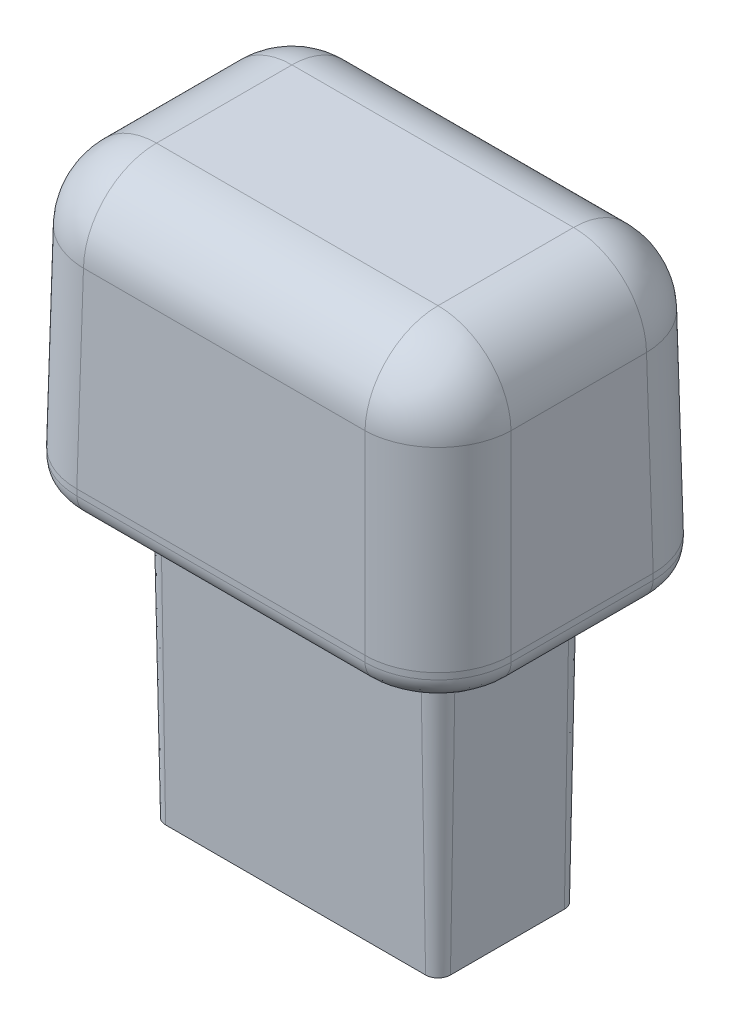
ISO-10303-21;
HEADER;
FILE_DESCRIPTION(('STEP AP214'),'2;1');
FILE_NAME('part.step','',(''),(''),'','','');
FILE_SCHEMA(('AUTOMOTIVE_DESIGN { 1 0 10303 214 1 1 1 1 }'));
ENDSEC;
DATA;
#1=APPLICATION_CONTEXT('core data for automotive mechanical design processes');
#2=APPLICATION_PROTOCOL_DEFINITION('international standard','automotive_design',2000,#1);
#3=PRODUCT_CONTEXT('',#1,'mechanical');
#4=PRODUCT('Part','Part','',(#3));
#5=PRODUCT_RELATED_PRODUCT_CATEGORY('part','',(#4));
#6=PRODUCT_DEFINITION_FORMATION('','',#4);
#7=PRODUCT_DEFINITION_CONTEXT('part definition',#1,'design');
#8=PRODUCT_DEFINITION('design','',#6,#7);
#9=PRODUCT_DEFINITION_SHAPE('','',#8);
#10=(LENGTH_UNIT() NAMED_UNIT(*) SI_UNIT(.MILLI.,.METRE.));
#11=(NAMED_UNIT(*) PLANE_ANGLE_UNIT() SI_UNIT($,.RADIAN.));
#12=(NAMED_UNIT(*) SI_UNIT($,.STERADIAN.) SOLID_ANGLE_UNIT());
#13=UNCERTAINTY_MEASURE_WITH_UNIT(LENGTH_MEASURE(1.E-05),#10,'distance_accuracy_value','');
#14=(GEOMETRIC_REPRESENTATION_CONTEXT(3) GLOBAL_UNCERTAINTY_ASSIGNED_CONTEXT((#13)) GLOBAL_UNIT_ASSIGNED_CONTEXT((#10,
#11,#12)) REPRESENTATION_CONTEXT('',''));
#15=CARTESIAN_POINT('',(0.,0.,0.));
#16=DIRECTION('',(0.,0.,1.));
#17=DIRECTION('',(1.,0.,0.));
#18=AXIS2_PLACEMENT_3D('',#15,#16,#17);
#19=CARTESIAN_POINT('',(18.923,0.,12.573));
#20=DIRECTION('',(0.999847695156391,0.0174524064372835,0.));
#21=DIRECTION('',(-0.0174524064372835,0.999847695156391,0.));
#22=AXIS2_PLACEMENT_3D('',#19,#20,#21);
#23=PLANE('',#22);
#24=DIRECTION('',(-0.0174497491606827,0.999695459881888,0.0174497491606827));
#25=VECTOR('',#24,1.);
#26=CARTESIAN_POINT('',(18.9172764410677,0.327902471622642,-6.21824357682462));
#27=LINE('',#26,#25);
#28=CARTESIAN_POINT('',(18.8786641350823,2.54,-6.17963127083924));
#29=VERTEX_POINT('',#28);
#30=CARTESIAN_POINT('',(18.5885465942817,19.1608227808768,-5.88951373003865));
#31=VERTEX_POINT('',#30);
#32=EDGE_CURVE('E331',#29,#31,#27,.T.);
#33=ORIENTED_EDGE('',*,*,#32,.T.);
#34=DIRECTION('',(0.,0.,-1.));
#35=VECTOR('',#34,1.);
#36=CARTESIAN_POINT('',(18.5885465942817,19.1608227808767,5.78060848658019));
#37=LINE('',#36,#35);
#38=CARTESIAN_POINT('',(18.5885465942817,19.1608227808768,5.88951373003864));
#39=VERTEX_POINT('',#38);
#40=EDGE_CURVE('E371',#31,#39,#37,.F.);
#41=ORIENTED_EDGE('',*,*,#40,.T.);
#42=DIRECTION('',(-0.0174497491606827,0.999695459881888,-0.0174497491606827));
#43=VECTOR('',#42,1.);
#44=CARTESIAN_POINT('',(18.9249332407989,-0.110755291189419,6.22590037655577));
#45=LINE('',#44,#43);
#46=CARTESIAN_POINT('',(18.8786641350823,2.54,6.17963127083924));
#47=VERTEX_POINT('',#46);
#48=EDGE_CURVE('E335',#39,#47,#45,.F.);
#49=ORIENTED_EDGE('',*,*,#48,.T.);
#50=DIRECTION('',(0.,0.,-1.));
#51=VECTOR('',#50,1.);
#52=CARTESIAN_POINT('',(18.8786641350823,2.54,12.573));
#53=LINE('',#52,#51);
#54=EDGE_CURVE('E295',#47,#29,#53,.T.);
#55=ORIENTED_EDGE('',*,*,#54,.T.);
#56=EDGE_LOOP('',(#33,#41,#49,#55));
#57=FACE_BOUND('',#56,.T.);
#58=ADVANCED_FACE('F44',(#57),#23,.T.);
#59=CARTESIAN_POINT('',(18.923,0.,-12.573));
#60=DIRECTION('',(0.,0.0174524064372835,-0.999847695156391));
#61=DIRECTION('',(0.,0.999847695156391,0.0174524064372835));
#62=AXIS2_PLACEMENT_3D('',#59,#60,#61);
#63=PLANE('',#62);
#64=DIRECTION('',(0.0174497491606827,0.999695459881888,0.0174497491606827));
#65=VECTOR('',#64,1.);
#66=CARTESIAN_POINT('',(-12.5643765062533,0.549446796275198,-12.5634093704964));
#67=LINE('',#66,#65);
#68=CARTESIAN_POINT('',(-12.5296312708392,2.54,-12.5286641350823));
#69=VERTEX_POINT('',#68);
#70=CARTESIAN_POINT('',(-12.2395137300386,19.1608227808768,-12.2385465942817));
#71=VERTEX_POINT('',#70);
#72=EDGE_CURVE('E315',#69,#71,#67,.T.);
#73=ORIENTED_EDGE('',*,*,#72,.T.);
#74=DIRECTION('',(-1.,0.,0.));
#75=VECTOR('',#74,1.);
#76=CARTESIAN_POINT('',(12.1306084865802,19.1608227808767,-12.2385465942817));
#77=LINE('',#76,#75);
#78=CARTESIAN_POINT('',(12.2395137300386,19.1608227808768,-12.2385465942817));
#79=VERTEX_POINT('',#78);
#80=EDGE_CURVE('E367',#71,#79,#77,.F.);
#81=ORIENTED_EDGE('',*,*,#80,.T.);
#82=DIRECTION('',(-0.0174497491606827,0.999695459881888,0.0174497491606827));
#83=VECTOR('',#82,1.);
#84=CARTESIAN_POINT('',(12.5759003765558,-0.110755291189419,-12.5749332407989));
#85=LINE('',#84,#83);
#86=CARTESIAN_POINT('',(12.5296312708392,2.54,-12.5286641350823));
#87=VERTEX_POINT('',#86);
#88=EDGE_CURVE('E313',#79,#87,#85,.F.);
#89=ORIENTED_EDGE('',*,*,#88,.T.);
#90=DIRECTION('',(-1.,0.,0.));
#91=VECTOR('',#90,1.);
#92=CARTESIAN_POINT('',(18.923,2.54,-12.5286641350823));
#93=LINE('',#92,#91);
#94=EDGE_CURVE('E292',#87,#69,#93,.T.);
#95=ORIENTED_EDGE('',*,*,#94,.T.);
#96=EDGE_LOOP('',(#73,#81,#89,#95));
#97=FACE_BOUND('',#96,.T.);
#98=ADVANCED_FACE('F624',(#97),#63,.T.);
#99=CARTESIAN_POINT('',(-18.923,0.,12.573));
#100=DIRECTION('',(-0.999847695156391,0.0174524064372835,0.));
#101=DIRECTION('',(-0.0174524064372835,-0.999847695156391,0.));
#102=AXIS2_PLACEMENT_3D('',#99,#100,#101);
#103=PLANE('',#102);
#104=DIRECTION('',(0.0174497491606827,0.999695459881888,-0.0174497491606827));
#105=VECTOR('',#104,1.);
#106=CARTESIAN_POINT('',(-18.9249332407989,-0.110755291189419,6.22590037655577));
#107=LINE('',#106,#105);
#108=CARTESIAN_POINT('',(-18.8786641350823,2.54,6.17963127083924));
#109=VERTEX_POINT('',#108);
#110=CARTESIAN_POINT('',(-18.5885465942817,19.1608227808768,5.88951373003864));
#111=VERTEX_POINT('',#110);
#112=EDGE_CURVE('E308',#109,#111,#107,.T.);
#113=ORIENTED_EDGE('',*,*,#112,.T.);
#114=DIRECTION('',(0.,0.,1.));
#115=VECTOR('',#114,1.);
#116=CARTESIAN_POINT('',(-18.5885465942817,19.1608227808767,-5.78060848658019));
#117=LINE('',#116,#115);
#118=CARTESIAN_POINT('',(-18.5885465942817,19.1608227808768,-5.88951373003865));
#119=VERTEX_POINT('',#118);
#120=EDGE_CURVE('E363',#111,#119,#117,.F.);
#121=ORIENTED_EDGE('',*,*,#120,.T.);
#122=DIRECTION('',(0.0174497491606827,0.999695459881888,0.0174497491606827));
#123=VECTOR('',#122,1.);
#124=CARTESIAN_POINT('',(-18.9172764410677,0.327902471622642,-6.21824357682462));
#125=LINE('',#124,#123);
#126=CARTESIAN_POINT('',(-18.8786641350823,2.54,-6.17963127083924));
#127=VERTEX_POINT('',#126);
#128=EDGE_CURVE('E311',#119,#127,#125,.F.);
#129=ORIENTED_EDGE('',*,*,#128,.T.);
#130=DIRECTION('',(0.,0.,1.));
#131=VECTOR('',#130,1.);
#132=CARTESIAN_POINT('',(-18.8786641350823,2.54,12.573));
#133=LINE('',#132,#131);
#134=EDGE_CURVE('E289',#127,#109,#133,.T.);
#135=ORIENTED_EDGE('',*,*,#134,.T.);
#136=EDGE_LOOP('',(#113,#121,#129,#135));
#137=FACE_BOUND('',#136,.T.);
#138=ADVANCED_FACE('F629',(#137),#103,.T.);
#139=CARTESIAN_POINT('',(18.923,0.,12.573));
#140=DIRECTION('',(0.,0.0174524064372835,0.999847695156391));
#141=DIRECTION('',(0.,-0.999847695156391,0.0174524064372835));
#142=AXIS2_PLACEMENT_3D('',#139,#140,#141);
#143=PLANE('',#142);
#144=DIRECTION('',(-0.0174497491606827,0.999695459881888,-0.0174497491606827));
#145=VECTOR('',#144,1.);
#146=CARTESIAN_POINT('',(12.5759003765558,-0.110755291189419,12.5749332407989));
#147=LINE('',#146,#145);
#148=CARTESIAN_POINT('',(12.5296312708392,2.54,12.5286641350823));
#149=VERTEX_POINT('',#148);
#150=CARTESIAN_POINT('',(12.2395137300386,19.1608227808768,12.2385465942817));
#151=VERTEX_POINT('',#150);
#152=EDGE_CURVE('E322',#149,#151,#147,.T.);
#153=ORIENTED_EDGE('',*,*,#152,.T.);
#154=DIRECTION('',(1.,0.,0.));
#155=VECTOR('',#154,1.);
#156=CARTESIAN_POINT('',(-12.1306084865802,19.1608227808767,12.2385465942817));
#157=LINE('',#156,#155);
#158=CARTESIAN_POINT('',(-12.2395137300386,19.1608227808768,12.2385465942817));
#159=VERTEX_POINT('',#158);
#160=EDGE_CURVE('E375',#151,#159,#157,.F.);
#161=ORIENTED_EDGE('',*,*,#160,.T.);
#162=DIRECTION('',(0.0174497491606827,0.999695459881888,-0.0174497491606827));
#163=VECTOR('',#162,1.);
#164=CARTESIAN_POINT('',(-12.5643765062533,0.549446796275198,12.5634093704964));
#165=LINE('',#164,#163);
#166=CARTESIAN_POINT('',(-12.5296312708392,2.54,12.5286641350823));
#167=VERTEX_POINT('',#166);
#168=EDGE_CURVE('E325',#159,#167,#165,.F.);
#169=ORIENTED_EDGE('',*,*,#168,.T.);
#170=DIRECTION('',(1.,0.,0.));
#171=VECTOR('',#170,1.);
#172=CARTESIAN_POINT('',(18.923,2.54,12.5286641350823));
#173=LINE('',#172,#171);
#174=EDGE_CURVE('E286',#167,#149,#173,.T.);
#175=ORIENTED_EDGE('',*,*,#174,.T.);
#176=EDGE_LOOP('',(#153,#161,#169,#175));
#177=FACE_BOUND('',#176,.T.);
#178=ADVANCED_FACE('F540',(#177),#143,.T.);
#179=CARTESIAN_POINT('',(0.,0.,0.));
#180=DIRECTION('',(0.,1.,0.));
#181=DIRECTION('',(0.,0.,1.));
#182=AXIS2_PLACEMENT_3D('',#179,#180,#181);
#183=PLANE('',#182);
#184=DIRECTION('',(-1.,0.,0.));
#185=VECTOR('',#184,1.);
#186=CARTESIAN_POINT('',(0.,0.,10.4874874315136));
#187=LINE('',#186,#185);
#188=CARTESIAN_POINT('',(12.5201450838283,0.,10.4874874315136));
#189=VERTEX_POINT('',#188);
#190=CARTESIAN_POINT('',(-12.5201450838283,0.,10.4874874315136));
#191=VERTEX_POINT('',#190);
#192=EDGE_CURVE('E377',#189,#191,#187,.T.);
#193=ORIENTED_EDGE('',*,*,#192,.T.);
#194=CARTESIAN_POINT('',(-12.51882967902,0.,6.16882967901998));
#195=DIRECTION('',(0.,1.,0.));
#196=DIRECTION('',(0.707106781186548,0.,-0.707106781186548));
#197=AXIS2_PLACEMENT_3D('',#194,#195,#196);
#198=ELLIPSE('',#197,4.31931540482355,4.318);
#199=CARTESIAN_POINT('',(-16.8374874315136,0.,6.17014508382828));
#200=VERTEX_POINT('',#199);
#201=EDGE_CURVE('E416',#191,#200,#198,.F.);
#202=ORIENTED_EDGE('',*,*,#201,.T.);
#203=DIRECTION('',(0.,0.,-1.));
#204=VECTOR('',#203,1.);
#205=CARTESIAN_POINT('',(-16.8374874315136,0.,0.));
#206=LINE('',#205,#204);
#207=CARTESIAN_POINT('',(-16.8374874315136,0.,-6.17014508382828));
#208=VERTEX_POINT('',#207);
#209=EDGE_CURVE('E413',#200,#208,#206,.T.);
#210=ORIENTED_EDGE('',*,*,#209,.T.);
#211=CARTESIAN_POINT('',(-12.51882967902,0.,-6.16882967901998));
#212=DIRECTION('',(0.,1.,0.));
#213=DIRECTION('',(0.707106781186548,0.,0.707106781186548));
#214=AXIS2_PLACEMENT_3D('',#211,#212,#213);
#215=ELLIPSE('',#214,4.31931540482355,4.318);
#216=CARTESIAN_POINT('',(-12.5201450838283,0.,-10.4874874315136));
#217=VERTEX_POINT('',#216);
#218=EDGE_CURVE('E410',#208,#217,#215,.F.);
#219=ORIENTED_EDGE('',*,*,#218,.T.);
#220=DIRECTION('',(1.,0.,0.));
#221=VECTOR('',#220,1.);
#222=CARTESIAN_POINT('',(0.,0.,-10.4874874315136));
#223=LINE('',#222,#221);
#224=CARTESIAN_POINT('',(12.5201450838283,0.,-10.4874874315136));
#225=VERTEX_POINT('',#224);
#226=EDGE_CURVE('E407',#217,#225,#223,.T.);
#227=ORIENTED_EDGE('',*,*,#226,.T.);
#228=CARTESIAN_POINT('',(12.51882967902,0.,-6.16882967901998));
#229=DIRECTION('',(0.,1.,0.));
#230=DIRECTION('',(-0.707106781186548,0.,0.707106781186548));
#231=AXIS2_PLACEMENT_3D('',#228,#229,#230);
#232=ELLIPSE('',#231,4.31931540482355,4.318);
#233=CARTESIAN_POINT('',(16.8374874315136,0.,-6.17014508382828));
#234=VERTEX_POINT('',#233);
#235=EDGE_CURVE('E405',#225,#234,#232,.F.);
#236=ORIENTED_EDGE('',*,*,#235,.T.);
#237=DIRECTION('',(0.,0.,1.));
#238=VECTOR('',#237,1.);
#239=CARTESIAN_POINT('',(16.8374874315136,0.,0.));
#240=LINE('',#239,#238);
#241=CARTESIAN_POINT('',(16.8374874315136,0.,6.17014508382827));
#242=VERTEX_POINT('',#241);
#243=EDGE_CURVE('E403',#234,#242,#240,.T.);
#244=ORIENTED_EDGE('',*,*,#243,.T.);
#245=CARTESIAN_POINT('',(12.51882967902,0.,6.16882967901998));
#246=DIRECTION('',(0.,1.,0.));
#247=DIRECTION('',(-0.707106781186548,0.,-0.707106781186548));
#248=AXIS2_PLACEMENT_3D('',#245,#246,#247);
#249=ELLIPSE('',#248,4.31931540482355,4.318);
#250=EDGE_CURVE('E401',#242,#189,#249,.F.);
#251=ORIENTED_EDGE('',*,*,#250,.T.);
#252=EDGE_LOOP('',(#193,#202,#210,#219,#227,#236,#244,#251));
#253=FACE_BOUND('',#252,.T.);
#254=CARTESIAN_POINT('',(-11.303,0.,4.953));
#255=DIRECTION('',(0.,-1.,0.));
#256=DIRECTION('',(0.,0.,1.));
#257=AXIS2_PLACEMENT_3D('',#254,#255,#256);
#258=CIRCLE('',#257,1.524);
#259=CARTESIAN_POINT('',(-11.303,0.,6.477));
#260=VERTEX_POINT('',#259);
#261=CARTESIAN_POINT('',(-12.827,0.,4.95299999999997));
#262=VERTEX_POINT('',#261);
#263=EDGE_CURVE('E222',#260,#262,#258,.T.);
#264=ORIENTED_EDGE('',*,*,#263,.F.);
#265=DIRECTION('',(-1.,0.,0.));
#266=VECTOR('',#265,1.);
#267=CARTESIAN_POINT('',(-11.303,0.,6.477));
#268=LINE('',#267,#266);
#269=CARTESIAN_POINT('',(11.303,0.,6.477));
#270=VERTEX_POINT('',#269);
#271=EDGE_CURVE('E225',#270,#260,#268,.T.);
#272=ORIENTED_EDGE('',*,*,#271,.F.);
#273=CARTESIAN_POINT('',(11.303,0.,4.953));
#274=DIRECTION('',(0.,-1.,0.));
#275=DIRECTION('',(0.,0.,1.));
#276=AXIS2_PLACEMENT_3D('',#273,#274,#275);
#277=CIRCLE('',#276,1.524);
#278=CARTESIAN_POINT('',(12.827,0.,4.95299999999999));
#279=VERTEX_POINT('',#278);
#280=EDGE_CURVE('E245',#279,#270,#277,.T.);
#281=ORIENTED_EDGE('',*,*,#280,.F.);
#282=DIRECTION('',(0.,0.,1.));
#283=VECTOR('',#282,1.);
#284=CARTESIAN_POINT('',(12.827,0.,4.95299999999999));
#285=LINE('',#284,#283);
#286=CARTESIAN_POINT('',(12.827,0.,-4.95299999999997));
#287=VERTEX_POINT('',#286);
#288=EDGE_CURVE('E580',#287,#279,#285,.T.);
#289=ORIENTED_EDGE('',*,*,#288,.F.);
#290=CARTESIAN_POINT('',(11.303,0.,-4.953));
#291=DIRECTION('',(0.,-1.,0.));
#292=DIRECTION('',(0.,0.,-1.));
#293=AXIS2_PLACEMENT_3D('',#290,#291,#292);
#294=CIRCLE('',#293,1.524);
#295=CARTESIAN_POINT('',(11.303,0.,-6.477));
#296=VERTEX_POINT('',#295);
#297=EDGE_CURVE('E582',#296,#287,#294,.T.);
#298=ORIENTED_EDGE('',*,*,#297,.F.);
#299=DIRECTION('',(1.,0.,0.));
#300=VECTOR('',#299,1.);
#301=CARTESIAN_POINT('',(-11.303,0.,-6.477));
#302=LINE('',#301,#300);
#303=CARTESIAN_POINT('',(-11.303,0.,-6.477));
#304=VERTEX_POINT('',#303);
#305=EDGE_CURVE('E577',#304,#296,#302,.T.);
#306=ORIENTED_EDGE('',*,*,#305,.F.);
#307=CARTESIAN_POINT('',(-11.303,0.,-4.953));
#308=DIRECTION('',(0.,-1.,0.));
#309=DIRECTION('',(0.,0.,-1.));
#310=AXIS2_PLACEMENT_3D('',#307,#308,#309);
#311=CIRCLE('',#310,1.524);
#312=CARTESIAN_POINT('',(-12.827,0.,-4.95299999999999));
#313=VERTEX_POINT('',#312);
#314=EDGE_CURVE('E573',#313,#304,#311,.T.);
#315=ORIENTED_EDGE('',*,*,#314,.F.);
#316=DIRECTION('',(0.,0.,-1.));
#317=VECTOR('',#316,1.);
#318=CARTESIAN_POINT('',(-12.827,0.,4.95299999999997));
#319=LINE('',#318,#317);
#320=EDGE_CURVE('E228',#262,#313,#319,.T.);
#321=ORIENTED_EDGE('',*,*,#320,.F.);
#322=EDGE_LOOP('',(#264,#272,#281,#289,#298,#306,#315,#321));
#323=FACE_BOUND('',#322,.T.);
#324=ADVANCED_FACE('F224',(#253,#323),#183,.F.);
#325=CARTESIAN_POINT('',(-18.8786641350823,2.54,12.573));
#326=DIRECTION('',(-0.999847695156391,-0.0174524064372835,0.));
#327=DIRECTION('',(0.0174524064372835,-0.999847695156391,0.));
#328=AXIS2_PLACEMENT_3D('',#325,#326,#327);
#329=PLANE('',#328);
#330=DIRECTION('',(-0.0174497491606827,0.999695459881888,-0.0174497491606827));
#331=VECTOR('',#330,1.);
#332=CARTESIAN_POINT('',(-18.8729540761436,2.21287094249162,-6.17392121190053));
#333=LINE('',#332,#331);
#334=CARTESIAN_POINT('',(-18.8691779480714,1.99653671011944,-6.17014508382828));
#335=VERTEX_POINT('',#334);
#336=EDGE_CURVE('E300',#127,#335,#333,.F.);
#337=ORIENTED_EDGE('',*,*,#336,.T.);
#338=DIRECTION('',(0.,0.,1.));
#339=VECTOR('',#338,1.);
#340=CARTESIAN_POINT('',(-18.8691779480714,1.99653671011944,12.573));
#341=LINE('',#340,#339);
#342=CARTESIAN_POINT('',(-18.8691779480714,1.99653671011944,6.17014508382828));
#343=VERTEX_POINT('',#342);
#344=EDGE_CURVE('E422',#335,#343,#341,.T.);
#345=ORIENTED_EDGE('',*,*,#344,.T.);
#346=DIRECTION('',(-0.0174497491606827,0.999695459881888,0.0174497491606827));
#347=VECTOR('',#346,1.);
#348=CARTESIAN_POINT('',(-18.8806108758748,2.65152870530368,6.18157801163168));
#349=LINE('',#348,#347);
#350=EDGE_CURVE('E298',#343,#109,#349,.T.);
#351=ORIENTED_EDGE('',*,*,#350,.T.);
#352=ORIENTED_EDGE('',*,*,#134,.F.);
#353=EDGE_LOOP('',(#337,#345,#351,#352));
#354=FACE_BOUND('',#353,.T.);
#355=ADVANCED_FACE('F640',(#354),#329,.T.);
#356=CARTESIAN_POINT('',(18.923,2.54,12.5286641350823));
#357=DIRECTION('',(0.,-0.0174524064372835,0.999847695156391));
#358=DIRECTION('',(0.,-0.999847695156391,-0.0174524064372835));
#359=AXIS2_PLACEMENT_3D('',#356,#357,#358);
#360=PLANE('',#359);
#361=DIRECTION('',(-0.0174497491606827,0.999695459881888,0.0174497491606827));
#362=VECTOR('',#361,1.);
#363=CARTESIAN_POINT('',(-12.5200541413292,1.99132661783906,12.5190870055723));
#364=LINE('',#363,#362);
#365=CARTESIAN_POINT('',(-12.5201450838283,1.99653671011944,12.5191779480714));
#366=VERTEX_POINT('',#365);
#367=EDGE_CURVE('E320',#167,#366,#364,.F.);
#368=ORIENTED_EDGE('',*,*,#367,.T.);
#369=DIRECTION('',(1.,0.,0.));
#370=VECTOR('',#369,1.);
#371=CARTESIAN_POINT('',(18.923,1.99653671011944,12.5191779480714));
#372=LINE('',#371,#370);
#373=CARTESIAN_POINT('',(12.5201450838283,1.99653671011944,12.5191779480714));
#374=VERTEX_POINT('',#373);
#375=EDGE_CURVE('E12',#366,#374,#372,.T.);
#376=ORIENTED_EDGE('',*,*,#375,.T.);
#377=DIRECTION('',(0.0174497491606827,0.999695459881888,0.0174497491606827));
#378=VECTOR('',#377,1.);
#379=CARTESIAN_POINT('',(12.5315780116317,2.65152870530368,12.5306108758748));
#380=LINE('',#379,#378);
#381=EDGE_CURVE('E318',#374,#149,#380,.T.);
#382=ORIENTED_EDGE('',*,*,#381,.T.);
#383=ORIENTED_EDGE('',*,*,#174,.F.);
#384=EDGE_LOOP('',(#368,#376,#382,#383));
#385=FACE_BOUND('',#384,.T.);
#386=ADVANCED_FACE('F544',(#385),#360,.T.);
#387=CARTESIAN_POINT('',(18.8786641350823,2.54,12.573));
#388=DIRECTION('',(0.999847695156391,-0.0174524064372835,0.));
#389=DIRECTION('',(0.0174524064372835,0.999847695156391,0.));
#390=AXIS2_PLACEMENT_3D('',#387,#388,#389);
#391=PLANE('',#390);
#392=DIRECTION('',(0.0174497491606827,0.999695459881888,0.0174497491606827));
#393=VECTOR('',#392,1.);
#394=CARTESIAN_POINT('',(18.8806108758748,2.65152870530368,6.18157801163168));
#395=LINE('',#394,#393);
#396=CARTESIAN_POINT('',(18.8691779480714,1.99653671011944,6.17014508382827));
#397=VERTEX_POINT('',#396);
#398=EDGE_CURVE('E329',#47,#397,#395,.F.);
#399=ORIENTED_EDGE('',*,*,#398,.T.);
#400=DIRECTION('',(0.,0.,-1.));
#401=VECTOR('',#400,1.);
#402=CARTESIAN_POINT('',(18.8691779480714,1.99653671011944,12.573));
#403=LINE('',#402,#401);
#404=CARTESIAN_POINT('',(18.8691779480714,1.99653671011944,-6.17014508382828));
#405=VERTEX_POINT('',#404);
#406=EDGE_CURVE('E430',#397,#405,#403,.T.);
#407=ORIENTED_EDGE('',*,*,#406,.T.);
#408=DIRECTION('',(0.0174497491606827,0.999695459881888,-0.0174497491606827));
#409=VECTOR('',#408,1.);
#410=CARTESIAN_POINT('',(18.8729540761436,2.21287094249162,-6.17392121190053));
#411=LINE('',#410,#409);
#412=EDGE_CURVE('E327',#405,#29,#411,.T.);
#413=ORIENTED_EDGE('',*,*,#412,.T.);
#414=ORIENTED_EDGE('',*,*,#54,.F.);
#415=EDGE_LOOP('',(#399,#407,#413,#414));
#416=FACE_BOUND('',#415,.T.);
#417=ADVANCED_FACE('F634',(#416),#391,.T.);
#418=CARTESIAN_POINT('',(18.923,2.54,-12.5286641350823));
#419=DIRECTION('',(0.,-0.0174524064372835,-0.999847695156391));
#420=DIRECTION('',(0.,0.999847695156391,-0.0174524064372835));
#421=AXIS2_PLACEMENT_3D('',#418,#419,#420);
#422=PLANE('',#421);
#423=DIRECTION('',(0.0174497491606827,0.999695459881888,-0.0174497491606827));
#424=VECTOR('',#423,1.);
#425=CARTESIAN_POINT('',(12.5315780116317,2.65152870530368,-12.5306108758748));
#426=LINE('',#425,#424);
#427=CARTESIAN_POINT('',(12.5201450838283,1.99653671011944,-12.5191779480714));
#428=VERTEX_POINT('',#427);
#429=EDGE_CURVE('E303',#87,#428,#426,.F.);
#430=ORIENTED_EDGE('',*,*,#429,.T.);
#431=DIRECTION('',(-1.,0.,0.));
#432=VECTOR('',#431,1.);
#433=CARTESIAN_POINT('',(18.923,1.99653671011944,-12.5191779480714));
#434=LINE('',#433,#432);
#435=CARTESIAN_POINT('',(-12.5201450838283,1.99653671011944,-12.5191779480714));
#436=VERTEX_POINT('',#435);
#437=EDGE_CURVE('E426',#428,#436,#434,.T.);
#438=ORIENTED_EDGE('',*,*,#437,.T.);
#439=DIRECTION('',(-0.0174497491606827,0.999695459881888,-0.0174497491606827));
#440=VECTOR('',#439,1.);
#441=CARTESIAN_POINT('',(-12.5200541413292,1.99132661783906,-12.5190870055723));
#442=LINE('',#441,#440);
#443=EDGE_CURVE('E306',#436,#69,#442,.T.);
#444=ORIENTED_EDGE('',*,*,#443,.T.);
#445=ORIENTED_EDGE('',*,*,#94,.F.);
#446=EDGE_LOOP('',(#430,#438,#444,#445));
#447=FACE_BOUND('',#446,.T.);
#448=ADVANCED_FACE('F510',(#447),#422,.T.);
#449=CARTESIAN_POINT('',(0.,25.4,0.));
#450=DIRECTION('',(0.,1.,0.));
#451=DIRECTION('',(0.,0.,1.));
#452=AXIS2_PLACEMENT_3D('',#449,#450,#451);
#453=PLANE('',#452);
#454=DIRECTION('',(1.,0.,0.));
#455=VECTOR('',#454,1.);
#456=CARTESIAN_POINT('',(-12.1306084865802,25.4,-5.88951373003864));
#457=LINE('',#456,#455);
#458=CARTESIAN_POINT('',(12.2395137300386,25.4,-5.88951373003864));
#459=VERTEX_POINT('',#458);
#460=CARTESIAN_POINT('',(-12.2395137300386,25.4,-5.88951373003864));
#461=VERTEX_POINT('',#460);
#462=EDGE_CURVE('E358',#459,#461,#457,.F.);
#463=ORIENTED_EDGE('',*,*,#462,.T.);
#464=DIRECTION('',(0.,0.,-1.));
#465=VECTOR('',#464,1.);
#466=CARTESIAN_POINT('',(-12.2395137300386,25.4,5.78060848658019));
#467=LINE('',#466,#465);
#468=CARTESIAN_POINT('',(-12.2395137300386,25.4,5.88951373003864));
#469=VERTEX_POINT('',#468);
#470=EDGE_CURVE('E360',#461,#469,#467,.F.);
#471=ORIENTED_EDGE('',*,*,#470,.T.);
#472=DIRECTION('',(-1.,0.,0.));
#473=VECTOR('',#472,1.);
#474=CARTESIAN_POINT('',(12.1306084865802,25.4,5.88951373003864));
#475=LINE('',#474,#473);
#476=CARTESIAN_POINT('',(12.2395137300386,25.4,5.88951373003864));
#477=VERTEX_POINT('',#476);
#478=EDGE_CURVE('E354',#469,#477,#475,.F.);
#479=ORIENTED_EDGE('',*,*,#478,.T.);
#480=DIRECTION('',(0.,0.,1.));
#481=VECTOR('',#480,1.);
#482=CARTESIAN_POINT('',(12.2395137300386,25.4,-5.78060848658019));
#483=LINE('',#482,#481);
#484=EDGE_CURVE('E356',#477,#459,#483,.F.);
#485=ORIENTED_EDGE('',*,*,#484,.T.);
#486=EDGE_LOOP('',(#463,#471,#479,#485));
#487=FACE_BOUND('',#486,.T.);
#488=ADVANCED_FACE('F621',(#487),#453,.T.);
#489=CARTESIAN_POINT('',(-11.303,0.,4.953));
#490=DIRECTION('',(0.,1.,0.));
#491=DIRECTION('',(0.,0.,1.));
#492=AXIS2_PLACEMENT_3D('',#489,#490,#491);
#493=CONICAL_SURFACE('',#492,1.524,0.0174532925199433);
#494=ORIENTED_EDGE('',*,*,#263,.T.);
#495=DIRECTION('',(-0.0174524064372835,0.999847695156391,0.));
#496=VECTOR('',#495,1.);
#497=CARTESIAN_POINT('',(-12.827,0.,4.95299999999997));
#498=LINE('',#497,#496);
#499=CARTESIAN_POINT('',(-12.3836413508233,-25.4,4.95299999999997));
#500=VERTEX_POINT('',#499);
#501=EDGE_CURVE('E256',#500,#262,#498,.T.);
#502=ORIENTED_EDGE('',*,*,#501,.F.);
#503=CARTESIAN_POINT('',(-11.303,-25.4,4.953));
#504=DIRECTION('',(0.,1.,0.));
#505=DIRECTION('',(0.,0.,1.));
#506=AXIS2_PLACEMENT_3D('',#503,#504,#505);
#507=CIRCLE('',#506,1.08064135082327);
#508=CARTESIAN_POINT('',(-11.303,-25.4,6.03364135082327));
#509=VERTEX_POINT('',#508);
#510=EDGE_CURVE('E244',#509,#500,#507,.F.);
#511=ORIENTED_EDGE('',*,*,#510,.F.);
#512=DIRECTION('',(0.,0.999847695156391,0.0174524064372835));
#513=VECTOR('',#512,1.);
#514=CARTESIAN_POINT('',(-11.303,0.,6.477));
#515=LINE('',#514,#513);
#516=EDGE_CURVE('E240',#509,#260,#515,.T.);
#517=ORIENTED_EDGE('',*,*,#516,.T.);
#518=EDGE_LOOP('',(#494,#502,#511,#517));
#519=FACE_BOUND('',#518,.T.);
#520=ADVANCED_FACE('F247',(#519),#493,.T.);
#521=CARTESIAN_POINT('',(-12.827,0.,4.95299999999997));
#522=DIRECTION('',(-0.999847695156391,-0.0174524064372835,0.));
#523=DIRECTION('',(0.0174524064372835,-0.999847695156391,0.));
#524=AXIS2_PLACEMENT_3D('',#521,#522,#523);
#525=PLANE('',#524);
#526=ORIENTED_EDGE('',*,*,#320,.T.);
#527=DIRECTION('',(-0.0174524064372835,0.999847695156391,0.));
#528=VECTOR('',#527,1.);
#529=CARTESIAN_POINT('',(-12.827,0.,-4.95299999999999));
#530=LINE('',#529,#528);
#531=CARTESIAN_POINT('',(-12.3836413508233,-25.4,-4.95299999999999));
#532=VERTEX_POINT('',#531);
#533=EDGE_CURVE('E270',#532,#313,#530,.T.);
#534=ORIENTED_EDGE('',*,*,#533,.F.);
#535=DIRECTION('',(0.,0.,1.));
#536=VECTOR('',#535,1.);
#537=CARTESIAN_POINT('',(-12.3836413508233,-25.4,4.953));
#538=LINE('',#537,#536);
#539=EDGE_CURVE('E275',#500,#532,#538,.F.);
#540=ORIENTED_EDGE('',*,*,#539,.F.);
#541=ORIENTED_EDGE('',*,*,#501,.T.);
#542=EDGE_LOOP('',(#526,#534,#540,#541));
#543=FACE_BOUND('',#542,.T.);
#544=ADVANCED_FACE('F613',(#543),#525,.T.);
#545=CARTESIAN_POINT('',(-11.303,0.,-4.953));
#546=DIRECTION('',(0.,1.,0.));
#547=DIRECTION('',(0.,0.,-1.));
#548=AXIS2_PLACEMENT_3D('',#545,#546,#547);
#549=CONICAL_SURFACE('',#548,1.524,0.0174532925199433);
#550=ORIENTED_EDGE('',*,*,#314,.T.);
#551=DIRECTION('',(0.,0.999847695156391,-0.0174524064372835));
#552=VECTOR('',#551,1.);
#553=CARTESIAN_POINT('',(-11.303,0.,-6.477));
#554=LINE('',#553,#552);
#555=CARTESIAN_POINT('',(-11.303,-25.4,-6.03364135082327));
#556=VERTEX_POINT('',#555);
#557=EDGE_CURVE('E266',#556,#304,#554,.T.);
#558=ORIENTED_EDGE('',*,*,#557,.F.);
#559=CARTESIAN_POINT('',(-11.303,-25.4,-4.953));
#560=DIRECTION('',(0.,1.,0.));
#561=DIRECTION('',(0.,0.,1.));
#562=AXIS2_PLACEMENT_3D('',#559,#560,#561);
#563=CIRCLE('',#562,1.08064135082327);
#564=EDGE_CURVE('E277',#532,#556,#563,.F.);
#565=ORIENTED_EDGE('',*,*,#564,.F.);
#566=ORIENTED_EDGE('',*,*,#533,.T.);
#567=EDGE_LOOP('',(#550,#558,#565,#566));
#568=FACE_BOUND('',#567,.T.);
#569=ADVANCED_FACE('F605',(#568),#549,.T.);
#570=CARTESIAN_POINT('',(-11.303,0.,-6.477));
#571=DIRECTION('',(0.,-0.0174524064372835,-0.999847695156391));
#572=DIRECTION('',(0.,0.999847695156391,-0.0174524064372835));
#573=AXIS2_PLACEMENT_3D('',#570,#571,#572);
#574=PLANE('',#573);
#575=ORIENTED_EDGE('',*,*,#305,.T.);
#576=DIRECTION('',(0.,0.999847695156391,-0.0174524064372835));
#577=VECTOR('',#576,1.);
#578=CARTESIAN_POINT('',(11.303,0.,-6.477));
#579=LINE('',#578,#577);
#580=CARTESIAN_POINT('',(11.303,-25.4,-6.03364135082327));
#581=VERTEX_POINT('',#580);
#582=EDGE_CURVE('E263',#581,#296,#579,.T.);
#583=ORIENTED_EDGE('',*,*,#582,.F.);
#584=DIRECTION('',(-1.,0.,0.));
#585=VECTOR('',#584,1.);
#586=CARTESIAN_POINT('',(-11.303,-25.4,-6.03364135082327));
#587=LINE('',#586,#585);
#588=EDGE_CURVE('E279',#556,#581,#587,.F.);
#589=ORIENTED_EDGE('',*,*,#588,.F.);
#590=ORIENTED_EDGE('',*,*,#557,.T.);
#591=EDGE_LOOP('',(#575,#583,#589,#590));
#592=FACE_BOUND('',#591,.T.);
#593=ADVANCED_FACE('F609',(#592),#574,.T.);
#594=CARTESIAN_POINT('',(11.303,0.,-4.953));
#595=DIRECTION('',(0.,1.,0.));
#596=DIRECTION('',(0.,0.,-1.));
#597=AXIS2_PLACEMENT_3D('',#594,#595,#596);
#598=CONICAL_SURFACE('',#597,1.524,0.0174532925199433);
#599=ORIENTED_EDGE('',*,*,#297,.T.);
#600=DIRECTION('',(0.0174524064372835,0.999847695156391,0.));
#601=VECTOR('',#600,1.);
#602=CARTESIAN_POINT('',(12.827,0.,-4.95299999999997));
#603=LINE('',#602,#601);
#604=CARTESIAN_POINT('',(12.3836413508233,-25.4,-4.95299999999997));
#605=VERTEX_POINT('',#604);
#606=EDGE_CURVE('E260',#605,#287,#603,.T.);
#607=ORIENTED_EDGE('',*,*,#606,.F.);
#608=CARTESIAN_POINT('',(11.303,-25.4,-4.953));
#609=DIRECTION('',(0.,1.,0.));
#610=DIRECTION('',(0.,0.,1.));
#611=AXIS2_PLACEMENT_3D('',#608,#609,#610);
#612=CIRCLE('',#611,1.08064135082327);
#613=EDGE_CURVE('E281',#581,#605,#612,.F.);
#614=ORIENTED_EDGE('',*,*,#613,.F.);
#615=ORIENTED_EDGE('',*,*,#582,.T.);
#616=EDGE_LOOP('',(#599,#607,#614,#615));
#617=FACE_BOUND('',#616,.T.);
#618=ADVANCED_FACE('F602',(#617),#598,.T.);
#619=CARTESIAN_POINT('',(12.827,0.,4.95299999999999));
#620=DIRECTION('',(0.999847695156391,-0.0174524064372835,0.));
#621=DIRECTION('',(0.0174524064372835,0.999847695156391,0.));
#622=AXIS2_PLACEMENT_3D('',#619,#620,#621);
#623=PLANE('',#622);
#624=ORIENTED_EDGE('',*,*,#288,.T.);
#625=DIRECTION('',(0.0174524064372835,0.999847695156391,0.));
#626=VECTOR('',#625,1.);
#627=CARTESIAN_POINT('',(12.827,0.,4.95299999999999));
#628=LINE('',#627,#626);
#629=CARTESIAN_POINT('',(12.3836413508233,-25.4,4.95299999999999));
#630=VERTEX_POINT('',#629);
#631=EDGE_CURVE('E251',#630,#279,#628,.T.);
#632=ORIENTED_EDGE('',*,*,#631,.F.);
#633=DIRECTION('',(0.,0.,-1.));
#634=VECTOR('',#633,1.);
#635=CARTESIAN_POINT('',(12.3836413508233,-25.4,4.953));
#636=LINE('',#635,#634);
#637=EDGE_CURVE('E283',#605,#630,#636,.F.);
#638=ORIENTED_EDGE('',*,*,#637,.F.);
#639=ORIENTED_EDGE('',*,*,#606,.T.);
#640=EDGE_LOOP('',(#624,#632,#638,#639));
#641=FACE_BOUND('',#640,.T.);
#642=ADVANCED_FACE('F597',(#641),#623,.T.);
#643=CARTESIAN_POINT('',(11.303,0.,4.953));
#644=DIRECTION('',(0.,1.,0.));
#645=DIRECTION('',(0.,0.,1.));
#646=AXIS2_PLACEMENT_3D('',#643,#644,#645);
#647=CONICAL_SURFACE('',#646,1.524,0.0174532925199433);
#648=ORIENTED_EDGE('',*,*,#280,.T.);
#649=DIRECTION('',(0.,0.999847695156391,0.0174524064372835));
#650=VECTOR('',#649,1.);
#651=CARTESIAN_POINT('',(11.303,0.,6.477));
#652=LINE('',#651,#650);
#653=CARTESIAN_POINT('',(11.303,-25.4,6.03364135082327));
#654=VERTEX_POINT('',#653);
#655=EDGE_CURVE('E243',#654,#270,#652,.T.);
#656=ORIENTED_EDGE('',*,*,#655,.F.);
#657=CARTESIAN_POINT('',(11.303,-25.4,4.953));
#658=DIRECTION('',(0.,1.,0.));
#659=DIRECTION('',(0.,0.,1.));
#660=AXIS2_PLACEMENT_3D('',#657,#658,#659);
#661=CIRCLE('',#660,1.08064135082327);
#662=EDGE_CURVE('E253',#630,#654,#661,.F.);
#663=ORIENTED_EDGE('',*,*,#662,.F.);
#664=ORIENTED_EDGE('',*,*,#631,.T.);
#665=EDGE_LOOP('',(#648,#656,#663,#664));
#666=FACE_BOUND('',#665,.T.);
#667=ADVANCED_FACE('F593',(#666),#647,.T.);
#668=CARTESIAN_POINT('',(-11.303,0.,6.477));
#669=DIRECTION('',(0.,-0.0174524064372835,0.999847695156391));
#670=DIRECTION('',(0.,-0.999847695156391,-0.0174524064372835));
#671=AXIS2_PLACEMENT_3D('',#668,#669,#670);
#672=PLANE('',#671);
#673=ORIENTED_EDGE('',*,*,#271,.T.);
#674=ORIENTED_EDGE('',*,*,#516,.F.);
#675=DIRECTION('',(1.,0.,0.));
#676=VECTOR('',#675,1.);
#677=CARTESIAN_POINT('',(-11.303,-25.4,6.03364135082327));
#678=LINE('',#677,#676);
#679=EDGE_CURVE('E249',#654,#509,#678,.F.);
#680=ORIENTED_EDGE('',*,*,#679,.F.);
#681=ORIENTED_EDGE('',*,*,#655,.T.);
#682=EDGE_LOOP('',(#673,#674,#680,#681));
#683=FACE_BOUND('',#682,.T.);
#684=ADVANCED_FACE('F238',(#683),#672,.T.);
#685=CARTESIAN_POINT('',(-11.303,-25.4,4.953));
#686=DIRECTION('',(0.,1.,0.));
#687=DIRECTION('',(0.,0.,1.));
#688=AXIS2_PLACEMENT_3D('',#685,#686,#687);
#689=PLANE('',#688);
#690=ORIENTED_EDGE('',*,*,#510,.T.);
#691=ORIENTED_EDGE('',*,*,#539,.T.);
#692=ORIENTED_EDGE('',*,*,#564,.T.);
#693=ORIENTED_EDGE('',*,*,#588,.T.);
#694=ORIENTED_EDGE('',*,*,#613,.T.);
#695=ORIENTED_EDGE('',*,*,#637,.T.);
#696=ORIENTED_EDGE('',*,*,#662,.T.);
#697=ORIENTED_EDGE('',*,*,#679,.T.);
#698=EDGE_LOOP('',(#690,#691,#692,#693,#694,#695,#696,#697));
#699=FACE_BOUND('',#698,.T.);
#700=ADVANCED_FACE('F611',(#699),#689,.F.);
#701=CARTESIAN_POINT('',(-12.5682435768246,0.217079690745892,-6.21824357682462));
#702=DIRECTION('',(-0.0174497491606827,-0.999695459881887,-0.0174497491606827));
#703=DIRECTION('',(0.,0.0174524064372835,-0.999847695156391));
#704=AXIS2_PLACEMENT_3D('',#701,#702,#703);
#705=CYLINDRICAL_SURFACE('',#704,6.35);
#706=ORIENTED_EDGE('',*,*,#128,.F.);
#707=CARTESIAN_POINT('',(-12.2395137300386,19.05,-5.88951373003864));
#708=DIRECTION('',(-0.0174497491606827,-0.999695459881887,-0.0174497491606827));
#709=DIRECTION('',(0.,0.0174524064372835,-0.999847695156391));
#710=AXIS2_PLACEMENT_3D('',#707,#708,#709);
#711=CIRCLE('',#710,6.35);
#712=EDGE_CURVE('E365',#119,#71,#711,.T.);
#713=ORIENTED_EDGE('',*,*,#712,.T.);
#714=ORIENTED_EDGE('',*,*,#72,.F.);
#715=CARTESIAN_POINT('',(-12.5276968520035,2.54000000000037,-6.17769685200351));
#716=DIRECTION('',(0.,-1.,0.));
#717=DIRECTION('',(-0.707106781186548,0.,-0.707106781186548));
#718=AXIS2_PLACEMENT_3D('',#715,#716,#717);
#719=ELLIPSE('',#718,6.35193441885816,6.35);
#720=EDGE_CURVE('E233',#127,#69,#719,.T.);
#721=ORIENTED_EDGE('',*,*,#720,.F.);
#722=EDGE_LOOP('',(#706,#713,#714,#721));
#723=FACE_BOUND('',#722,.T.);
#724=ADVANCED_FACE('F464',(#723),#705,.T.);
#725=CARTESIAN_POINT('',(-12.5239212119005,2.32369372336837,-6.17392121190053));
#726=DIRECTION('',(0.0174497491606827,-0.999695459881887,0.0174497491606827));
#727=DIRECTION('',(0.,-0.0174524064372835,-0.999847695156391));
#728=AXIS2_PLACEMENT_3D('',#725,#726,#727);
#729=CYLINDRICAL_SURFACE('',#728,6.35);
#730=ORIENTED_EDGE('',*,*,#443,.F.);
#731=CARTESIAN_POINT('',(-12.51882967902,2.032,-6.16882967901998));
#732=DIRECTION('',(0.00558313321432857,-0.999968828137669,0.00558313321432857));
#733=DIRECTION('',(0.707084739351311,0.00789574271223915,0.707084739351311));
#734=AXIS2_PLACEMENT_3D('',#731,#732,#733);
#735=ELLIPSE('',#734,6.35089454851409,6.35);
#736=EDGE_CURVE('E424',#436,#335,#735,.F.);
#737=ORIENTED_EDGE('',*,*,#736,.T.);
#738=ORIENTED_EDGE('',*,*,#336,.F.);
#739=ORIENTED_EDGE('',*,*,#720,.T.);
#740=EDGE_LOOP('',(#730,#737,#738,#739));
#741=FACE_BOUND('',#740,.T.);
#742=ADVANCED_FACE('F468',(#741),#729,.T.);
#743=CARTESIAN_POINT('',(-12.5643765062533,0.438624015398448,6.21437650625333));
#744=DIRECTION('',(-0.0174497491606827,-0.999695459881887,0.0174497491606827));
#745=DIRECTION('',(0.,-0.0174524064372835,-0.999847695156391));
#746=AXIS2_PLACEMENT_3D('',#743,#744,#745);
#747=CYLINDRICAL_SURFACE('',#746,6.35);
#748=ORIENTED_EDGE('',*,*,#168,.F.);
#749=CARTESIAN_POINT('',(-12.2395137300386,19.05,5.88951373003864));
#750=DIRECTION('',(-0.0174497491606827,-0.999695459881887,0.0174497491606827));
#751=DIRECTION('',(0.,-0.0174524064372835,-0.999847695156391));
#752=AXIS2_PLACEMENT_3D('',#749,#750,#751);
#753=CIRCLE('',#752,6.35);
#754=EDGE_CURVE('E338',#159,#111,#753,.T.);
#755=ORIENTED_EDGE('',*,*,#754,.T.);
#756=ORIENTED_EDGE('',*,*,#112,.F.);
#757=CARTESIAN_POINT('',(-12.5276968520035,2.5400000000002,6.17769685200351));
#758=DIRECTION('',(0.,-1.,0.));
#759=DIRECTION('',(-0.707106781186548,0.,0.707106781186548));
#760=AXIS2_PLACEMENT_3D('',#757,#758,#759);
#761=ELLIPSE('',#760,6.35193441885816,6.35);
#762=EDGE_CURVE('E341',#167,#109,#761,.T.);
#763=ORIENTED_EDGE('',*,*,#762,.F.);
#764=EDGE_LOOP('',(#748,#755,#756,#763));
#765=FACE_BOUND('',#764,.T.);
#766=ADVANCED_FACE('F462',(#765),#747,.T.);
#767=CARTESIAN_POINT('',(-12.5200541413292,2.10214939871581,6.17005414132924));
#768=DIRECTION('',(0.0174497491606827,-0.999695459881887,-0.0174497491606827));
#769=DIRECTION('',(0.,0.0174524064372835,-0.999847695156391));
#770=AXIS2_PLACEMENT_3D('',#767,#768,#769);
#771=CYLINDRICAL_SURFACE('',#770,6.35);
#772=ORIENTED_EDGE('',*,*,#350,.F.);
#773=CARTESIAN_POINT('',(-12.51882967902,2.032,6.16882967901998));
#774=DIRECTION('',(0.00558313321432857,-0.999968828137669,-0.00558313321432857));
#775=DIRECTION('',(0.707084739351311,0.00789574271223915,-0.707084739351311));
#776=AXIS2_PLACEMENT_3D('',#773,#774,#775);
#777=ELLIPSE('',#776,6.35089454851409,6.35);
#778=EDGE_CURVE('E419',#343,#366,#777,.F.);
#779=ORIENTED_EDGE('',*,*,#778,.T.);
#780=ORIENTED_EDGE('',*,*,#367,.F.);
#781=ORIENTED_EDGE('',*,*,#762,.T.);
#782=EDGE_LOOP('',(#772,#779,#780,#781));
#783=FACE_BOUND('',#782,.T.);
#784=ADVANCED_FACE('F456',(#783),#771,.T.);
#785=CARTESIAN_POINT('',(12.5759003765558,-0.221578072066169,6.22590037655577));
#786=DIRECTION('',(0.0174497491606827,-0.999695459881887,0.0174497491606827));
#787=DIRECTION('',(0.,-0.0174524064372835,-0.999847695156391));
#788=AXIS2_PLACEMENT_3D('',#785,#786,#787);
#789=CYLINDRICAL_SURFACE('',#788,6.35);
#790=ORIENTED_EDGE('',*,*,#48,.F.);
#791=CARTESIAN_POINT('',(12.2395137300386,19.05,5.88951373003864));
#792=DIRECTION('',(0.0174497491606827,-0.999695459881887,0.0174497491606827));
#793=DIRECTION('',(0.,-0.0174524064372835,-0.999847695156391));
#794=AXIS2_PLACEMENT_3D('',#791,#792,#793);
#795=CIRCLE('',#794,6.35);
#796=EDGE_CURVE('E373',#39,#151,#795,.T.);
#797=ORIENTED_EDGE('',*,*,#796,.T.);
#798=ORIENTED_EDGE('',*,*,#152,.F.);
#799=CARTESIAN_POINT('',(12.5276968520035,2.54000000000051,6.17769685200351));
#800=DIRECTION('',(0.,-1.,0.));
#801=DIRECTION('',(0.707106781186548,0.,0.707106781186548));
#802=AXIS2_PLACEMENT_3D('',#799,#800,#801);
#803=ELLIPSE('',#802,6.35193441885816,6.35);
#804=EDGE_CURVE('E344',#47,#149,#803,.T.);
#805=ORIENTED_EDGE('',*,*,#804,.F.);
#806=EDGE_LOOP('',(#790,#797,#798,#805));
#807=FACE_BOUND('',#806,.T.);
#808=ADVANCED_FACE('F461',(#807),#789,.T.);
#809=CARTESIAN_POINT('',(12.5315780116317,2.76235148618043,6.18157801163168));
#810=DIRECTION('',(-0.0174497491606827,-0.999695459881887,-0.0174497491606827));
#811=DIRECTION('',(0.,0.0174524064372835,-0.999847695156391));
#812=AXIS2_PLACEMENT_3D('',#809,#810,#811);
#813=CYLINDRICAL_SURFACE('',#812,6.35);
#814=ORIENTED_EDGE('',*,*,#381,.F.);
#815=CARTESIAN_POINT('',(12.51882967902,2.032,6.16882967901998));
#816=DIRECTION('',(-0.00558313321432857,-0.999968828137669,-0.00558313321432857));
#817=DIRECTION('',(-0.707084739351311,0.00789574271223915,-0.707084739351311));
#818=AXIS2_PLACEMENT_3D('',#815,#816,#817);
#819=ELLIPSE('',#818,6.35089454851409,6.35);
#820=EDGE_CURVE('E55',#374,#397,#819,.F.);
#821=ORIENTED_EDGE('',*,*,#820,.T.);
#822=ORIENTED_EDGE('',*,*,#398,.F.);
#823=ORIENTED_EDGE('',*,*,#804,.T.);
#824=EDGE_LOOP('',(#814,#821,#822,#823));
#825=FACE_BOUND('',#824,.T.);
#826=ADVANCED_FACE('F470',(#825),#813,.T.);
#827=CARTESIAN_POINT('',(12.5759003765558,-0.221578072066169,-6.22590037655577));
#828=DIRECTION('',(0.0174497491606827,-0.999695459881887,-0.0174497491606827));
#829=DIRECTION('',(0.,0.0174524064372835,-0.999847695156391));
#830=AXIS2_PLACEMENT_3D('',#827,#828,#829);
#831=CYLINDRICAL_SURFACE('',#830,6.35);
#832=ORIENTED_EDGE('',*,*,#88,.F.);
#833=CARTESIAN_POINT('',(12.2395137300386,19.05,-5.88951373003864));
#834=DIRECTION('',(0.0174497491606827,-0.999695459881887,-0.0174497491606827));
#835=DIRECTION('',(0.,0.0174524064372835,-0.999847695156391));
#836=AXIS2_PLACEMENT_3D('',#833,#834,#835);
#837=CIRCLE('',#836,6.35);
#838=EDGE_CURVE('E369',#79,#31,#837,.T.);
#839=ORIENTED_EDGE('',*,*,#838,.T.);
#840=ORIENTED_EDGE('',*,*,#32,.F.);
#841=CARTESIAN_POINT('',(12.5276968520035,2.54000000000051,-6.17769685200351));
#842=DIRECTION('',(0.,-1.,0.));
#843=DIRECTION('',(0.707106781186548,0.,-0.707106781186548));
#844=AXIS2_PLACEMENT_3D('',#841,#842,#843);
#845=ELLIPSE('',#844,6.35193441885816,6.35);
#846=EDGE_CURVE('E348',#87,#29,#845,.T.);
#847=ORIENTED_EDGE('',*,*,#846,.F.);
#848=EDGE_LOOP('',(#832,#839,#840,#847));
#849=FACE_BOUND('',#848,.T.);
#850=ADVANCED_FACE('F474',(#849),#831,.T.);
#851=CARTESIAN_POINT('',(12.5315780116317,2.76235148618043,-6.18157801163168));
#852=DIRECTION('',(-0.0174497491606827,-0.999695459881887,0.0174497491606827));
#853=DIRECTION('',(0.,-0.0174524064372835,-0.999847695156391));
#854=AXIS2_PLACEMENT_3D('',#851,#852,#853);
#855=CYLINDRICAL_SURFACE('',#854,6.35);
#856=ORIENTED_EDGE('',*,*,#412,.F.);
#857=CARTESIAN_POINT('',(12.51882967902,2.032,-6.16882967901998));
#858=DIRECTION('',(-0.00558313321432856,-0.999968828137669,0.00558313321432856));
#859=DIRECTION('',(-0.707084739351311,0.00789574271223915,0.707084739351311));
#860=AXIS2_PLACEMENT_3D('',#857,#858,#859);
#861=ELLIPSE('',#860,6.3508945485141,6.35);
#862=EDGE_CURVE('E428',#405,#428,#861,.F.);
#863=ORIENTED_EDGE('',*,*,#862,.T.);
#864=ORIENTED_EDGE('',*,*,#429,.F.);
#865=ORIENTED_EDGE('',*,*,#846,.T.);
#866=EDGE_LOOP('',(#856,#863,#864,#865));
#867=FACE_BOUND('',#866,.T.);
#868=ADVANCED_FACE('F507',(#867),#855,.T.);
#869=CARTESIAN_POINT('',(12.2395137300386,19.05,-5.88951373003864));
#870=DIRECTION('',(0.,0.,1.));
#871=DIRECTION('',(1.,0.,0.));
#872=AXIS2_PLACEMENT_3D('',#869,#870,#871);
#873=SPHERICAL_SURFACE('',#872,6.35);
#874=CARTESIAN_POINT('',(12.2395137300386,19.05,-5.88951373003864));
#875=DIRECTION('',(0.,0.,1.));
#876=DIRECTION('',(1.,0.,0.));
#877=AXIS2_PLACEMENT_3D('',#874,#875,#876);
#878=CIRCLE('',#877,6.35);
#879=EDGE_CURVE('E395',#31,#459,#878,.T.);
#880=ORIENTED_EDGE('',*,*,#879,.F.);
#881=ORIENTED_EDGE('',*,*,#838,.F.);
#882=CARTESIAN_POINT('',(12.2395137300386,19.05,-5.88951373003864));
#883=DIRECTION('',(-1.,0.,0.));
#884=DIRECTION('',(0.,0.,1.));
#885=AXIS2_PLACEMENT_3D('',#882,#883,#884);
#886=CIRCLE('',#885,6.35);
#887=EDGE_CURVE('E351',#459,#79,#886,.T.);
#888=ORIENTED_EDGE('',*,*,#887,.F.);
#889=EDGE_LOOP('',(#880,#881,#888));
#890=FACE_BOUND('',#889,.T.);
#891=ADVANCED_FACE('F450',(#890),#873,.T.);
#892=CARTESIAN_POINT('',(0.,19.05,-5.88951373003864));
#893=DIRECTION('',(-1.,0.,0.));
#894=DIRECTION('',(0.,0.,1.));
#895=AXIS2_PLACEMENT_3D('',#892,#893,#894);
#896=CYLINDRICAL_SURFACE('',#895,6.35);
#897=ORIENTED_EDGE('',*,*,#887,.T.);
#898=ORIENTED_EDGE('',*,*,#80,.F.);
#899=CARTESIAN_POINT('',(-12.2395137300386,19.05,-5.88951373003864));
#900=DIRECTION('',(-1.,0.,0.));
#901=DIRECTION('',(0.,0.,1.));
#902=AXIS2_PLACEMENT_3D('',#899,#900,#901);
#903=CIRCLE('',#902,6.35);
#904=EDGE_CURVE('E392',#461,#71,#903,.T.);
#905=ORIENTED_EDGE('',*,*,#904,.F.);
#906=ORIENTED_EDGE('',*,*,#462,.F.);
#907=EDGE_LOOP('',(#897,#898,#905,#906));
#908=FACE_BOUND('',#907,.T.);
#909=ADVANCED_FACE('F775',(#908),#896,.T.);
#910=CARTESIAN_POINT('',(12.2395137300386,19.05,0.));
#911=DIRECTION('',(0.,0.,-1.));
#912=DIRECTION('',(-1.,0.,0.));
#913=AXIS2_PLACEMENT_3D('',#910,#911,#912);
#914=CYLINDRICAL_SURFACE('',#913,6.35);
#915=ORIENTED_EDGE('',*,*,#879,.T.);
#916=ORIENTED_EDGE('',*,*,#484,.F.);
#917=CARTESIAN_POINT('',(12.2395137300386,19.05,5.88951373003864));
#918=DIRECTION('',(0.,0.,1.));
#919=DIRECTION('',(1.,0.,0.));
#920=AXIS2_PLACEMENT_3D('',#917,#918,#919);
#921=CIRCLE('',#920,6.35);
#922=EDGE_CURVE('E389',#39,#477,#921,.T.);
#923=ORIENTED_EDGE('',*,*,#922,.F.);
#924=ORIENTED_EDGE('',*,*,#40,.F.);
#925=EDGE_LOOP('',(#915,#916,#923,#924));
#926=FACE_BOUND('',#925,.T.);
#927=ADVANCED_FACE('F530',(#926),#914,.T.);
#928=CARTESIAN_POINT('',(-12.2395137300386,19.05,-5.88951373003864));
#929=DIRECTION('',(0.,0.,1.));
#930=DIRECTION('',(1.,0.,0.));
#931=AXIS2_PLACEMENT_3D('',#928,#929,#930);
#932=SPHERICAL_SURFACE('',#931,6.35);
#933=ORIENTED_EDGE('',*,*,#904,.T.);
#934=ORIENTED_EDGE('',*,*,#712,.F.);
#935=CARTESIAN_POINT('',(-12.2395137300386,19.05,-5.88951373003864));
#936=DIRECTION('',(0.,0.,1.));
#937=DIRECTION('',(1.,0.,0.));
#938=AXIS2_PLACEMENT_3D('',#935,#936,#937);
#939=CIRCLE('',#938,6.35);
#940=EDGE_CURVE('E386',#461,#119,#939,.T.);
#941=ORIENTED_EDGE('',*,*,#940,.F.);
#942=EDGE_LOOP('',(#933,#934,#941));
#943=FACE_BOUND('',#942,.T.);
#944=ADVANCED_FACE('F756',(#943),#932,.T.);
#945=CARTESIAN_POINT('',(12.2395137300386,19.05,5.88951373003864));
#946=DIRECTION('',(0.,0.,1.));
#947=DIRECTION('',(1.,0.,0.));
#948=AXIS2_PLACEMENT_3D('',#945,#946,#947);
#949=SPHERICAL_SURFACE('',#948,6.35);
#950=ORIENTED_EDGE('',*,*,#796,.F.);
#951=ORIENTED_EDGE('',*,*,#922,.T.);
#952=CARTESIAN_POINT('',(12.2395137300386,19.05,5.88951373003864));
#953=DIRECTION('',(-1.,0.,0.));
#954=DIRECTION('',(0.,-1.,0.));
#955=AXIS2_PLACEMENT_3D('',#952,#953,#954);
#956=CIRCLE('',#955,6.35);
#957=EDGE_CURVE('E383',#151,#477,#956,.T.);
#958=ORIENTED_EDGE('',*,*,#957,.F.);
#959=EDGE_LOOP('',(#950,#951,#958));
#960=FACE_BOUND('',#959,.T.);
#961=ADVANCED_FACE('F534',(#960),#949,.T.);
#962=CARTESIAN_POINT('',(-12.2395137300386,19.05,0.));
#963=DIRECTION('',(0.,0.,1.));
#964=DIRECTION('',(1.,0.,0.));
#965=AXIS2_PLACEMENT_3D('',#962,#963,#964);
#966=CYLINDRICAL_SURFACE('',#965,6.35);
#967=ORIENTED_EDGE('',*,*,#940,.T.);
#968=ORIENTED_EDGE('',*,*,#120,.F.);
#969=CARTESIAN_POINT('',(-12.2395137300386,19.05,5.88951373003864));
#970=DIRECTION('',(0.,0.,1.));
#971=DIRECTION('',(1.,0.,0.));
#972=AXIS2_PLACEMENT_3D('',#969,#970,#971);
#973=CIRCLE('',#972,6.35);
#974=EDGE_CURVE('E380',#469,#111,#973,.T.);
#975=ORIENTED_EDGE('',*,*,#974,.F.);
#976=ORIENTED_EDGE('',*,*,#470,.F.);
#977=EDGE_LOOP('',(#967,#968,#975,#976));
#978=FACE_BOUND('',#977,.T.);
#979=ADVANCED_FACE('F739',(#978),#966,.T.);
#980=CARTESIAN_POINT('',(0.,19.05,5.88951373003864));
#981=DIRECTION('',(1.,0.,0.));
#982=DIRECTION('',(0.,0.,-1.));
#983=AXIS2_PLACEMENT_3D('',#980,#981,#982);
#984=CYLINDRICAL_SURFACE('',#983,6.35);
#985=ORIENTED_EDGE('',*,*,#957,.T.);
#986=ORIENTED_EDGE('',*,*,#478,.F.);
#987=CARTESIAN_POINT('',(-12.2395137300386,19.05,5.88951373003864));
#988=DIRECTION('',(-1.,0.,0.));
#989=DIRECTION('',(0.,-1.,0.));
#990=AXIS2_PLACEMENT_3D('',#987,#988,#989);
#991=CIRCLE('',#990,6.35);
#992=EDGE_CURVE('E378',#159,#469,#991,.T.);
#993=ORIENTED_EDGE('',*,*,#992,.F.);
#994=ORIENTED_EDGE('',*,*,#160,.F.);
#995=EDGE_LOOP('',(#985,#986,#993,#994));
#996=FACE_BOUND('',#995,.T.);
#997=ADVANCED_FACE('F727',(#996),#984,.T.);
#998=CARTESIAN_POINT('',(-12.2395137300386,19.05,5.88951373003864));
#999=DIRECTION('',(0.,0.,1.));
#1000=DIRECTION('',(1.,0.,0.));
#1001=AXIS2_PLACEMENT_3D('',#998,#999,#1000);
#1002=SPHERICAL_SURFACE('',#1001,6.35);
#1003=ORIENTED_EDGE('',*,*,#974,.T.);
#1004=ORIENTED_EDGE('',*,*,#754,.F.);
#1005=ORIENTED_EDGE('',*,*,#992,.T.);
#1006=EDGE_LOOP('',(#1003,#1004,#1005));
#1007=FACE_BOUND('',#1006,.T.);
#1008=ADVANCED_FACE('F717',(#1007),#1002,.T.);
#1009=CARTESIAN_POINT('',(9.46461246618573,0.,-3.11461246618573));
#1010=CARTESIAN_POINT('',(7.99186508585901,0.,-1.641865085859));
#1011=CARTESIAN_POINT('',(8.02820906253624,2.08214502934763,-1.67820906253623));
#1012=CARTESIAN_POINT('',(9.59783725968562,0.,-2.98138767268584));
#1013=CARTESIAN_POINT('',(8.18937020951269,0.,-1.44435996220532));
#1014=CARTESIAN_POINT('',(8.22412787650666,2.08214502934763,-1.48229024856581));
#1015=CARTESIAN_POINT('',(9.73979677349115,0.,-2.8568975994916));
#1016=CARTESIAN_POINT('',(8.39991327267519,0.,-1.25992136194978));
#1017=CARTESIAN_POINT('',(8.43288936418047,2.08200162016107,-1.29921410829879));
#1018=CARTESIAN_POINT('',(10.0387560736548,0.,-2.62751678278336));
#1019=CARTESIAN_POINT('',(8.84344282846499,0.,-0.92035516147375));
#1020=CARTESIAN_POINT('',(8.87252542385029,2.08143044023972,-0.961879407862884));
#1021=CARTESIAN_POINT('',(10.1957560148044,0.,-2.52262624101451));
#1022=CARTESIAN_POINT('',(9.07639451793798,0.,-0.765247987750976));
#1023=CARTESIAN_POINT('',(9.1034002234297,2.08100266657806,-0.807621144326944));
#1024=CARTESIAN_POINT('',(10.5221097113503,0.,-2.33423898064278));
#1025=CARTESIAN_POINT('',(9.56065048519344,0.,-0.487051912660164));
#1026=CARTESIAN_POINT('',(9.58331236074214,2.07987007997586,-0.530561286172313));
#1027=CARTESIAN_POINT('',(10.6914637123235,0.,-2.25074268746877));
#1028=CARTESIAN_POINT('',(9.81191611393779,0.,-0.363973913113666));
#1029=CARTESIAN_POINT('',(9.83235005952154,2.07916526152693,-0.407760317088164));
#1030=CARTESIAN_POINT('',(11.039627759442,0.,-2.10657234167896));
#1031=CARTESIAN_POINT('',(10.3283855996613,0.,-0.15196570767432));
#1032=CARTESIAN_POINT('',(10.3443267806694,2.07749064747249,-0.195715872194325));
#1033=CARTESIAN_POINT('',(11.2184380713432,0.,-2.04589893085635));
#1034=CARTESIAN_POINT('',(10.59354960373,0.,-0.0630361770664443));
#1035=CARTESIAN_POINT('',(10.6072661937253,2.07652084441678,-0.106473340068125));
#1036=CARTESIAN_POINT('',(11.5824552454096,0.,-1.9484122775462));
#1037=CARTESIAN_POINT('',(11.133161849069,0.,0.0791610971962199));
#1038=CARTESIAN_POINT('',(11.1425473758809,2.07433285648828,0.036927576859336));
#1039=CARTESIAN_POINT('',(11.7676623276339,0.,-1.91159985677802));
#1040=CARTESIAN_POINT('',(11.4075717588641,0.,0.132438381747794));
#1041=CARTESIAN_POINT('',(11.4148894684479,2.07311466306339,0.0910847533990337));
#1042=CARTESIAN_POINT('',(12.1413041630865,0.,-1.86246488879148));
#1043=CARTESIAN_POINT('',(11.9608701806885,0.,0.202457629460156));
#1044=CARTESIAN_POINT('',(11.9643162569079,2.0704507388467,0.163388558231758));
#1045=CARTESIAN_POINT('',(12.329739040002,0.,-1.8501432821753));
#1046=CARTESIAN_POINT('',(12.2397245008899,0.,0.219218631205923));
#1047=CARTESIAN_POINT('',(12.2414011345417,2.069004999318,0.181533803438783));
#1048=CARTESIAN_POINT('',(12.7066124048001,0.,-1.85020067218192));
#1049=CARTESIAN_POINT('',(12.7970444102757,0.,0.215984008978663));
#1050=CARTESIAN_POINT('',(12.7955726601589,2.06591071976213,0.181503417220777));
#1051=CARTESIAN_POINT('',(12.8950508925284,0.,-1.86258065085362));
#1052=CARTESIAN_POINT('',(13.0754822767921,0.,0.19601554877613));
#1053=CARTESIAN_POINT('',(13.0726593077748,2.06426217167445,0.16332634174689));
#1054=CARTESIAN_POINT('',(13.2687073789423,0.,-1.91182937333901));
#1055=CARTESIAN_POINT('',(13.627130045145,0.,0.119751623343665));
#1056=CARTESIAN_POINT('',(13.6220935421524,2.0607904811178,0.090962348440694));
#1057=CARTESIAN_POINT('',(13.4539252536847,0.,-1.94869905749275));
#1058=CARTESIAN_POINT('',(13.900320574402,0.,0.0634895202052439));
#1059=CARTESIAN_POINT('',(13.8944409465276,2.05896733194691,0.0367740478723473));
#1060=CARTESIAN_POINT('',(13.8179715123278,0.,-2.04629641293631));
#1061=CARTESIAN_POINT('',(14.436750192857,0.,-0.084295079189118));
#1062=CARTESIAN_POINT('',(14.4297369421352,2.0551776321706,-0.106685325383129));
#1063=CARTESIAN_POINT('',(13.9967996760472,0.,-2.10702490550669));
#1064=CARTESIAN_POINT('',(14.6999795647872,0.,-0.175780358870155));
#1065=CARTESIAN_POINT('',(14.6926852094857,2.05321107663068,-0.195957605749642));
#1066=CARTESIAN_POINT('',(14.3450068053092,0.,-2.25130094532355));
#1067=CARTESIAN_POINT('',(15.2119628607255,0.,-0.392333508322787));
#1068=CARTESIAN_POINT('',(15.2046839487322,2.04916821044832,-0.408057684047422));
#1069=CARTESIAN_POINT('',(14.5143855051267,0.,-2.33484913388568));
#1070=CARTESIAN_POINT('',(15.4607173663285,0.,-0.517362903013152));
#1071=CARTESIAN_POINT('',(15.4537340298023,2.04709189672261,-0.53088642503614));
#1072=CARTESIAN_POINT('',(14.8407956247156,0.,-2.52333523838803));
#1073=CARTESIAN_POINT('',(15.9395045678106,0.,-0.798751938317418));
#1074=CARTESIAN_POINT('',(15.933675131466,2.04286503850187,-0.807998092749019));
#1075=CARTESIAN_POINT('',(14.9978267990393,0.,-2.6282735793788));
#1076=CARTESIAN_POINT('',(16.1695480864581,0.,-0.95507451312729));
#1077=CARTESIAN_POINT('',(16.1645657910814,2.04071449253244,-0.962281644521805));
#1078=CARTESIAN_POINT('',(15.2968549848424,0.,-2.85774469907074));
#1079=CARTESIAN_POINT('',(16.6070159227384,0.,-1.29626931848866));
#1080=CARTESIAN_POINT('',(16.6042373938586,2.03637596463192,-1.29966344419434));
#1081=CARTESIAN_POINT('',(15.4388518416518,0.,-2.98227767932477));
#1082=CARTESIAN_POINT('',(16.8144605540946,0.,-1.48110844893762));
#1083=CARTESIAN_POINT('',(16.8130181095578,2.03418798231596,-1.48276198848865));
#1084=CARTESIAN_POINT('',(15.7053816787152,0.,-3.24880751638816));
#1085=CARTESIAN_POINT('',(17.2032456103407,0.,-1.87608214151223));
#1086=CARTESIAN_POINT('',(17.2048973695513,2.02981201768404,-1.87464124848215));
#1087=CARTESIAN_POINT('',(15.8299146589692,0.,-3.39080437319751));
#1088=CARTESIAN_POINT('',(17.3846144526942,0.,-2.08618984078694));
#1089=CARTESIAN_POINT('',(17.3879959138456,2.02762403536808,-2.08342196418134));
#1090=CARTESIAN_POINT('',(16.0593857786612,0.,-3.68983255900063));
#1091=CARTESIAN_POINT('',(17.718230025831,0.,-2.5280343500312));
#1092=CARTESIAN_POINT('',(17.7253777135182,2.02328550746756,-2.52309356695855));
#1093=CARTESIAN_POINT('',(16.1643241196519,0.,-3.84686373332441));
#1094=CARTESIAN_POINT('',(17.8705113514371,0.,-2.75975236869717));
#1095=CARTESIAN_POINT('',(17.8796612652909,2.02113496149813,-2.753984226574));
#1096=CARTESIAN_POINT('',(16.3528102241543,0.,-4.17327385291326));
#1097=CARTESIAN_POINT('',(18.1434465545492,0.,-3.24080615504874));
#1098=CARTESIAN_POINT('',(18.1567729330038,2.01690810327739,-3.23392532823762));
#1099=CARTESIAN_POINT('',(16.4363584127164,0.,-4.34265255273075));
#1100=CARTESIAN_POINT('',(18.2641388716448,0.,-3.4901324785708));
#1101=CARTESIAN_POINT('',(18.2796016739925,2.01483178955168,-3.48297540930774));
#1102=CARTESIAN_POINT('',(16.5806344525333,0.,-4.69085968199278));
#1103=CARTESIAN_POINT('',(18.4719391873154,0.,-4.00211766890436));
#1104=CARTESIAN_POINT('',(18.4917017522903,2.01078892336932,-3.99497414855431));
#1105=CARTESIAN_POINT('',(16.6413629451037,0.,-4.86968784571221));
#1106=CARTESIAN_POINT('',(18.5590868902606,0.,-4.26477707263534));
#1107=CARTESIAN_POINT('',(18.5809740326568,2.0088223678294,-4.25792241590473));
#1108=CARTESIAN_POINT('',(16.7389603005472,0.,-5.23373410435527));
#1109=CARTESIAN_POINT('',(18.6984157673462,0.,-4.79894338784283));
#1110=CARTESIAN_POINT('',(18.7244334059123,2.00503266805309,-4.79321841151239));
#1111=CARTESIAN_POINT('',(16.775829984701,0.,-5.41895197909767));
#1112=CARTESIAN_POINT('',(18.7506352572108,0.,-5.07046077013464));
#1113=CARTESIAN_POINT('',(18.7786217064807,2.0032095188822,-5.06556581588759));
#1114=CARTESIAN_POINT('',(16.8250787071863,0.,-5.79260846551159));
#1115=CARTESIAN_POINT('',(18.819316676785,0.,-5.61773376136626));
#1116=CARTESIAN_POINT('',(18.8509856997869,1.99973782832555,-5.61500005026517));
#1117=CARTESIAN_POINT('',(16.837458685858,0.,-5.98104695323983));
#1118=CARTESIAN_POINT('',(18.8358129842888,0.,-5.8935090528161));
#1119=CARTESIAN_POINT('',(18.8691627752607,1.99808928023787,-5.89208669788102));
#1120=CARTESIAN_POINT('',(16.8375160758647,0.,-6.35792031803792));
#1121=CARTESIAN_POINT('',(18.8328551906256,0.,-6.44464032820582));
#1122=CARTESIAN_POINT('',(18.8691931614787,1.994995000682,-6.44625822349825));
#1123=CARTESIAN_POINT('',(16.8251944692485,0.,-6.54635519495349));
#1124=CARTESIAN_POINT('',(18.8134292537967,0.,-6.72002386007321));
#1125=CARTESIAN_POINT('',(18.8510479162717,1.9935492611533,-6.72334310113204));
#1126=CARTESIAN_POINT('',(16.7760595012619,0.,-6.91999703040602));
#1127=CARTESIAN_POINT('',(18.739030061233,0.,-7.26574115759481));
#1128=CARTESIAN_POINT('',(18.778744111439,1.99088533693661,-7.27276988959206));
#1129=CARTESIAN_POINT('',(16.7392470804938,0.,-7.10520411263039));
#1130=CARTESIAN_POINT('',(18.6840769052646,0.,-7.53610845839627));
#1131=CARTESIAN_POINT('',(18.7245869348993,1.98966714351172,-7.54511198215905));
#1132=CARTESIAN_POINT('',(16.6417604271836,0.,-7.46922128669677));
#1133=CARTESIAN_POINT('',(18.5396111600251,0.,-8.06726359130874));
#1134=CARTESIAN_POINT('',(18.5811860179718,1.98747915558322,-8.08039316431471));
#1135=CARTESIAN_POINT('',(16.581087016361,0.,-7.64803159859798));
#1136=CARTESIAN_POINT('',(18.4501093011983,0.,-8.32808866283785));
#1137=CARTESIAN_POINT('',(18.4919434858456,1.98650935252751,-8.3433325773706));
#1138=CARTESIAN_POINT('',(16.4369166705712,0.,-7.99619564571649));
#1139=CARTESIAN_POINT('',(18.2380992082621,0.,-8.83580152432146));
#1140=CARTESIAN_POINT('',(18.2798990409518,1.98483473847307,-8.85530929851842));
#1141=CARTESIAN_POINT('',(16.3534203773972,0.,-8.1655496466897));
#1142=CARTESIAN_POINT('',(18.1155916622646,0.,-9.08272772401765));
#1143=CARTESIAN_POINT('',(18.1570980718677,1.98412992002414,-9.10434699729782));
#1144=CARTESIAN_POINT('',(16.1650331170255,0.,-8.49190334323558));
#1145=CARTESIAN_POINT('',(17.8396607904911,0.,-9.55852468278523));
#1146=CARTESIAN_POINT('',(17.880038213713,1.98299733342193,-9.58425913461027));
#1147=CARTESIAN_POINT('',(16.0601425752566,0.,-8.64890328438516));
#1148=CARTESIAN_POINT('',(17.6862281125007,0.,-9.78743240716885));
#1149=CARTESIAN_POINT('',(17.7257799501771,1.98256955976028,-9.81513393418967));
#1150=CARTESIAN_POINT('',(15.8307617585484,0.,-8.94786258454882));
#1151=CARTESIAN_POINT('',(17.35103997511,0.,-10.2233775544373));
#1152=CARTESIAN_POINT('',(17.3884452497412,1.98199837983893,-10.2547699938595));
#1153=CARTESIAN_POINT('',(15.7062716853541,0.,-9.08982209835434));
#1154=CARTESIAN_POINT('',(17.1692657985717,0.,-10.4304479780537));
#1155=CARTESIAN_POINT('',(17.2053691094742,1.98185497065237,-10.4635314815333));
#1156=CARTESIAN_POINT('',(15.4398220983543,0.,-9.35627168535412));
#1157=CARTESIAN_POINT('',(16.7804479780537,0.,-10.8192657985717));
#1158=CARTESIAN_POINT('',(16.8135314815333,1.98185497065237,-10.8553691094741));
#1159=CARTESIAN_POINT('',(15.2978625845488,0.,-9.48076175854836));
#1160=CARTESIAN_POINT('',(16.5733775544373,0.,-11.00103997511));
#1161=CARTESIAN_POINT('',(16.6047699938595,1.98199837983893,-11.0384452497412));
#1162=CARTESIAN_POINT('',(14.9989032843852,0.,-9.7101425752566));
#1163=CARTESIAN_POINT('',(16.1374324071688,0.,-11.3362281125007));
#1164=CARTESIAN_POINT('',(16.1651339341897,1.98256955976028,-11.3757799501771));
#1165=CARTESIAN_POINT('',(14.8419033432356,0.,-9.81503311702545));
#1166=CARTESIAN_POINT('',(15.9085246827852,0.,-11.4896607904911));
#1167=CARTESIAN_POINT('',(15.9342591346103,1.98299733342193,-11.530038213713));
#1168=CARTESIAN_POINT('',(14.5155496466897,0.,-10.0034203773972));
#1169=CARTESIAN_POINT('',(15.4327277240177,0.,-11.7655916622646));
#1170=CARTESIAN_POINT('',(15.4543469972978,1.98412992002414,-11.8070980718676));
#1171=CARTESIAN_POINT('',(14.3461956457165,0.,-10.0869166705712));
#1172=CARTESIAN_POINT('',(15.1858015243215,0.,-11.8880992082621));
#1173=CARTESIAN_POINT('',(15.2053092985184,1.98483473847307,-11.9298990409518));
#1174=CARTESIAN_POINT('',(13.998031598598,0.,-10.231087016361));
#1175=CARTESIAN_POINT('',(14.6780886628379,0.,-12.1001093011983));
#1176=CARTESIAN_POINT('',(14.6933325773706,1.98650935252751,-12.1419434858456));
#1177=CARTESIAN_POINT('',(13.8192212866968,0.,-10.2917604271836));
#1178=CARTESIAN_POINT('',(14.4172635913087,0.,-12.1896111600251));
#1179=CARTESIAN_POINT('',(14.4303931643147,1.98747915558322,-12.2311860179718));
#1180=CARTESIAN_POINT('',(13.4552041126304,0.,-10.3892470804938));
#1181=CARTESIAN_POINT('',(13.8861084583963,0.,-12.3340769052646));
#1182=CARTESIAN_POINT('',(13.8951119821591,1.98966714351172,-12.3745869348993));
#1183=CARTESIAN_POINT('',(13.269997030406,0.,-10.4260595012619));
#1184=CARTESIAN_POINT('',(13.6157411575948,0.,-12.389030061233));
#1185=CARTESIAN_POINT('',(13.6227698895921,1.99088533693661,-12.428744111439));
#1186=CARTESIAN_POINT('',(12.8963551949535,0.,-10.4751944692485));
#1187=CARTESIAN_POINT('',(13.0700238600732,0.,-12.4634292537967));
#1188=CARTESIAN_POINT('',(13.073343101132,1.9935492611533,-12.5010479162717));
#1189=CARTESIAN_POINT('',(12.7079203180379,0.,-10.4875160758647));
#1190=CARTESIAN_POINT('',(12.7946403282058,0.,-12.4828551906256));
#1191=CARTESIAN_POINT('',(12.7962582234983,1.994995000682,-12.5191931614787));
#1192=CARTESIAN_POINT('',(12.3310469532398,0.,-10.487458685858));
#1193=CARTESIAN_POINT('',(12.2435090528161,0.,-12.4858129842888));
#1194=CARTESIAN_POINT('',(12.242086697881,1.99808928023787,-12.5191627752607));
#1195=CARTESIAN_POINT('',(12.1426084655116,0.,-10.4750787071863));
#1196=CARTESIAN_POINT('',(11.9677337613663,0.,-12.469316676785));
#1197=CARTESIAN_POINT('',(11.9650000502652,1.99973782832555,-12.5009856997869));
#1198=CARTESIAN_POINT('',(11.7689519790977,0.,-10.425829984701));
#1199=CARTESIAN_POINT('',(11.4204607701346,0.,-12.4006352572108));
#1200=CARTESIAN_POINT('',(11.4155658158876,2.0032095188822,-12.4286217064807));
#1201=CARTESIAN_POINT('',(11.5837341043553,0.,-10.3889603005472));
#1202=CARTESIAN_POINT('',(11.1489433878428,0.,-12.3484157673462));
#1203=CARTESIAN_POINT('',(11.1432184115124,2.00503266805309,-12.3744334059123));
#1204=CARTESIAN_POINT('',(11.2196878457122,0.,-10.2913629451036));
#1205=CARTESIAN_POINT('',(10.6147770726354,0.,-12.2090868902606));
#1206=CARTESIAN_POINT('',(10.6079224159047,2.0088223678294,-12.2309740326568));
#1207=CARTESIAN_POINT('',(11.0408596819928,0.,-10.2306344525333));
#1208=CARTESIAN_POINT('',(10.3521176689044,0.,-12.1219391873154));
#1209=CARTESIAN_POINT('',(10.3449741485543,2.01078892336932,-12.1417017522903));
#1210=CARTESIAN_POINT('',(10.6926525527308,0.,-10.0863584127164));
#1211=CARTESIAN_POINT('',(9.8401324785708,0.,-11.9141388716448));
#1212=CARTESIAN_POINT('',(9.83297540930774,2.01483178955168,-11.9296016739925));
#1213=CARTESIAN_POINT('',(10.5232738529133,0.,-10.0028102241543));
#1214=CARTESIAN_POINT('',(9.59080615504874,0.,-11.7934465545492));
#1215=CARTESIAN_POINT('',(9.58392532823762,2.01690810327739,-11.8067729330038));
#1216=CARTESIAN_POINT('',(10.1968637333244,0.,-9.81432411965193));
#1217=CARTESIAN_POINT('',(9.10975236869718,0.,-11.5205113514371));
#1218=CARTESIAN_POINT('',(9.103984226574,2.02113496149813,-11.5296612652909));
#1219=CARTESIAN_POINT('',(10.0398325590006,0.,-9.70938577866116));
#1220=CARTESIAN_POINT('',(8.8780343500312,0.,-11.368230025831));
#1221=CARTESIAN_POINT('',(8.87309356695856,2.02328550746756,-11.3753777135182));
#1222=CARTESIAN_POINT('',(9.74080437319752,0.,-9.47991465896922));
#1223=CARTESIAN_POINT('',(8.43618984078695,0.,-11.0346144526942));
#1224=CARTESIAN_POINT('',(8.43342196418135,2.02762403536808,-11.0379959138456));
#1225=CARTESIAN_POINT('',(9.59880751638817,0.,-9.35538167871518));
#1226=CARTESIAN_POINT('',(8.22608214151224,0.,-10.8532456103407));
#1227=CARTESIAN_POINT('',(8.22464124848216,2.02981201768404,-10.8548973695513));
#1228=CARTESIAN_POINT('',(9.33227767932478,0.,-9.0888518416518));
#1229=CARTESIAN_POINT('',(7.83110844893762,0.,-10.4644605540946));
#1230=CARTESIAN_POINT('',(7.83276198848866,2.03418798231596,-10.4630181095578));
#1231=CARTESIAN_POINT('',(9.20774469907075,0.,-8.94685498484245));
#1232=CARTESIAN_POINT('',(7.64626931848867,0.,-10.2570159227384));
#1233=CARTESIAN_POINT('',(7.64966344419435,2.03637596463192,-10.2542373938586));
#1234=CARTESIAN_POINT('',(8.97827357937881,0.,-8.64782679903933));
#1235=CARTESIAN_POINT('',(7.3050745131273,0.,-9.81954808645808));
#1236=CARTESIAN_POINT('',(7.31228164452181,2.04071449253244,-9.81456579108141));
#1237=CARTESIAN_POINT('',(8.87333523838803,0.,-8.49079562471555));
#1238=CARTESIAN_POINT('',(7.14875193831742,0.,-9.58950456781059));
#1239=CARTESIAN_POINT('',(7.15799809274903,2.04286503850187,-9.58367513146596));
#1240=CARTESIAN_POINT('',(8.68484913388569,0.,-8.1643855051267));
#1241=CARTESIAN_POINT('',(6.86736290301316,0.,-9.11071736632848));
#1242=CARTESIAN_POINT('',(6.88088642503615,2.04709189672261,-9.10373402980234));
#1243=CARTESIAN_POINT('',(8.60130094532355,0.,-7.99500680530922));
#1244=CARTESIAN_POINT('',(6.74233350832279,0.,-8.86196286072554));
#1245=CARTESIAN_POINT('',(6.75805768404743,2.04916821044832,-8.85468394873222));
#1246=CARTESIAN_POINT('',(8.4570249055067,0.,-7.64679967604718));
#1247=CARTESIAN_POINT('',(6.52578035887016,0.,-8.34997956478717));
#1248=CARTESIAN_POINT('',(6.54595760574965,2.05321107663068,-8.34268520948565));
#1249=CARTESIAN_POINT('',(8.39629641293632,0.,-7.46797151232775));
#1250=CARTESIAN_POINT('',(6.43429507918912,0.,-8.08675019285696));
#1251=CARTESIAN_POINT('',(6.45668532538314,2.0551776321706,-8.07973694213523));
#1252=CARTESIAN_POINT('',(8.29869905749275,0.,-7.10392525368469));
#1253=CARTESIAN_POINT('',(6.28651047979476,0.,-7.55032057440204));
#1254=CARTESIAN_POINT('',(6.31322595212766,2.05896733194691,-7.54444094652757));
#1255=CARTESIAN_POINT('',(8.26182937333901,0.,-6.91870737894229));
#1256=CARTESIAN_POINT('',(6.23024837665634,0.,-7.277130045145));
#1257=CARTESIAN_POINT('',(6.25903765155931,2.0607904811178,-7.27209354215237));
#1258=CARTESIAN_POINT('',(8.21258065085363,0.,-6.54505089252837));
#1259=CARTESIAN_POINT('',(6.15398445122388,0.,-6.72548227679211));
#1260=CARTESIAN_POINT('',(6.18667365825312,2.06426217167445,-6.7226593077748));
#1261=CARTESIAN_POINT('',(8.20020067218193,0.,-6.35661240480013));
#1262=CARTESIAN_POINT('',(6.13401599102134,0.,-6.44704441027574));
#1263=CARTESIAN_POINT('',(6.16849658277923,2.06591071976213,-6.44557266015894));
#1264=CARTESIAN_POINT('',(8.20014328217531,0.,-5.97973904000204));
#1265=CARTESIAN_POINT('',(6.13078136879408,0.,-5.88972450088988));
#1266=CARTESIAN_POINT('',(6.16846619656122,2.069004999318,-5.89140113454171));
#1267=CARTESIAN_POINT('',(8.21246488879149,0.,-5.79130416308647));
#1268=CARTESIAN_POINT('',(6.14754237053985,0.,-5.61087018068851));
#1269=CARTESIAN_POINT('',(6.18661144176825,2.0704507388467,-5.61431625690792));
#1270=CARTESIAN_POINT('',(8.26159985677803,0.,-5.41766232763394));
#1271=CARTESIAN_POINT('',(6.21756161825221,0.,-5.05757175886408));
#1272=CARTESIAN_POINT('',(6.25891524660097,2.07311466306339,-5.0648894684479));
#1273=CARTESIAN_POINT('',(8.2984122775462,0.,-5.23245524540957));
#1274=CARTESIAN_POINT('',(6.27083890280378,0.,-4.78316184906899));
#1275=CARTESIAN_POINT('',(6.31307242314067,2.07433285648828,-4.79254737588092));
#1276=CARTESIAN_POINT('',(8.39589893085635,0.,-4.86843807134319));
#1277=CARTESIAN_POINT('',(6.41303617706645,0.,-4.24354960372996));
#1278=CARTESIAN_POINT('',(6.45647334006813,2.07652084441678,-4.25726619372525));
#1279=CARTESIAN_POINT('',(8.45657234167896,0.,-4.68962775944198));
#1280=CARTESIAN_POINT('',(6.50196570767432,0.,-3.97838559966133));
#1281=CARTESIAN_POINT('',(6.54571587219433,2.07749064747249,-3.99432678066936));
#1282=CARTESIAN_POINT('',(8.60074268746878,0.,-4.34146371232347));
#1283=CARTESIAN_POINT('',(6.71397391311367,0.,-3.46191611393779));
#1284=CARTESIAN_POINT('',(6.75776031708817,2.07916526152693,-3.48235005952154));
#1285=CARTESIAN_POINT('',(8.68423898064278,0.,-4.17210971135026));
#1286=CARTESIAN_POINT('',(6.83705191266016,0.,-3.21065048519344));
#1287=CARTESIAN_POINT('',(6.88056128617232,2.07987007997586,-3.23331236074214));
#1288=CARTESIAN_POINT('',(8.87262624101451,0.,-3.84575601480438));
#1289=CARTESIAN_POINT('',(7.11524798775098,0.,-2.72639451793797));
#1290=CARTESIAN_POINT('',(7.15762114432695,2.08100266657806,-2.7534002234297));
#1291=CARTESIAN_POINT('',(8.97751678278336,0.,-3.68875607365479));
#1292=CARTESIAN_POINT('',(7.27035516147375,0.,-2.49344282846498));
#1293=CARTESIAN_POINT('',(7.31187940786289,2.08143044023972,-2.52252542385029));
#1294=CARTESIAN_POINT('',(9.2068975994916,0.,-3.38979677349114));
#1295=CARTESIAN_POINT('',(7.60992136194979,0.,-2.04991327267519));
#1296=CARTESIAN_POINT('',(7.64921410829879,2.08200162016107,-2.08288936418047));
#1297=CARTESIAN_POINT('',(9.33138767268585,0.,-3.24783725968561));
#1298=CARTESIAN_POINT('',(7.79435996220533,0.,-1.83937020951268));
#1299=CARTESIAN_POINT('',(7.83229024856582,2.08214502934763,-1.87412787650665));
#1300=CARTESIAN_POINT('',(9.46461246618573,0.,-3.11461246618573));
#1301=CARTESIAN_POINT('',(7.99186508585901,0.,-1.641865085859));
#1302=CARTESIAN_POINT('',(8.02820906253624,2.08214502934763,-1.67820906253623));
#1303=(BOUNDED_SURFACE() B_SPLINE_SURFACE(3,2,((#1009,#1010,#1011),(#1012,#1013,#1014),(#1015,
#1016,#1017),(#1018,#1019,#1020),(#1021,#1022,#1023),(#1024,#1025,#1026),(#1027,#1028,#1029),
(#1030,#1031,#1032),(#1033,#1034,#1035),(#1036,#1037,#1038),(#1039,#1040,#1041),(#1042,#1043,
#1044),(#1045,#1046,#1047),(#1048,#1049,#1050),(#1051,#1052,#1053),(#1054,#1055,#1056),(#1057,
#1058,#1059),(#1060,#1061,#1062),(#1063,#1064,#1065),(#1066,#1067,#1068),(#1069,#1070,#1071),
(#1072,#1073,#1074),(#1075,#1076,#1077),(#1078,#1079,#1080),(#1081,#1082,#1083),(#1084,#1085,
#1086),(#1087,#1088,#1089),(#1090,#1091,#1092),(#1093,#1094,#1095),(#1096,#1097,#1098),(#1099,
#1100,#1101),(#1102,#1103,#1104),(#1105,#1106,#1107),(#1108,#1109,#1110),(#1111,#1112,#1113),
(#1114,#1115,#1116),(#1117,#1118,#1119),(#1120,#1121,#1122),(#1123,#1124,#1125),(#1126,#1127,
#1128),(#1129,#1130,#1131),(#1132,#1133,#1134),(#1135,#1136,#1137),(#1138,#1139,#1140),(#1141,
#1142,#1143),(#1144,#1145,#1146),(#1147,#1148,#1149),(#1150,#1151,#1152),(#1153,#1154,#1155),
(#1156,#1157,#1158),(#1159,#1160,#1161),(#1162,#1163,#1164),(#1165,#1166,#1167),(#1168,#1169,
#1170),(#1171,#1172,#1173),(#1174,#1175,#1176),(#1177,#1178,#1179),(#1180,#1181,#1182),(#1183,
#1184,#1185),(#1186,#1187,#1188),(#1189,#1190,#1191),(#1192,#1193,#1194),(#1195,#1196,#1197),
(#1198,#1199,#1200),(#1201,#1202,#1203),(#1204,#1205,#1206),(#1207,#1208,#1209),(#1210,#1211,
#1212),(#1213,#1214,#1215),(#1216,#1217,#1218),(#1219,#1220,#1221),(#1222,#1223,#1224),(#1225,
#1226,#1227),(#1228,#1229,#1230),(#1231,#1232,#1233),(#1234,#1235,#1236),(#1237,#1238,#1239),
(#1240,#1241,#1242),(#1243,#1244,#1245),(#1246,#1247,#1248),(#1249,#1250,#1251),(#1252,#1253,
#1254),(#1255,#1256,#1257),(#1258,#1259,#1260),(#1261,#1262,#1263),(#1264,#1265,#1266),(#1267,
#1268,#1269),(#1270,#1271,#1272),(#1273,#1274,#1275),(#1276,#1277,#1278),(#1279,#1280,#1281),
(#1282,#1283,#1284),(#1285,#1286,#1287),(#1288,#1289,#1290),(#1291,#1292,#1293),(#1294,#1295,
#1296),(#1297,#1298,#1299),(#1300,#1301,#1302)),.UNSPECIFIED.,.T.,.F.,
.F.) B_SPLINE_SURFACE_WITH_KNOTS((4,2,2,2,2,2,2,2,2,2,2,2,2,2,2,2,2,2,2,2,2,2,2,2,2,2,2,2,2,2,2,
2,2,2,2,2,2,2,2,2,2,2,2,2,2,2,2,2,4),(3,3),(0.,0.564822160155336,1.12965013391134,
1.69448933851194,2.25934442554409,2.82421896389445,3.38911519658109,3.95403388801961,
4.5189742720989,5.08393410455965,5.6489098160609,6.21389675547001,6.77888950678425,
7.3438822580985,7.90886919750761,8.47384490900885,9.0388047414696,9.60374512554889,
10.1686638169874,10.7335600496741,11.2984345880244,11.8632896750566,12.4281288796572,
12.9929568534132,13.5577790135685,14.1226011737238,14.6874291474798,15.2522683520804,
15.8171234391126,16.381997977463,16.9468942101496,17.5118129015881,18.0767532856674,
18.6417131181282,19.2066888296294,19.7716757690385,20.3366685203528,20.901661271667,
21.4666482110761,22.0316239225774,22.5965837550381,23.1615241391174,23.7264428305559,
24.2913390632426,24.8562136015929,25.4210686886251,25.9859078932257,26.5507358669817,
27.115558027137),(0.,1.),
.UNSPECIFIED.) GEOMETRIC_REPRESENTATION_ITEM() RATIONAL_B_SPLINE_SURFACE(((1.,0.698327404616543,
1.),(1.,0.698327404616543,1.),(1.,0.698352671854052,1.),(1.,0.698453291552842,1.),(1.,
0.698528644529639,1.),(1.,0.698728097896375,1.),(1.,0.698852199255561,1.),(1.,0.699146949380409,
1.),(1.,0.699317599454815,1.),(1.,0.699702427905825,1.),(1.,0.699916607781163,1.),(1.,
0.700384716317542,1.),(1.,0.700638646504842,1.),(1.,0.701181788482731,1.),(1.,0.701471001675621,
1.),(1.,0.702079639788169,1.),(1.,0.702399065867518,1.),(1.,0.703062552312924,1.),(1.,
0.703406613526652,1.),(1.,0.704113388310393,1.),(1.,0.704476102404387,1.),(1.,0.705213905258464,
1.),(1.,0.705588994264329,1.),(1.,0.706345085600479,1.),(1.,0.706726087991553,1.),(1.,
0.707487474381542,1.),(1.,0.707867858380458,1.),(1.,0.708621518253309,1.),(1.,0.708994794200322,
1.),(1.,0.709727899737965,1.),(1.,0.710087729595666,1.),(1.,0.710787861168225,1.),(1.,
0.711128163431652,1.),(1.,0.711783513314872,1.),(1.,0.712098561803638,1.),(1.,0.712698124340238,
1.),(1.,0.712982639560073,1.),(1.,0.713516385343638,1.),(1.,0.713765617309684,1.),(1.,
0.714224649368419,1.),(1.,0.714434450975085,1.),(1.,0.714811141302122,1.),(1.,0.71497803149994,
1.),(1.,0.715266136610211,1.),(1.,0.715387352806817,1.),(1.,0.715582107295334,1.),(1.,
0.715655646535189,1.),(1.,0.715753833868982,1.),(1.,0.715778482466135,1.),(1.,0.715778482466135,
1.),(1.,0.715753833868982,1.),(1.,0.715655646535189,1.),(1.,0.715582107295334,1.),(1.,
0.715387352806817,1.),(1.,0.715266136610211,1.),(1.,0.71497803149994,1.),(1.,0.714811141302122,
1.),(1.,0.714434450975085,1.),(1.,0.714224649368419,1.),(1.,0.713765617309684,1.),(1.,
0.713516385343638,1.),(1.,0.712982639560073,1.),(1.,0.712698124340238,1.),(1.,0.712098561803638,
1.),(1.,0.711783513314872,1.),(1.,0.711128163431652,1.),(1.,0.710787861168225,1.),(1.,
0.710087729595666,1.),(1.,0.709727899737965,1.),(1.,0.708994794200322,1.),(1.,0.708621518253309,
1.),(1.,0.707867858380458,1.),(1.,0.707487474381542,1.),(1.,0.706726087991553,1.),(1.,
0.706345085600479,1.),(1.,0.705588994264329,1.),(1.,0.705213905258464,1.),(1.,0.704476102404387,
1.),(1.,0.704113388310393,1.),(1.,0.703406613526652,1.),(1.,0.703062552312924,1.),(1.,
0.702399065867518,1.),(1.,0.702079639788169,1.),(1.,0.701471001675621,1.),(1.,0.701181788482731,
1.),(1.,0.700638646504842,1.),(1.,0.700384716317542,1.),(1.,0.699916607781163,1.),(1.,
0.699702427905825,1.),(1.,0.699317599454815,1.),(1.,0.699146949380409,1.),(1.,0.698852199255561,
1.),(1.,0.698728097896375,1.),(1.,0.698528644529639,1.),(1.,0.698453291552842,1.),(1.,
0.698352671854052,1.),(1.,0.698327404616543,1.),(1.,0.698327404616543,1.))) REPRESENTATION_ITEM('') SURFACE());
#1304=CARTESIAN_POINT('',(12.5201450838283,2.032,-10.4874874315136));
#1305=DIRECTION('',(-1.,0.,0.));
#1306=DIRECTION('',(0.,0.,1.));
#1307=AXIS2_PLACEMENT_3D('',#1304,#1305,#1306);
#1308=CIRCLE('',#1307,2.032);
#1309=EDGE_CURVE('E489',#428,#225,#1308,.T.);
#1310=ORIENTED_EDGE('',*,*,#1309,.F.);
#1311=ORIENTED_EDGE('',*,*,#862,.F.);
#1312=CARTESIAN_POINT('',(16.8374874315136,2.032,-6.17014508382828));
#1313=DIRECTION('',(0.,0.,1.));
#1314=DIRECTION('',(1.,0.,0.));
#1315=AXIS2_PLACEMENT_3D('',#1312,#1313,#1314);
#1316=CIRCLE('',#1315,2.032);
#1317=EDGE_CURVE('E381',#234,#405,#1316,.T.);
#1318=ORIENTED_EDGE('',*,*,#1317,.F.);
#1319=ORIENTED_EDGE('',*,*,#235,.F.);
#1320=EDGE_LOOP('',(#1310,#1311,#1318,#1319));
#1321=FACE_BOUND('',#1320,.T.);
#1322=ADVANCED_FACE('F46',(#1321),#1303,.T.);
#1323=CARTESIAN_POINT('',(16.8374874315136,2.032,12.573));
#1324=DIRECTION('',(0.,0.,1.));
#1325=DIRECTION('',(1.,0.,0.));
#1326=AXIS2_PLACEMENT_3D('',#1323,#1324,#1325);
#1327=CYLINDRICAL_SURFACE('',#1326,2.032);
#1328=ORIENTED_EDGE('',*,*,#1317,.T.);
#1329=ORIENTED_EDGE('',*,*,#406,.F.);
#1330=CARTESIAN_POINT('',(16.8374874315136,2.032,6.17014508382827));
#1331=DIRECTION('',(0.,0.,1.));
#1332=DIRECTION('',(1.,0.,0.));
#1333=AXIS2_PLACEMENT_3D('',#1330,#1331,#1332);
#1334=CIRCLE('',#1333,2.032);
#1335=EDGE_CURVE('E488',#242,#397,#1334,.T.);
#1336=ORIENTED_EDGE('',*,*,#1335,.F.);
#1337=ORIENTED_EDGE('',*,*,#243,.F.);
#1338=EDGE_LOOP('',(#1328,#1329,#1336,#1337));
#1339=FACE_BOUND('',#1338,.T.);
#1340=ADVANCED_FACE('F496',(#1339),#1327,.T.);
#1341=CARTESIAN_POINT('',(18.923,2.032,-10.4874874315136));
#1342=DIRECTION('',(1.,0.,0.));
#1343=DIRECTION('',(0.,0.,-1.));
#1344=AXIS2_PLACEMENT_3D('',#1341,#1342,#1343);
#1345=CYLINDRICAL_SURFACE('',#1344,2.032);
#1346=ORIENTED_EDGE('',*,*,#1309,.T.);
#1347=ORIENTED_EDGE('',*,*,#226,.F.);
#1348=CARTESIAN_POINT('',(-12.5201450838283,2.032,-10.4874874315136));
#1349=DIRECTION('',(-1.,0.,0.));
#1350=DIRECTION('',(0.,-1.,0.));
#1351=AXIS2_PLACEMENT_3D('',#1348,#1349,#1350);
#1352=CIRCLE('',#1351,2.032);
#1353=EDGE_CURVE('E567',#436,#217,#1352,.T.);
#1354=ORIENTED_EDGE('',*,*,#1353,.F.);
#1355=ORIENTED_EDGE('',*,*,#437,.F.);
#1356=EDGE_LOOP('',(#1346,#1347,#1354,#1355));
#1357=FACE_BOUND('',#1356,.T.);
#1358=ADVANCED_FACE('F482',(#1357),#1345,.T.);
#1359=CARTESIAN_POINT('',(9.46461246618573,0.,3.11461246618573));
#1360=CARTESIAN_POINT('',(7.99186508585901,0.,1.641865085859));
#1361=CARTESIAN_POINT('',(8.02820906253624,2.08214502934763,1.67820906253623));
#1362=CARTESIAN_POINT('',(9.33138767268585,0.,3.24783725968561));
#1363=CARTESIAN_POINT('',(7.79435996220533,0.,1.83937020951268));
#1364=CARTESIAN_POINT('',(7.83229024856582,2.08214502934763,1.87412787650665));
#1365=CARTESIAN_POINT('',(9.2068975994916,0.,3.38979677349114));
#1366=CARTESIAN_POINT('',(7.60992136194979,0.,2.04991327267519));
#1367=CARTESIAN_POINT('',(7.64921410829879,2.08200162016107,2.08288936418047));
#1368=CARTESIAN_POINT('',(8.97751678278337,0.,3.68875607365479));
#1369=CARTESIAN_POINT('',(7.27035516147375,0.,2.49344282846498));
#1370=CARTESIAN_POINT('',(7.31187940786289,2.08143044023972,2.52252542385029));
#1371=CARTESIAN_POINT('',(8.87262624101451,0.,3.84575601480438));
#1372=CARTESIAN_POINT('',(7.11524798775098,0.,2.72639451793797));
#1373=CARTESIAN_POINT('',(7.15762114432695,2.08100266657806,2.75340022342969));
#1374=CARTESIAN_POINT('',(8.68423898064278,0.,4.17210971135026));
#1375=CARTESIAN_POINT('',(6.83705191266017,0.,3.21065048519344));
#1376=CARTESIAN_POINT('',(6.88056128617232,2.07987007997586,3.23331236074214));
#1377=CARTESIAN_POINT('',(8.60074268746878,0.,4.34146371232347));
#1378=CARTESIAN_POINT('',(6.71397391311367,0.,3.46191611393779));
#1379=CARTESIAN_POINT('',(6.75776031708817,2.07916526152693,3.48235005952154));
#1380=CARTESIAN_POINT('',(8.45657234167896,0.,4.68962775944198));
#1381=CARTESIAN_POINT('',(6.50196570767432,0.,3.97838559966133));
#1382=CARTESIAN_POINT('',(6.54571587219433,2.07749064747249,3.99432678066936));
#1383=CARTESIAN_POINT('',(8.39589893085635,0.,4.86843807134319));
#1384=CARTESIAN_POINT('',(6.41303617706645,0.,4.24354960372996));
#1385=CARTESIAN_POINT('',(6.45647334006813,2.07652084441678,4.25726619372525));
#1386=CARTESIAN_POINT('',(8.2984122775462,0.,5.23245524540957));
#1387=CARTESIAN_POINT('',(6.27083890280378,0.,4.78316184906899));
#1388=CARTESIAN_POINT('',(6.31307242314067,2.07433285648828,4.79254737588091));
#1389=CARTESIAN_POINT('',(8.26159985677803,0.,5.41766232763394));
#1390=CARTESIAN_POINT('',(6.21756161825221,0.,5.05757175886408));
#1391=CARTESIAN_POINT('',(6.25891524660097,2.07311466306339,5.06488946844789));
#1392=CARTESIAN_POINT('',(8.21246488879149,0.,5.79130416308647));
#1393=CARTESIAN_POINT('',(6.14754237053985,0.,5.61087018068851));
#1394=CARTESIAN_POINT('',(6.18661144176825,2.0704507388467,5.61431625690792));
#1395=CARTESIAN_POINT('',(8.20014328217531,0.,5.97973904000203));
#1396=CARTESIAN_POINT('',(6.13078136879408,0.,5.88972450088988));
#1397=CARTESIAN_POINT('',(6.16846619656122,2.069004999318,5.89140113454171));
#1398=CARTESIAN_POINT('',(8.20020067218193,0.,6.35661240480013));
#1399=CARTESIAN_POINT('',(6.13401599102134,0.,6.44704441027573));
#1400=CARTESIAN_POINT('',(6.16849658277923,2.06591071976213,6.44557266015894));
#1401=CARTESIAN_POINT('',(8.21258065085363,0.,6.54505089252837));
#1402=CARTESIAN_POINT('',(6.15398445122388,0.,6.7254822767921));
#1403=CARTESIAN_POINT('',(6.18667365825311,2.06426217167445,6.72265930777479));
#1404=CARTESIAN_POINT('',(8.26182937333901,0.,6.91870737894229));
#1405=CARTESIAN_POINT('',(6.23024837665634,0.,7.277130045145));
#1406=CARTESIAN_POINT('',(6.25903765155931,2.0607904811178,7.27209354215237));
#1407=CARTESIAN_POINT('',(8.29869905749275,0.,7.10392525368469));
#1408=CARTESIAN_POINT('',(6.28651047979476,0.,7.55032057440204));
#1409=CARTESIAN_POINT('',(6.31322595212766,2.05896733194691,7.54444094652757));
#1410=CARTESIAN_POINT('',(8.39629641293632,0.,7.46797151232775));
#1411=CARTESIAN_POINT('',(6.43429507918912,0.,8.08675019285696));
#1412=CARTESIAN_POINT('',(6.45668532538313,2.0551776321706,8.07973694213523));
#1413=CARTESIAN_POINT('',(8.4570249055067,0.,7.64679967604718));
#1414=CARTESIAN_POINT('',(6.52578035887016,0.,8.34997956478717));
#1415=CARTESIAN_POINT('',(6.54595760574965,2.05321107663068,8.34268520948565));
#1416=CARTESIAN_POINT('',(8.60130094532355,0.,7.99500680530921));
#1417=CARTESIAN_POINT('',(6.74233350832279,0.,8.86196286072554));
#1418=CARTESIAN_POINT('',(6.75805768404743,2.04916821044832,8.85468394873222));
#1419=CARTESIAN_POINT('',(8.68484913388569,0.,8.1643855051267));
#1420=CARTESIAN_POINT('',(6.86736290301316,0.,9.11071736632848));
#1421=CARTESIAN_POINT('',(6.88088642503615,2.04709189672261,9.10373402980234));
#1422=CARTESIAN_POINT('',(8.87333523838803,0.,8.49079562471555));
#1423=CARTESIAN_POINT('',(7.14875193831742,0.,9.58950456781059));
#1424=CARTESIAN_POINT('',(7.15799809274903,2.04286503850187,9.58367513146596));
#1425=CARTESIAN_POINT('',(8.97827357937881,0.,8.64782679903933));
#1426=CARTESIAN_POINT('',(7.3050745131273,0.,9.81954808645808));
#1427=CARTESIAN_POINT('',(7.31228164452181,2.04071449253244,9.81456579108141));
#1428=CARTESIAN_POINT('',(9.20774469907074,0.,8.94685498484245));
#1429=CARTESIAN_POINT('',(7.64626931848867,0.,10.2570159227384));
#1430=CARTESIAN_POINT('',(7.64966344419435,2.03637596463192,10.2542373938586));
#1431=CARTESIAN_POINT('',(9.33227767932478,0.,9.0888518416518));
#1432=CARTESIAN_POINT('',(7.83110844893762,0.,10.4644605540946));
#1433=CARTESIAN_POINT('',(7.83276198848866,2.03418798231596,10.4630181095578));
#1434=CARTESIAN_POINT('',(9.59880751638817,0.,9.35538167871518));
#1435=CARTESIAN_POINT('',(8.22608214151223,0.,10.8532456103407));
#1436=CARTESIAN_POINT('',(8.22464124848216,2.02981201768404,10.8548973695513));
#1437=CARTESIAN_POINT('',(9.74080437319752,0.,9.47991465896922));
#1438=CARTESIAN_POINT('',(8.43618984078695,0.,11.0346144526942));
#1439=CARTESIAN_POINT('',(8.43342196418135,2.02762403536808,11.0379959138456));
#1440=CARTESIAN_POINT('',(10.0398325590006,0.,9.70938577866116));
#1441=CARTESIAN_POINT('',(8.8780343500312,0.,11.368230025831));
#1442=CARTESIAN_POINT('',(8.87309356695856,2.02328550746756,11.3753777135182));
#1443=CARTESIAN_POINT('',(10.1968637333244,0.,9.81432411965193));
#1444=CARTESIAN_POINT('',(9.10975236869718,0.,11.5205113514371));
#1445=CARTESIAN_POINT('',(9.10398422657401,2.02113496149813,11.5296612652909));
#1446=CARTESIAN_POINT('',(10.5232738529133,0.,10.0028102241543));
#1447=CARTESIAN_POINT('',(9.59080615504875,0.,11.7934465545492));
#1448=CARTESIAN_POINT('',(9.58392532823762,2.01690810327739,11.8067729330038));
#1449=CARTESIAN_POINT('',(10.6926525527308,0.,10.0863584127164));
#1450=CARTESIAN_POINT('',(9.8401324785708,0.,11.9141388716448));
#1451=CARTESIAN_POINT('',(9.83297540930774,2.01483178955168,11.9296016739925));
#1452=CARTESIAN_POINT('',(11.0408596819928,0.,10.2306344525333));
#1453=CARTESIAN_POINT('',(10.3521176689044,0.,12.1219391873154));
#1454=CARTESIAN_POINT('',(10.3449741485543,2.01078892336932,12.1417017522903));
#1455=CARTESIAN_POINT('',(11.2196878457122,0.,10.2913629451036));
#1456=CARTESIAN_POINT('',(10.6147770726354,0.,12.2090868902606));
#1457=CARTESIAN_POINT('',(10.6079224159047,2.0088223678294,12.2309740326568));
#1458=CARTESIAN_POINT('',(11.5837341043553,0.,10.3889603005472));
#1459=CARTESIAN_POINT('',(11.1489433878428,0.,12.3484157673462));
#1460=CARTESIAN_POINT('',(11.1432184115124,2.00503266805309,12.3744334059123));
#1461=CARTESIAN_POINT('',(11.7689519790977,0.,10.425829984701));
#1462=CARTESIAN_POINT('',(11.4204607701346,0.,12.4006352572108));
#1463=CARTESIAN_POINT('',(11.4155658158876,2.0032095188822,12.4286217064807));
#1464=CARTESIAN_POINT('',(12.1426084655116,0.,10.4750787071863));
#1465=CARTESIAN_POINT('',(11.9677337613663,0.,12.469316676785));
#1466=CARTESIAN_POINT('',(11.9650000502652,1.99973782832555,12.5009856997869));
#1467=CARTESIAN_POINT('',(12.3310469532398,0.,10.487458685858));
#1468=CARTESIAN_POINT('',(12.2435090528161,0.,12.4858129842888));
#1469=CARTESIAN_POINT('',(12.242086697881,1.99808928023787,12.5191627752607));
#1470=CARTESIAN_POINT('',(12.7079203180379,0.,10.4875160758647));
#1471=CARTESIAN_POINT('',(12.7946403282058,0.,12.4828551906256));
#1472=CARTESIAN_POINT('',(12.7962582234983,1.994995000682,12.5191931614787));
#1473=CARTESIAN_POINT('',(12.8963551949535,0.,10.4751944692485));
#1474=CARTESIAN_POINT('',(13.0700238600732,0.,12.4634292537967));
#1475=CARTESIAN_POINT('',(13.073343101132,1.9935492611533,12.5010479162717));
#1476=CARTESIAN_POINT('',(13.269997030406,0.,10.4260595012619));
#1477=CARTESIAN_POINT('',(13.6157411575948,0.,12.389030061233));
#1478=CARTESIAN_POINT('',(13.6227698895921,1.99088533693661,12.428744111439));
#1479=CARTESIAN_POINT('',(13.4552041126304,0.,10.3892470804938));
#1480=CARTESIAN_POINT('',(13.8861084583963,0.,12.3340769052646));
#1481=CARTESIAN_POINT('',(13.8951119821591,1.98966714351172,12.3745869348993));
#1482=CARTESIAN_POINT('',(13.8192212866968,0.,10.2917604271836));
#1483=CARTESIAN_POINT('',(14.4172635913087,0.,12.1896111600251));
#1484=CARTESIAN_POINT('',(14.4303931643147,1.98747915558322,12.2311860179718));
#1485=CARTESIAN_POINT('',(13.998031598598,0.,10.231087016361));
#1486=CARTESIAN_POINT('',(14.6780886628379,0.,12.1001093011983));
#1487=CARTESIAN_POINT('',(14.6933325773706,1.98650935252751,12.1419434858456));
#1488=CARTESIAN_POINT('',(14.3461956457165,0.,10.0869166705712));
#1489=CARTESIAN_POINT('',(15.1858015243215,0.,11.8880992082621));
#1490=CARTESIAN_POINT('',(15.2053092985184,1.98483473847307,11.9298990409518));
#1491=CARTESIAN_POINT('',(14.5155496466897,0.,10.0034203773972));
#1492=CARTESIAN_POINT('',(15.4327277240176,0.,11.7655916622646));
#1493=CARTESIAN_POINT('',(15.4543469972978,1.98412992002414,11.8070980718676));
#1494=CARTESIAN_POINT('',(14.8419033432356,0.,9.81503311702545));
#1495=CARTESIAN_POINT('',(15.9085246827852,0.,11.4896607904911));
#1496=CARTESIAN_POINT('',(15.9342591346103,1.98299733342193,11.530038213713));
#1497=CARTESIAN_POINT('',(14.9989032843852,0.,9.7101425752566));
#1498=CARTESIAN_POINT('',(16.1374324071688,0.,11.3362281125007));
#1499=CARTESIAN_POINT('',(16.1651339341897,1.98256955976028,11.3757799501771));
#1500=CARTESIAN_POINT('',(15.2978625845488,0.,9.48076175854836));
#1501=CARTESIAN_POINT('',(16.5733775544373,0.,11.00103997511));
#1502=CARTESIAN_POINT('',(16.6047699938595,1.98199837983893,11.0384452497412));
#1503=CARTESIAN_POINT('',(15.4398220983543,0.,9.35627168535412));
#1504=CARTESIAN_POINT('',(16.7804479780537,0.,10.8192657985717));
#1505=CARTESIAN_POINT('',(16.8135314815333,1.98185497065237,10.8553691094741));
#1506=CARTESIAN_POINT('',(15.7062716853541,0.,9.08982209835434));
#1507=CARTESIAN_POINT('',(17.1692657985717,0.,10.4304479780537));
#1508=CARTESIAN_POINT('',(17.2053691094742,1.98185497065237,10.4635314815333));
#1509=CARTESIAN_POINT('',(15.8307617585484,0.,8.94786258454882));
#1510=CARTESIAN_POINT('',(17.35103997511,0.,10.2233775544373));
#1511=CARTESIAN_POINT('',(17.3884452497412,1.98199837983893,10.2547699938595));
#1512=CARTESIAN_POINT('',(16.0601425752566,0.,8.64890328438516));
#1513=CARTESIAN_POINT('',(17.6862281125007,0.,9.78743240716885));
#1514=CARTESIAN_POINT('',(17.7257799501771,1.98256955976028,9.81513393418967));
#1515=CARTESIAN_POINT('',(16.1650331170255,0.,8.49190334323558));
#1516=CARTESIAN_POINT('',(17.8396607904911,0.,9.55852468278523));
#1517=CARTESIAN_POINT('',(17.880038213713,1.98299733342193,9.58425913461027));
#1518=CARTESIAN_POINT('',(16.3534203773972,0.,8.1655496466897));
#1519=CARTESIAN_POINT('',(18.1155916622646,0.,9.08272772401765));
#1520=CARTESIAN_POINT('',(18.1570980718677,1.98412992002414,9.10434699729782));
#1521=CARTESIAN_POINT('',(16.4369166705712,0.,7.99619564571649));
#1522=CARTESIAN_POINT('',(18.2380992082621,0.,8.83580152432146));
#1523=CARTESIAN_POINT('',(18.2798990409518,1.98483473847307,8.85530929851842));
#1524=CARTESIAN_POINT('',(16.581087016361,0.,7.64803159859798));
#1525=CARTESIAN_POINT('',(18.4501093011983,0.,8.32808866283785));
#1526=CARTESIAN_POINT('',(18.4919434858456,1.98650935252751,8.3433325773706));
#1527=CARTESIAN_POINT('',(16.6417604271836,0.,7.46922128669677));
#1528=CARTESIAN_POINT('',(18.5396111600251,0.,8.06726359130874));
#1529=CARTESIAN_POINT('',(18.5811860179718,1.98747915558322,8.08039316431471));
#1530=CARTESIAN_POINT('',(16.7392470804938,0.,7.10520411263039));
#1531=CARTESIAN_POINT('',(18.6840769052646,0.,7.53610845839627));
#1532=CARTESIAN_POINT('',(18.7245869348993,1.98966714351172,7.54511198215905));
#1533=CARTESIAN_POINT('',(16.7760595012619,0.,6.91999703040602));
#1534=CARTESIAN_POINT('',(18.739030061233,0.,7.26574115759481));
#1535=CARTESIAN_POINT('',(18.778744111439,1.99088533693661,7.27276988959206));
#1536=CARTESIAN_POINT('',(16.8251944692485,0.,6.54635519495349));
#1537=CARTESIAN_POINT('',(18.8134292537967,0.,6.72002386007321));
#1538=CARTESIAN_POINT('',(18.8510479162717,1.9935492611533,6.72334310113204));
#1539=CARTESIAN_POINT('',(16.8375160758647,0.,6.35792031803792));
#1540=CARTESIAN_POINT('',(18.8328551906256,0.,6.44464032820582));
#1541=CARTESIAN_POINT('',(18.8691931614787,1.994995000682,6.44625822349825));
#1542=CARTESIAN_POINT('',(16.837458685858,0.,5.98104695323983));
#1543=CARTESIAN_POINT('',(18.8358129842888,0.,5.8935090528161));
#1544=CARTESIAN_POINT('',(18.8691627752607,1.99808928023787,5.89208669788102));
#1545=CARTESIAN_POINT('',(16.8250787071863,0.,5.79260846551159));
#1546=CARTESIAN_POINT('',(18.819316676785,0.,5.61773376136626));
#1547=CARTESIAN_POINT('',(18.8509856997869,1.99973782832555,5.61500005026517));
#1548=CARTESIAN_POINT('',(16.775829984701,0.,5.41895197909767));
#1549=CARTESIAN_POINT('',(18.7506352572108,0.,5.07046077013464));
#1550=CARTESIAN_POINT('',(18.7786217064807,2.0032095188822,5.06556581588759));
#1551=CARTESIAN_POINT('',(16.7389603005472,0.,5.23373410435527));
#1552=CARTESIAN_POINT('',(18.6984157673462,0.,4.79894338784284));
#1553=CARTESIAN_POINT('',(18.7244334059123,2.00503266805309,4.79321841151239));
#1554=CARTESIAN_POINT('',(16.6413629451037,0.,4.86968784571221));
#1555=CARTESIAN_POINT('',(18.5590868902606,0.,4.26477707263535));
#1556=CARTESIAN_POINT('',(18.5809740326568,2.0088223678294,4.25792241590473));
#1557=CARTESIAN_POINT('',(16.5806344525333,0.,4.69085968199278));
#1558=CARTESIAN_POINT('',(18.4719391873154,0.,4.00211766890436));
#1559=CARTESIAN_POINT('',(18.4917017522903,2.01078892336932,3.99497414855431));
#1560=CARTESIAN_POINT('',(16.4363584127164,0.,4.34265255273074));
#1561=CARTESIAN_POINT('',(18.2641388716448,0.,3.4901324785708));
#1562=CARTESIAN_POINT('',(18.2796016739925,2.01483178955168,3.48297540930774));
#1563=CARTESIAN_POINT('',(16.3528102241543,0.,4.17327385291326));
#1564=CARTESIAN_POINT('',(18.1434465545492,0.,3.24080615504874));
#1565=CARTESIAN_POINT('',(18.1567729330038,2.01690810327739,3.23392532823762));
#1566=CARTESIAN_POINT('',(16.1643241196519,0.,3.84686373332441));
#1567=CARTESIAN_POINT('',(17.8705113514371,0.,2.75975236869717));
#1568=CARTESIAN_POINT('',(17.8796612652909,2.02113496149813,2.753984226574));
#1569=CARTESIAN_POINT('',(16.0593857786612,0.,3.68983255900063));
#1570=CARTESIAN_POINT('',(17.718230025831,0.,2.5280343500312));
#1571=CARTESIAN_POINT('',(17.7253777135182,2.02328550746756,2.52309356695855));
#1572=CARTESIAN_POINT('',(15.8299146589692,0.,3.39080437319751));
#1573=CARTESIAN_POINT('',(17.3846144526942,0.,2.08618984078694));
#1574=CARTESIAN_POINT('',(17.3879959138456,2.02762403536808,2.08342196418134));
#1575=CARTESIAN_POINT('',(15.7053816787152,0.,3.24880751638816));
#1576=CARTESIAN_POINT('',(17.2032456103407,0.,1.87608214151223));
#1577=CARTESIAN_POINT('',(17.2048973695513,2.02981201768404,1.87464124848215));
#1578=CARTESIAN_POINT('',(15.4388518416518,0.,2.98227767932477));
#1579=CARTESIAN_POINT('',(16.8144605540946,0.,1.48110844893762));
#1580=CARTESIAN_POINT('',(16.8130181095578,2.03418798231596,1.48276198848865));
#1581=CARTESIAN_POINT('',(15.2968549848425,0.,2.85774469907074));
#1582=CARTESIAN_POINT('',(16.6070159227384,0.,1.29626931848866));
#1583=CARTESIAN_POINT('',(16.6042373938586,2.03637596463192,1.29966344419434));
#1584=CARTESIAN_POINT('',(14.9978267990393,0.,2.6282735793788));
#1585=CARTESIAN_POINT('',(16.1695480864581,0.,0.955074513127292));
#1586=CARTESIAN_POINT('',(16.1645657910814,2.04071449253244,0.962281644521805));
#1587=CARTESIAN_POINT('',(14.8407956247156,0.,2.52333523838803));
#1588=CARTESIAN_POINT('',(15.9395045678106,0.,0.798751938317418));
#1589=CARTESIAN_POINT('',(15.933675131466,2.04286503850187,0.807998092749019));
#1590=CARTESIAN_POINT('',(14.5143855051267,0.,2.33484913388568));
#1591=CARTESIAN_POINT('',(15.4607173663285,0.,0.517362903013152));
#1592=CARTESIAN_POINT('',(15.4537340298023,2.04709189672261,0.53088642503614));
#1593=CARTESIAN_POINT('',(14.3450068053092,0.,2.25130094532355));
#1594=CARTESIAN_POINT('',(15.2119628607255,0.,0.392333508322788));
#1595=CARTESIAN_POINT('',(15.2046839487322,2.04916821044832,0.408057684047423));
#1596=CARTESIAN_POINT('',(13.9967996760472,0.,2.1070249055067));
#1597=CARTESIAN_POINT('',(14.6999795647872,0.,0.175780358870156));
#1598=CARTESIAN_POINT('',(14.6926852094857,2.05321107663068,0.195957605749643));
#1599=CARTESIAN_POINT('',(13.8179715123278,0.,2.04629641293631));
#1600=CARTESIAN_POINT('',(14.436750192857,0.,0.0842950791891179));
#1601=CARTESIAN_POINT('',(14.4297369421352,2.0551776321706,0.106685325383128));
#1602=CARTESIAN_POINT('',(13.4539252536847,0.,1.94869905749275));
#1603=CARTESIAN_POINT('',(13.900320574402,0.,-0.0634895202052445));
#1604=CARTESIAN_POINT('',(13.8944409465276,2.05896733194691,-0.0367740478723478));
#1605=CARTESIAN_POINT('',(13.2687073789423,0.,1.91182937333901));
#1606=CARTESIAN_POINT('',(13.627130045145,0.,-0.119751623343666));
#1607=CARTESIAN_POINT('',(13.6220935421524,2.0607904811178,-0.0909623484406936));
#1608=CARTESIAN_POINT('',(12.8950508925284,0.,1.86258065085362));
#1609=CARTESIAN_POINT('',(13.0754822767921,0.,-0.19601554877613));
#1610=CARTESIAN_POINT('',(13.0726593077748,2.06426217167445,-0.16332634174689));
#1611=CARTESIAN_POINT('',(12.7066124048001,0.,1.85020067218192));
#1612=CARTESIAN_POINT('',(12.7970444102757,0.,-0.215984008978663));
#1613=CARTESIAN_POINT('',(12.7955726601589,2.06591071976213,-0.181503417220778));
#1614=CARTESIAN_POINT('',(12.329739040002,0.,1.8501432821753));
#1615=CARTESIAN_POINT('',(12.2397245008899,0.,-0.219218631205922));
#1616=CARTESIAN_POINT('',(12.2414011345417,2.069004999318,-0.181533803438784));
#1617=CARTESIAN_POINT('',(12.1413041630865,0.,1.86246488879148));
#1618=CARTESIAN_POINT('',(11.9608701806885,0.,-0.202457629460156));
#1619=CARTESIAN_POINT('',(11.9643162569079,2.0704507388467,-0.163388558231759));
#1620=CARTESIAN_POINT('',(11.7676623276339,0.,1.91159985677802));
#1621=CARTESIAN_POINT('',(11.4075717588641,0.,-0.132438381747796));
#1622=CARTESIAN_POINT('',(11.4148894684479,2.07311466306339,-0.0910847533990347));
#1623=CARTESIAN_POINT('',(11.5824552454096,0.,1.9484122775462));
#1624=CARTESIAN_POINT('',(11.133161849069,0.,-0.079161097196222));
#1625=CARTESIAN_POINT('',(11.1425473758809,2.07433285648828,-0.0369275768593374));
#1626=CARTESIAN_POINT('',(11.2184380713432,0.,2.04589893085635));
#1627=CARTESIAN_POINT('',(10.59354960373,0.,0.0630361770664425));
#1628=CARTESIAN_POINT('',(10.6072661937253,2.07652084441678,0.106473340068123));
#1629=CARTESIAN_POINT('',(11.039627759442,0.,2.10657234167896));
#1630=CARTESIAN_POINT('',(10.3283855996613,0.,0.151965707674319));
#1631=CARTESIAN_POINT('',(10.3443267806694,2.07749064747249,0.195715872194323));
#1632=CARTESIAN_POINT('',(10.6914637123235,0.,2.25074268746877));
#1633=CARTESIAN_POINT('',(9.81191611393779,0.,0.363973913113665));
#1634=CARTESIAN_POINT('',(9.83235005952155,2.07916526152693,0.407760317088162));
#1635=CARTESIAN_POINT('',(10.5221097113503,0.,2.33423898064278));
#1636=CARTESIAN_POINT('',(9.56065048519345,0.,0.487051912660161));
#1637=CARTESIAN_POINT('',(9.58331236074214,2.07987007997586,0.53056128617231));
#1638=CARTESIAN_POINT('',(10.1957560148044,0.,2.5226262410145));
#1639=CARTESIAN_POINT('',(9.07639451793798,0.,0.765247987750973));
#1640=CARTESIAN_POINT('',(9.1034002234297,2.08100266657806,0.807621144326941));
#1641=CARTESIAN_POINT('',(10.0387560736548,0.,2.62751678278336));
#1642=CARTESIAN_POINT('',(8.84344282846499,0.,0.920355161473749));
#1643=CARTESIAN_POINT('',(8.87252542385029,2.08143044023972,0.961879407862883));
#1644=CARTESIAN_POINT('',(9.73979677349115,0.,2.8568975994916));
#1645=CARTESIAN_POINT('',(8.39991327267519,0.,1.25992136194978));
#1646=CARTESIAN_POINT('',(8.43288936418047,2.08200162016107,1.29921410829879));
#1647=CARTESIAN_POINT('',(9.59783725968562,0.,2.98138767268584));
#1648=CARTESIAN_POINT('',(8.18937020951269,0.,1.44435996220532));
#1649=CARTESIAN_POINT('',(8.22412787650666,2.08214502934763,1.48229024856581));
#1650=CARTESIAN_POINT('',(9.46461246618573,0.,3.11461246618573));
#1651=CARTESIAN_POINT('',(7.99186508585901,0.,1.641865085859));
#1652=CARTESIAN_POINT('',(8.02820906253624,2.08214502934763,1.67820906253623));
#1653=(BOUNDED_SURFACE() B_SPLINE_SURFACE(3,2,((#1359,#1360,#1361),(#1362,#1363,#1364),(#1365,
#1366,#1367),(#1368,#1369,#1370),(#1371,#1372,#1373),(#1374,#1375,#1376),(#1377,#1378,#1379),
(#1380,#1381,#1382),(#1383,#1384,#1385),(#1386,#1387,#1388),(#1389,#1390,#1391),(#1392,#1393,
#1394),(#1395,#1396,#1397),(#1398,#1399,#1400),(#1401,#1402,#1403),(#1404,#1405,#1406),(#1407,
#1408,#1409),(#1410,#1411,#1412),(#1413,#1414,#1415),(#1416,#1417,#1418),(#1419,#1420,#1421),
(#1422,#1423,#1424),(#1425,#1426,#1427),(#1428,#1429,#1430),(#1431,#1432,#1433),(#1434,#1435,
#1436),(#1437,#1438,#1439),(#1440,#1441,#1442),(#1443,#1444,#1445),(#1446,#1447,#1448),(#1449,
#1450,#1451),(#1452,#1453,#1454),(#1455,#1456,#1457),(#1458,#1459,#1460),(#1461,#1462,#1463),
(#1464,#1465,#1466),(#1467,#1468,#1469),(#1470,#1471,#1472),(#1473,#1474,#1475),(#1476,#1477,
#1478),(#1479,#1480,#1481),(#1482,#1483,#1484),(#1485,#1486,#1487),(#1488,#1489,#1490),(#1491,
#1492,#1493),(#1494,#1495,#1496),(#1497,#1498,#1499),(#1500,#1501,#1502),(#1503,#1504,#1505),
(#1506,#1507,#1508),(#1509,#1510,#1511),(#1512,#1513,#1514),(#1515,#1516,#1517),(#1518,#1519,
#1520),(#1521,#1522,#1523),(#1524,#1525,#1526),(#1527,#1528,#1529),(#1530,#1531,#1532),(#1533,
#1534,#1535),(#1536,#1537,#1538),(#1539,#1540,#1541),(#1542,#1543,#1544),(#1545,#1546,#1547),
(#1548,#1549,#1550),(#1551,#1552,#1553),(#1554,#1555,#1556),(#1557,#1558,#1559),(#1560,#1561,
#1562),(#1563,#1564,#1565),(#1566,#1567,#1568),(#1569,#1570,#1571),(#1572,#1573,#1574),(#1575,
#1576,#1577),(#1578,#1579,#1580),(#1581,#1582,#1583),(#1584,#1585,#1586),(#1587,#1588,#1589),
(#1590,#1591,#1592),(#1593,#1594,#1595),(#1596,#1597,#1598),(#1599,#1600,#1601),(#1602,#1603,
#1604),(#1605,#1606,#1607),(#1608,#1609,#1610),(#1611,#1612,#1613),(#1614,#1615,#1616),(#1617,
#1618,#1619),(#1620,#1621,#1622),(#1623,#1624,#1625),(#1626,#1627,#1628),(#1629,#1630,#1631),
(#1632,#1633,#1634),(#1635,#1636,#1637),(#1638,#1639,#1640),(#1641,#1642,#1643),(#1644,#1645,
#1646),(#1647,#1648,#1649),(#1650,#1651,#1652)),.UNSPECIFIED.,.T.,.F.,
.F.) B_SPLINE_SURFACE_WITH_KNOTS((4,2,2,2,2,2,2,2,2,2,2,2,2,2,2,2,2,2,2,2,2,2,2,2,2,2,2,2,2,2,2,
2,2,2,2,2,2,2,2,2,2,2,2,2,2,2,2,2,4),(3,3),(0.,0.564822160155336,1.12965013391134,
1.69448933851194,2.25934442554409,2.82421896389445,3.38911519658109,3.95403388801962,
4.5189742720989,5.08393410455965,5.6489098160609,6.21389675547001,6.77888950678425,
7.3438822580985,7.90886919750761,8.47384490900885,9.0388047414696,9.60374512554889,
10.1686638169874,10.7335600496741,11.2984345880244,11.8632896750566,12.4281288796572,
12.9929568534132,13.5577790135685,14.1226011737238,14.6874291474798,15.2522683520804,
15.8171234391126,16.381997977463,16.9468942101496,17.5118129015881,18.0767532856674,
18.6417131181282,19.2066888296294,19.7716757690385,20.3366685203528,20.901661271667,
21.4666482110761,22.0316239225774,22.5965837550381,23.1615241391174,23.7264428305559,
24.2913390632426,24.8562136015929,25.4210686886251,25.9859078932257,26.5507358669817,
27.115558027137),(0.,1.),
.UNSPECIFIED.) GEOMETRIC_REPRESENTATION_ITEM() RATIONAL_B_SPLINE_SURFACE(((1.,0.698327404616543,
1.),(1.,0.698327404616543,1.),(1.,0.698352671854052,1.),(1.,0.698453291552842,1.),(1.,
0.698528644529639,1.),(1.,0.698728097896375,1.),(1.,0.698852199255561,1.),(1.,0.699146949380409,
1.),(1.,0.699317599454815,1.),(1.,0.699702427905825,1.),(1.,0.699916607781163,1.),(1.,
0.700384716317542,1.),(1.,0.700638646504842,1.),(1.,0.701181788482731,1.),(1.,0.701471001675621,
1.),(1.,0.702079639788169,1.),(1.,0.702399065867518,1.),(1.,0.703062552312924,1.),(1.,
0.703406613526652,1.),(1.,0.704113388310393,1.),(1.,0.704476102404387,1.),(1.,0.705213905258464,
1.),(1.,0.705588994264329,1.),(1.,0.706345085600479,1.),(1.,0.706726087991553,1.),(1.,
0.707487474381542,1.),(1.,0.707867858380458,1.),(1.,0.708621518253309,1.),(1.,0.708994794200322,
1.),(1.,0.709727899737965,1.),(1.,0.710087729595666,1.),(1.,0.710787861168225,1.),(1.,
0.711128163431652,1.),(1.,0.711783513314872,1.),(1.,0.712098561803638,1.),(1.,0.712698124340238,
1.),(1.,0.712982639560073,1.),(1.,0.713516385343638,1.),(1.,0.713765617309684,1.),(1.,
0.714224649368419,1.),(1.,0.714434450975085,1.),(1.,0.714811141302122,1.),(1.,0.71497803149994,
1.),(1.,0.715266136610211,1.),(1.,0.715387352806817,1.),(1.,0.715582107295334,1.),(1.,
0.715655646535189,1.),(1.,0.715753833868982,1.),(1.,0.715778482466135,1.),(1.,0.715778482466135,
1.),(1.,0.715753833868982,1.),(1.,0.715655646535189,1.),(1.,0.715582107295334,1.),(1.,
0.715387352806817,1.),(1.,0.715266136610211,1.),(1.,0.71497803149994,1.),(1.,0.714811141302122,
1.),(1.,0.714434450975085,1.),(1.,0.714224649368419,1.),(1.,0.713765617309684,1.),(1.,
0.713516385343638,1.),(1.,0.712982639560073,1.),(1.,0.712698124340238,1.),(1.,0.712098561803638,
1.),(1.,0.711783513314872,1.),(1.,0.711128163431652,1.),(1.,0.710787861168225,1.),(1.,
0.710087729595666,1.),(1.,0.709727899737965,1.),(1.,0.708994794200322,1.),(1.,0.708621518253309,
1.),(1.,0.707867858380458,1.),(1.,0.707487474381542,1.),(1.,0.706726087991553,1.),(1.,
0.706345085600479,1.),(1.,0.705588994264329,1.),(1.,0.705213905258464,1.),(1.,0.704476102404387,
1.),(1.,0.704113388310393,1.),(1.,0.703406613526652,1.),(1.,0.703062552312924,1.),(1.,
0.702399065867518,1.),(1.,0.702079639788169,1.),(1.,0.701471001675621,1.),(1.,0.701181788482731,
1.),(1.,0.700638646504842,1.),(1.,0.700384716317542,1.),(1.,0.699916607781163,1.),(1.,
0.699702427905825,1.),(1.,0.699317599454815,1.),(1.,0.699146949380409,1.),(1.,0.698852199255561,
1.),(1.,0.698728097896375,1.),(1.,0.698528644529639,1.),(1.,0.698453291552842,1.),(1.,
0.698352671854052,1.),(1.,0.698327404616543,1.),(1.,0.698327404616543,1.))) REPRESENTATION_ITEM('') SURFACE());
#1654=ORIENTED_EDGE('',*,*,#1335,.T.);
#1655=ORIENTED_EDGE('',*,*,#820,.F.);
#1656=CARTESIAN_POINT('',(12.5201450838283,2.032,10.4874874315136));
#1657=DIRECTION('',(-1.,0.,0.));
#1658=DIRECTION('',(0.,0.,1.));
#1659=AXIS2_PLACEMENT_3D('',#1656,#1657,#1658);
#1660=CIRCLE('',#1659,2.032);
#1661=EDGE_CURVE('E566',#189,#374,#1660,.T.);
#1662=ORIENTED_EDGE('',*,*,#1661,.F.);
#1663=ORIENTED_EDGE('',*,*,#250,.F.);
#1664=EDGE_LOOP('',(#1654,#1655,#1662,#1663));
#1665=FACE_BOUND('',#1664,.T.);
#1666=ADVANCED_FACE('F476',(#1665),#1653,.T.);
#1667=CARTESIAN_POINT('',(-9.46461246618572,0.,-3.11461246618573));
#1668=CARTESIAN_POINT('',(-7.991865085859,0.,-1.641865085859));
#1669=CARTESIAN_POINT('',(-8.02820906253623,2.08214502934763,-1.67820906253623));
#1670=CARTESIAN_POINT('',(-9.33138767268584,0.,-3.24783725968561));
#1671=CARTESIAN_POINT('',(-7.79435996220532,0.,-1.83937020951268));
#1672=CARTESIAN_POINT('',(-7.83229024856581,2.08214502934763,-1.87412787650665));
#1673=CARTESIAN_POINT('',(-9.20689759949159,0.,-3.38979677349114));
#1674=CARTESIAN_POINT('',(-7.60992136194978,0.,-2.04991327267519));
#1675=CARTESIAN_POINT('',(-7.64921410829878,2.08200162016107,-2.08288936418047));
#1676=CARTESIAN_POINT('',(-8.97751678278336,0.,-3.68875607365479));
#1677=CARTESIAN_POINT('',(-7.27035516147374,0.,-2.49344282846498));
#1678=CARTESIAN_POINT('',(-7.31187940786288,2.08143044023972,-2.52252542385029));
#1679=CARTESIAN_POINT('',(-8.8726262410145,0.,-3.84575601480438));
#1680=CARTESIAN_POINT('',(-7.11524798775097,0.,-2.72639451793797));
#1681=CARTESIAN_POINT('',(-7.15762114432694,2.08100266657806,-2.75340022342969));
#1682=CARTESIAN_POINT('',(-8.68423898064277,0.,-4.17210971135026));
#1683=CARTESIAN_POINT('',(-6.83705191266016,0.,-3.21065048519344));
#1684=CARTESIAN_POINT('',(-6.88056128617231,2.07987007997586,-3.23331236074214));
#1685=CARTESIAN_POINT('',(-8.60074268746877,0.,-4.34146371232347));
#1686=CARTESIAN_POINT('',(-6.71397391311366,0.,-3.46191611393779));
#1687=CARTESIAN_POINT('',(-6.75776031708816,2.07916526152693,-3.48235005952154));
#1688=CARTESIAN_POINT('',(-8.45657234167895,0.,-4.68962775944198));
#1689=CARTESIAN_POINT('',(-6.50196570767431,0.,-3.97838559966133));
#1690=CARTESIAN_POINT('',(-6.54571587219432,2.07749064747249,-3.99432678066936));
#1691=CARTESIAN_POINT('',(-8.39589893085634,0.,-4.86843807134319));
#1692=CARTESIAN_POINT('',(-6.41303617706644,0.,-4.24354960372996));
#1693=CARTESIAN_POINT('',(-6.45647334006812,2.07652084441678,-4.25726619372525));
#1694=CARTESIAN_POINT('',(-8.29841227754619,0.,-5.23245524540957));
#1695=CARTESIAN_POINT('',(-6.27083890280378,0.,-4.78316184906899));
#1696=CARTESIAN_POINT('',(-6.31307242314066,2.07433285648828,-4.79254737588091));
#1697=CARTESIAN_POINT('',(-8.26159985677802,0.,-5.41766232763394));
#1698=CARTESIAN_POINT('',(-6.2175616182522,0.,-5.05757175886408));
#1699=CARTESIAN_POINT('',(-6.25891524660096,2.07311466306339,-5.06488946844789));
#1700=CARTESIAN_POINT('',(-8.21246488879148,0.,-5.79130416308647));
#1701=CARTESIAN_POINT('',(-6.14754237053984,0.,-5.61087018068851));
#1702=CARTESIAN_POINT('',(-6.18661144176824,2.0704507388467,-5.61431625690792));
#1703=CARTESIAN_POINT('',(-8.2001432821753,0.,-5.97973904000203));
#1704=CARTESIAN_POINT('',(-6.13078136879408,0.,-5.88972450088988));
#1705=CARTESIAN_POINT('',(-6.16846619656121,2.069004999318,-5.89140113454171));
#1706=CARTESIAN_POINT('',(-8.20020067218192,0.,-6.35661240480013));
#1707=CARTESIAN_POINT('',(-6.13401599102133,0.,-6.44704441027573));
#1708=CARTESIAN_POINT('',(-6.16849658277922,2.06591071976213,-6.44557266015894));
#1709=CARTESIAN_POINT('',(-8.21258065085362,0.,-6.54505089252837));
#1710=CARTESIAN_POINT('',(-6.15398445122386,0.,-6.7254822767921));
#1711=CARTESIAN_POINT('',(-6.1866736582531,2.06426217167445,-6.72265930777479));
#1712=CARTESIAN_POINT('',(-8.261829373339,0.,-6.91870737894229));
#1713=CARTESIAN_POINT('',(-6.23024837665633,0.,-7.277130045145));
#1714=CARTESIAN_POINT('',(-6.2590376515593,2.0607904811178,-7.27209354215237));
#1715=CARTESIAN_POINT('',(-8.29869905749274,0.,-7.10392525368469));
#1716=CARTESIAN_POINT('',(-6.28651047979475,0.,-7.55032057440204));
#1717=CARTESIAN_POINT('',(-6.31322595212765,2.05896733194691,-7.54444094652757));
#1718=CARTESIAN_POINT('',(-8.39629641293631,0.,-7.46797151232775));
#1719=CARTESIAN_POINT('',(-6.43429507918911,0.,-8.08675019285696));
#1720=CARTESIAN_POINT('',(-6.45668532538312,2.0551776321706,-8.07973694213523));
#1721=CARTESIAN_POINT('',(-8.45702490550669,0.,-7.64679967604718));
#1722=CARTESIAN_POINT('',(-6.52578035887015,0.,-8.34997956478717));
#1723=CARTESIAN_POINT('',(-6.54595760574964,2.05321107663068,-8.34268520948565));
#1724=CARTESIAN_POINT('',(-8.60130094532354,0.,-7.99500680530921));
#1725=CARTESIAN_POINT('',(-6.74233350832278,0.,-8.86196286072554));
#1726=CARTESIAN_POINT('',(-6.75805768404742,2.04916821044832,-8.85468394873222));
#1727=CARTESIAN_POINT('',(-8.68484913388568,0.,-8.1643855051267));
#1728=CARTESIAN_POINT('',(-6.86736290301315,0.,-9.11071736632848));
#1729=CARTESIAN_POINT('',(-6.88088642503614,2.04709189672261,-9.10373402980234));
#1730=CARTESIAN_POINT('',(-8.87333523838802,0.,-8.49079562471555));
#1731=CARTESIAN_POINT('',(-7.14875193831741,0.,-9.58950456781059));
#1732=CARTESIAN_POINT('',(-7.15799809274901,2.04286503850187,-9.58367513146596));
#1733=CARTESIAN_POINT('',(-8.9782735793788,0.,-8.64782679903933));
#1734=CARTESIAN_POINT('',(-7.30507451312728,0.,-9.81954808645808));
#1735=CARTESIAN_POINT('',(-7.3122816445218,2.04071449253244,-9.81456579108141));
#1736=CARTESIAN_POINT('',(-9.20774469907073,0.,-8.94685498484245));
#1737=CARTESIAN_POINT('',(-7.64626931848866,0.,-10.2570159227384));
#1738=CARTESIAN_POINT('',(-7.64966344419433,2.03637596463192,-10.2542373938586));
#1739=CARTESIAN_POINT('',(-9.33227767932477,0.,-9.0888518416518));
#1740=CARTESIAN_POINT('',(-7.83110844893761,0.,-10.4644605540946));
#1741=CARTESIAN_POINT('',(-7.83276198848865,2.03418798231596,-10.4630181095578));
#1742=CARTESIAN_POINT('',(-9.59880751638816,0.,-9.35538167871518));
#1743=CARTESIAN_POINT('',(-8.22608214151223,0.,-10.8532456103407));
#1744=CARTESIAN_POINT('',(-8.22464124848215,2.02981201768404,-10.8548973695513));
#1745=CARTESIAN_POINT('',(-9.74080437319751,0.,-9.47991465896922));
#1746=CARTESIAN_POINT('',(-8.43618984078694,0.,-11.0346144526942));
#1747=CARTESIAN_POINT('',(-8.43342196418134,2.02762403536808,-11.0379959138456));
#1748=CARTESIAN_POINT('',(-10.0398325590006,0.,-9.70938577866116));
#1749=CARTESIAN_POINT('',(-8.87803435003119,0.,-11.368230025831));
#1750=CARTESIAN_POINT('',(-8.87309356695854,2.02328550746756,-11.3753777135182));
#1751=CARTESIAN_POINT('',(-10.1968637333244,0.,-9.81432411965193));
#1752=CARTESIAN_POINT('',(-9.10975236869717,0.,-11.5205113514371));
#1753=CARTESIAN_POINT('',(-9.10398422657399,2.02113496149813,-11.5296612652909));
#1754=CARTESIAN_POINT('',(-10.5232738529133,0.,-10.0028102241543));
#1755=CARTESIAN_POINT('',(-9.59080615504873,0.,-11.7934465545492));
#1756=CARTESIAN_POINT('',(-9.58392532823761,2.01690810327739,-11.8067729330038));
#1757=CARTESIAN_POINT('',(-10.6926525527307,0.,-10.0863584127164));
#1758=CARTESIAN_POINT('',(-9.84013247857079,0.,-11.9141388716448));
#1759=CARTESIAN_POINT('',(-9.83297540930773,2.01483178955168,-11.9296016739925));
#1760=CARTESIAN_POINT('',(-11.0408596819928,0.,-10.2306344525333));
#1761=CARTESIAN_POINT('',(-10.3521176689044,0.,-12.1219391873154));
#1762=CARTESIAN_POINT('',(-10.3449741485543,2.01078892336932,-12.1417017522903));
#1763=CARTESIAN_POINT('',(-11.2196878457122,0.,-10.2913629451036));
#1764=CARTESIAN_POINT('',(-10.6147770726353,0.,-12.2090868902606));
#1765=CARTESIAN_POINT('',(-10.6079224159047,2.0088223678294,-12.2309740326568));
#1766=CARTESIAN_POINT('',(-11.5837341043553,0.,-10.3889603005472));
#1767=CARTESIAN_POINT('',(-11.1489433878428,0.,-12.3484157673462));
#1768=CARTESIAN_POINT('',(-11.1432184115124,2.00503266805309,-12.3744334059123));
#1769=CARTESIAN_POINT('',(-11.7689519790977,0.,-10.425829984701));
#1770=CARTESIAN_POINT('',(-11.4204607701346,0.,-12.4006352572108));
#1771=CARTESIAN_POINT('',(-11.4155658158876,2.0032095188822,-12.4286217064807));
#1772=CARTESIAN_POINT('',(-12.1426084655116,0.,-10.4750787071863));
#1773=CARTESIAN_POINT('',(-11.9677337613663,0.,-12.469316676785));
#1774=CARTESIAN_POINT('',(-11.9650000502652,1.99973782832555,-12.5009856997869));
#1775=CARTESIAN_POINT('',(-12.3310469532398,0.,-10.487458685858));
#1776=CARTESIAN_POINT('',(-12.2435090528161,0.,-12.4858129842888));
#1777=CARTESIAN_POINT('',(-12.242086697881,1.99808928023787,-12.5191627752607));
#1778=CARTESIAN_POINT('',(-12.7079203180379,0.,-10.4875160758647));
#1779=CARTESIAN_POINT('',(-12.7946403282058,0.,-12.4828551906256));
#1780=CARTESIAN_POINT('',(-12.7962582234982,1.994995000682,-12.5191931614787));
#1781=CARTESIAN_POINT('',(-12.8963551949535,0.,-10.4751944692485));
#1782=CARTESIAN_POINT('',(-13.0700238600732,0.,-12.4634292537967));
#1783=CARTESIAN_POINT('',(-13.073343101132,1.9935492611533,-12.5010479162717));
#1784=CARTESIAN_POINT('',(-13.269997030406,0.,-10.4260595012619));
#1785=CARTESIAN_POINT('',(-13.6157411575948,0.,-12.389030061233));
#1786=CARTESIAN_POINT('',(-13.6227698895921,1.99088533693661,-12.428744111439));
#1787=CARTESIAN_POINT('',(-13.4552041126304,0.,-10.3892470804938));
#1788=CARTESIAN_POINT('',(-13.8861084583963,0.,-12.3340769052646));
#1789=CARTESIAN_POINT('',(-13.895111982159,1.98966714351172,-12.3745869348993));
#1790=CARTESIAN_POINT('',(-13.8192212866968,0.,-10.2917604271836));
#1791=CARTESIAN_POINT('',(-14.4172635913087,0.,-12.1896111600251));
#1792=CARTESIAN_POINT('',(-14.4303931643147,1.98747915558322,-12.2311860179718));
#1793=CARTESIAN_POINT('',(-13.998031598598,0.,-10.231087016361));
#1794=CARTESIAN_POINT('',(-14.6780886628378,0.,-12.1001093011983));
#1795=CARTESIAN_POINT('',(-14.6933325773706,1.98650935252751,-12.1419434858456));
#1796=CARTESIAN_POINT('',(-14.3461956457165,0.,-10.0869166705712));
#1797=CARTESIAN_POINT('',(-15.1858015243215,0.,-11.8880992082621));
#1798=CARTESIAN_POINT('',(-15.2053092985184,1.98483473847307,-11.9298990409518));
#1799=CARTESIAN_POINT('',(-14.5155496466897,0.,-10.0034203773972));
#1800=CARTESIAN_POINT('',(-15.4327277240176,0.,-11.7655916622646));
#1801=CARTESIAN_POINT('',(-15.4543469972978,1.98412992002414,-11.8070980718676));
#1802=CARTESIAN_POINT('',(-14.8419033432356,0.,-9.81503311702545));
#1803=CARTESIAN_POINT('',(-15.9085246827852,0.,-11.4896607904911));
#1804=CARTESIAN_POINT('',(-15.9342591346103,1.98299733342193,-11.530038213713));
#1805=CARTESIAN_POINT('',(-14.9989032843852,0.,-9.7101425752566));
#1806=CARTESIAN_POINT('',(-16.1374324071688,0.,-11.3362281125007));
#1807=CARTESIAN_POINT('',(-16.1651339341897,1.98256955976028,-11.3757799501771));
#1808=CARTESIAN_POINT('',(-15.2978625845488,0.,-9.48076175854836));
#1809=CARTESIAN_POINT('',(-16.5733775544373,0.,-11.00103997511));
#1810=CARTESIAN_POINT('',(-16.6047699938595,1.98199837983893,-11.0384452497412));
#1811=CARTESIAN_POINT('',(-15.4398220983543,0.,-9.35627168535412));
#1812=CARTESIAN_POINT('',(-16.7804479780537,0.,-10.8192657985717));
#1813=CARTESIAN_POINT('',(-16.8135314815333,1.98185497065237,-10.8553691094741));
#1814=CARTESIAN_POINT('',(-15.7062716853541,0.,-9.08982209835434));
#1815=CARTESIAN_POINT('',(-17.1692657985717,0.,-10.4304479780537));
#1816=CARTESIAN_POINT('',(-17.2053691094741,1.98185497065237,-10.4635314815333));
#1817=CARTESIAN_POINT('',(-15.8307617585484,0.,-8.94786258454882));
#1818=CARTESIAN_POINT('',(-17.35103997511,0.,-10.2233775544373));
#1819=CARTESIAN_POINT('',(-17.3884452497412,1.98199837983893,-10.2547699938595));
#1820=CARTESIAN_POINT('',(-16.0601425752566,0.,-8.64890328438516));
#1821=CARTESIAN_POINT('',(-17.6862281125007,0.,-9.78743240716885));
#1822=CARTESIAN_POINT('',(-17.7257799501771,1.98256955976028,-9.81513393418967));
#1823=CARTESIAN_POINT('',(-16.1650331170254,0.,-8.49190334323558));
#1824=CARTESIAN_POINT('',(-17.8396607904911,0.,-9.55852468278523));
#1825=CARTESIAN_POINT('',(-17.880038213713,1.98299733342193,-9.58425913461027));
#1826=CARTESIAN_POINT('',(-16.3534203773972,0.,-8.1655496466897));
#1827=CARTESIAN_POINT('',(-18.1155916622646,0.,-9.08272772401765));
#1828=CARTESIAN_POINT('',(-18.1570980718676,1.98412992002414,-9.10434699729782));
#1829=CARTESIAN_POINT('',(-16.4369166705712,0.,-7.99619564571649));
#1830=CARTESIAN_POINT('',(-18.238099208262,0.,-8.83580152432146));
#1831=CARTESIAN_POINT('',(-18.2798990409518,1.98483473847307,-8.85530929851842));
#1832=CARTESIAN_POINT('',(-16.581087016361,0.,-7.64803159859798));
#1833=CARTESIAN_POINT('',(-18.4501093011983,0.,-8.32808866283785));
#1834=CARTESIAN_POINT('',(-18.4919434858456,1.98650935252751,-8.3433325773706));
#1835=CARTESIAN_POINT('',(-16.6417604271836,0.,-7.46922128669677));
#1836=CARTESIAN_POINT('',(-18.5396111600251,0.,-8.06726359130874));
#1837=CARTESIAN_POINT('',(-18.5811860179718,1.98747915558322,-8.08039316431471));
#1838=CARTESIAN_POINT('',(-16.7392470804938,0.,-7.10520411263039));
#1839=CARTESIAN_POINT('',(-18.6840769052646,0.,-7.53610845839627));
#1840=CARTESIAN_POINT('',(-18.7245869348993,1.98966714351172,-7.54511198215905));
#1841=CARTESIAN_POINT('',(-16.7760595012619,0.,-6.91999703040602));
#1842=CARTESIAN_POINT('',(-18.739030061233,0.,-7.26574115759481));
#1843=CARTESIAN_POINT('',(-18.778744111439,1.99088533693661,-7.27276988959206));
#1844=CARTESIAN_POINT('',(-16.8251944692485,0.,-6.54635519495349));
#1845=CARTESIAN_POINT('',(-18.8134292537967,0.,-6.72002386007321));
#1846=CARTESIAN_POINT('',(-18.8510479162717,1.9935492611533,-6.72334310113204));
#1847=CARTESIAN_POINT('',(-16.8375160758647,0.,-6.35792031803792));
#1848=CARTESIAN_POINT('',(-18.8328551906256,0.,-6.44464032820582));
#1849=CARTESIAN_POINT('',(-18.8691931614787,1.994995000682,-6.44625822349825));
#1850=CARTESIAN_POINT('',(-16.837458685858,0.,-5.98104695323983));
#1851=CARTESIAN_POINT('',(-18.8358129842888,0.,-5.8935090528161));
#1852=CARTESIAN_POINT('',(-18.8691627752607,1.99808928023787,-5.89208669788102));
#1853=CARTESIAN_POINT('',(-16.8250787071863,0.,-5.79260846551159));
#1854=CARTESIAN_POINT('',(-18.819316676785,0.,-5.61773376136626));
#1855=CARTESIAN_POINT('',(-18.8509856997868,1.99973782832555,-5.61500005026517));
#1856=CARTESIAN_POINT('',(-16.7758299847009,0.,-5.41895197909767));
#1857=CARTESIAN_POINT('',(-18.7506352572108,0.,-5.07046077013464));
#1858=CARTESIAN_POINT('',(-18.7786217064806,2.0032095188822,-5.06556581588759));
#1859=CARTESIAN_POINT('',(-16.7389603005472,0.,-5.23373410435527));
#1860=CARTESIAN_POINT('',(-18.6984157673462,0.,-4.79894338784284));
#1861=CARTESIAN_POINT('',(-18.7244334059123,2.00503266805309,-4.79321841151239));
#1862=CARTESIAN_POINT('',(-16.6413629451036,0.,-4.86968784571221));
#1863=CARTESIAN_POINT('',(-18.5590868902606,0.,-4.26477707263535));
#1864=CARTESIAN_POINT('',(-18.5809740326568,2.0088223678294,-4.25792241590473));
#1865=CARTESIAN_POINT('',(-16.5806344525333,0.,-4.69085968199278));
#1866=CARTESIAN_POINT('',(-18.4719391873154,0.,-4.00211766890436));
#1867=CARTESIAN_POINT('',(-18.4917017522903,2.01078892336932,-3.99497414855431));
#1868=CARTESIAN_POINT('',(-16.4363584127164,0.,-4.34265255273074));
#1869=CARTESIAN_POINT('',(-18.2641388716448,0.,-3.4901324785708));
#1870=CARTESIAN_POINT('',(-18.2796016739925,2.01483178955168,-3.48297540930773));
#1871=CARTESIAN_POINT('',(-16.3528102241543,0.,-4.17327385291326));
#1872=CARTESIAN_POINT('',(-18.1434465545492,0.,-3.24080615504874));
#1873=CARTESIAN_POINT('',(-18.1567729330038,2.01690810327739,-3.23392532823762));
#1874=CARTESIAN_POINT('',(-16.1643241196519,0.,-3.84686373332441));
#1875=CARTESIAN_POINT('',(-17.8705113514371,0.,-2.75975236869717));
#1876=CARTESIAN_POINT('',(-17.8796612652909,2.02113496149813,-2.753984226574));
#1877=CARTESIAN_POINT('',(-16.0593857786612,0.,-3.68983255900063));
#1878=CARTESIAN_POINT('',(-17.718230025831,0.,-2.5280343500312));
#1879=CARTESIAN_POINT('',(-17.7253777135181,2.02328550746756,-2.52309356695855));
#1880=CARTESIAN_POINT('',(-15.8299146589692,0.,-3.39080437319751));
#1881=CARTESIAN_POINT('',(-17.3846144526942,0.,-2.08618984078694));
#1882=CARTESIAN_POINT('',(-17.3879959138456,2.02762403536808,-2.08342196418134));
#1883=CARTESIAN_POINT('',(-15.7053816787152,0.,-3.24880751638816));
#1884=CARTESIAN_POINT('',(-17.2032456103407,0.,-1.87608214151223));
#1885=CARTESIAN_POINT('',(-17.2048973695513,2.02981201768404,-1.87464124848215));
#1886=CARTESIAN_POINT('',(-15.4388518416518,0.,-2.98227767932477));
#1887=CARTESIAN_POINT('',(-16.8144605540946,0.,-1.48110844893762));
#1888=CARTESIAN_POINT('',(-16.8130181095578,2.03418798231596,-1.48276198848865));
#1889=CARTESIAN_POINT('',(-15.2968549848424,0.,-2.85774469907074));
#1890=CARTESIAN_POINT('',(-16.6070159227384,0.,-1.29626931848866));
#1891=CARTESIAN_POINT('',(-16.6042373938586,2.03637596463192,-1.29966344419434));
#1892=CARTESIAN_POINT('',(-14.9978267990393,0.,-2.6282735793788));
#1893=CARTESIAN_POINT('',(-16.1695480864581,0.,-0.955074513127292));
#1894=CARTESIAN_POINT('',(-16.1645657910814,2.04071449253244,-0.962281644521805));
#1895=CARTESIAN_POINT('',(-14.8407956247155,0.,-2.52333523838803));
#1896=CARTESIAN_POINT('',(-15.9395045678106,0.,-0.798751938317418));
#1897=CARTESIAN_POINT('',(-15.933675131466,2.04286503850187,-0.807998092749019));
#1898=CARTESIAN_POINT('',(-14.5143855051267,0.,-2.33484913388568));
#1899=CARTESIAN_POINT('',(-15.4607173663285,0.,-0.517362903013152));
#1900=CARTESIAN_POINT('',(-15.4537340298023,2.04709189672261,-0.53088642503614));
#1901=CARTESIAN_POINT('',(-14.3450068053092,0.,-2.25130094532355));
#1902=CARTESIAN_POINT('',(-15.2119628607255,0.,-0.392333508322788));
#1903=CARTESIAN_POINT('',(-15.2046839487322,2.04916821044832,-0.408057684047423));
#1904=CARTESIAN_POINT('',(-13.9967996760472,0.,-2.1070249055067));
#1905=CARTESIAN_POINT('',(-14.6999795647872,0.,-0.175780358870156));
#1906=CARTESIAN_POINT('',(-14.6926852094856,2.05321107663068,-0.195957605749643));
#1907=CARTESIAN_POINT('',(-13.8179715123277,0.,-2.04629641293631));
#1908=CARTESIAN_POINT('',(-14.436750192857,0.,-0.0842950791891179));
#1909=CARTESIAN_POINT('',(-14.4297369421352,2.0551776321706,-0.106685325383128));
#1910=CARTESIAN_POINT('',(-13.4539252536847,0.,-1.94869905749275));
#1911=CARTESIAN_POINT('',(-13.900320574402,0.,0.0634895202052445));
#1912=CARTESIAN_POINT('',(-13.8944409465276,2.05896733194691,0.0367740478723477));
#1913=CARTESIAN_POINT('',(-13.2687073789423,0.,-1.91182937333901));
#1914=CARTESIAN_POINT('',(-13.627130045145,0.,0.119751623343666));
#1915=CARTESIAN_POINT('',(-13.6220935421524,2.0607904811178,0.0909623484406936));
#1916=CARTESIAN_POINT('',(-12.8950508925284,0.,-1.86258065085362));
#1917=CARTESIAN_POINT('',(-13.0754822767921,0.,0.19601554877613));
#1918=CARTESIAN_POINT('',(-13.0726593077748,2.06426217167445,0.16332634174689));
#1919=CARTESIAN_POINT('',(-12.7066124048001,0.,-1.85020067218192));
#1920=CARTESIAN_POINT('',(-12.7970444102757,0.,0.215984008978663));
#1921=CARTESIAN_POINT('',(-12.7955726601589,2.06591071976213,0.181503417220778));
#1922=CARTESIAN_POINT('',(-12.329739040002,0.,-1.8501432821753));
#1923=CARTESIAN_POINT('',(-12.2397245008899,0.,0.219218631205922));
#1924=CARTESIAN_POINT('',(-12.2414011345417,2.069004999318,0.181533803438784));
#1925=CARTESIAN_POINT('',(-12.1413041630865,0.,-1.86246488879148));
#1926=CARTESIAN_POINT('',(-11.9608701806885,0.,0.202457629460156));
#1927=CARTESIAN_POINT('',(-11.9643162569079,2.0704507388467,0.163388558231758));
#1928=CARTESIAN_POINT('',(-11.7676623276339,0.,-1.91159985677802));
#1929=CARTESIAN_POINT('',(-11.4075717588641,0.,0.132438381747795));
#1930=CARTESIAN_POINT('',(-11.4148894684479,2.07311466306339,0.0910847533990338));
#1931=CARTESIAN_POINT('',(-11.5824552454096,0.,-1.9484122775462));
#1932=CARTESIAN_POINT('',(-11.133161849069,0.,0.0791610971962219));
#1933=CARTESIAN_POINT('',(-11.1425473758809,2.07433285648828,0.0369275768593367));
#1934=CARTESIAN_POINT('',(-11.2184380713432,0.,-2.04589893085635));
#1935=CARTESIAN_POINT('',(-10.59354960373,0.,-0.0630361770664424));
#1936=CARTESIAN_POINT('',(-10.6072661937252,2.07652084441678,-0.106473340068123));
#1937=CARTESIAN_POINT('',(-11.039627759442,0.,-2.10657234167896));
#1938=CARTESIAN_POINT('',(-10.3283855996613,0.,-0.151965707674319));
#1939=CARTESIAN_POINT('',(-10.3443267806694,2.07749064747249,-0.195715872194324));
#1940=CARTESIAN_POINT('',(-10.6914637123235,0.,-2.25074268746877));
#1941=CARTESIAN_POINT('',(-9.81191611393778,0.,-0.363973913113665));
#1942=CARTESIAN_POINT('',(-9.83235005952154,2.07916526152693,-0.407760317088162));
#1943=CARTESIAN_POINT('',(-10.5221097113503,0.,-2.33423898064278));
#1944=CARTESIAN_POINT('',(-9.56065048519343,0.,-0.487051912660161));
#1945=CARTESIAN_POINT('',(-9.58331236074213,2.07987007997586,-0.53056128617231));
#1946=CARTESIAN_POINT('',(-10.1957560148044,0.,-2.5226262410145));
#1947=CARTESIAN_POINT('',(-9.07639451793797,0.,-0.765247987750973));
#1948=CARTESIAN_POINT('',(-9.10340022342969,2.08100266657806,-0.807621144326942));
#1949=CARTESIAN_POINT('',(-10.0387560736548,0.,-2.62751678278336));
#1950=CARTESIAN_POINT('',(-8.84344282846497,0.,-0.920355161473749));
#1951=CARTESIAN_POINT('',(-8.87252542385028,2.08143044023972,-0.961879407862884));
#1952=CARTESIAN_POINT('',(-9.73979677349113,0.,-2.8568975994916));
#1953=CARTESIAN_POINT('',(-8.39991327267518,0.,-1.25992136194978));
#1954=CARTESIAN_POINT('',(-8.43288936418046,2.08200162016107,-1.29921410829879));
#1955=CARTESIAN_POINT('',(-9.59783725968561,0.,-2.98138767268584));
#1956=CARTESIAN_POINT('',(-8.18937020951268,0.,-1.44435996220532));
#1957=CARTESIAN_POINT('',(-8.22412787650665,2.08214502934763,-1.48229024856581));
#1958=CARTESIAN_POINT('',(-9.46461246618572,0.,-3.11461246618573));
#1959=CARTESIAN_POINT('',(-7.991865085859,0.,-1.641865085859));
#1960=CARTESIAN_POINT('',(-8.02820906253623,2.08214502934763,-1.67820906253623));
#1961=(BOUNDED_SURFACE() B_SPLINE_SURFACE(3,2,((#1667,#1668,#1669),(#1670,#1671,#1672),(#1673,
#1674,#1675),(#1676,#1677,#1678),(#1679,#1680,#1681),(#1682,#1683,#1684),(#1685,#1686,#1687),
(#1688,#1689,#1690),(#1691,#1692,#1693),(#1694,#1695,#1696),(#1697,#1698,#1699),(#1700,#1701,
#1702),(#1703,#1704,#1705),(#1706,#1707,#1708),(#1709,#1710,#1711),(#1712,#1713,#1714),(#1715,
#1716,#1717),(#1718,#1719,#1720),(#1721,#1722,#1723),(#1724,#1725,#1726),(#1727,#1728,#1729),
(#1730,#1731,#1732),(#1733,#1734,#1735),(#1736,#1737,#1738),(#1739,#1740,#1741),(#1742,#1743,
#1744),(#1745,#1746,#1747),(#1748,#1749,#1750),(#1751,#1752,#1753),(#1754,#1755,#1756),(#1757,
#1758,#1759),(#1760,#1761,#1762),(#1763,#1764,#1765),(#1766,#1767,#1768),(#1769,#1770,#1771),
(#1772,#1773,#1774),(#1775,#1776,#1777),(#1778,#1779,#1780),(#1781,#1782,#1783),(#1784,#1785,
#1786),(#1787,#1788,#1789),(#1790,#1791,#1792),(#1793,#1794,#1795),(#1796,#1797,#1798),(#1799,
#1800,#1801),(#1802,#1803,#1804),(#1805,#1806,#1807),(#1808,#1809,#1810),(#1811,#1812,#1813),
(#1814,#1815,#1816),(#1817,#1818,#1819),(#1820,#1821,#1822),(#1823,#1824,#1825),(#1826,#1827,
#1828),(#1829,#1830,#1831),(#1832,#1833,#1834),(#1835,#1836,#1837),(#1838,#1839,#1840),(#1841,
#1842,#1843),(#1844,#1845,#1846),(#1847,#1848,#1849),(#1850,#1851,#1852),(#1853,#1854,#1855),
(#1856,#1857,#1858),(#1859,#1860,#1861),(#1862,#1863,#1864),(#1865,#1866,#1867),(#1868,#1869,
#1870),(#1871,#1872,#1873),(#1874,#1875,#1876),(#1877,#1878,#1879),(#1880,#1881,#1882),(#1883,
#1884,#1885),(#1886,#1887,#1888),(#1889,#1890,#1891),(#1892,#1893,#1894),(#1895,#1896,#1897),
(#1898,#1899,#1900),(#1901,#1902,#1903),(#1904,#1905,#1906),(#1907,#1908,#1909),(#1910,#1911,
#1912),(#1913,#1914,#1915),(#1916,#1917,#1918),(#1919,#1920,#1921),(#1922,#1923,#1924),(#1925,
#1926,#1927),(#1928,#1929,#1930),(#1931,#1932,#1933),(#1934,#1935,#1936),(#1937,#1938,#1939),
(#1940,#1941,#1942),(#1943,#1944,#1945),(#1946,#1947,#1948),(#1949,#1950,#1951),(#1952,#1953,
#1954),(#1955,#1956,#1957),(#1958,#1959,#1960)),.UNSPECIFIED.,.T.,.F.,
.F.) B_SPLINE_SURFACE_WITH_KNOTS((4,2,2,2,2,2,2,2,2,2,2,2,2,2,2,2,2,2,2,2,2,2,2,2,2,2,2,2,2,2,2,
2,2,2,2,2,2,2,2,2,2,2,2,2,2,2,2,2,4),(3,3),(0.,0.564822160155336,1.12965013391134,
1.69448933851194,2.25934442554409,2.82421896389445,3.38911519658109,3.95403388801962,
4.5189742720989,5.08393410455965,5.6489098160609,6.21389675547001,6.77888950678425,
7.3438822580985,7.90886919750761,8.47384490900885,9.0388047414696,9.60374512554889,
10.1686638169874,10.7335600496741,11.2984345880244,11.8632896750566,12.4281288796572,
12.9929568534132,13.5577790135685,14.1226011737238,14.6874291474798,15.2522683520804,
15.8171234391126,16.381997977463,16.9468942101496,17.5118129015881,18.0767532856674,
18.6417131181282,19.2066888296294,19.7716757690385,20.3366685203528,20.901661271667,
21.4666482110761,22.0316239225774,22.5965837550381,23.1615241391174,23.7264428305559,
24.2913390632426,24.8562136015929,25.4210686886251,25.9859078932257,26.5507358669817,
27.115558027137),(0.,1.),
.UNSPECIFIED.) GEOMETRIC_REPRESENTATION_ITEM() RATIONAL_B_SPLINE_SURFACE(((1.,0.698327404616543,
1.),(1.,0.698327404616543,1.),(1.,0.698352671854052,1.),(1.,0.698453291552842,1.),(1.,
0.698528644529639,1.),(1.,0.698728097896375,1.),(1.,0.698852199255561,1.),(1.,0.699146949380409,
1.),(1.,0.699317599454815,1.),(1.,0.699702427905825,1.),(1.,0.699916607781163,1.),(1.,
0.700384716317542,1.),(1.,0.700638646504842,1.),(1.,0.701181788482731,1.),(1.,0.701471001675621,
1.),(1.,0.702079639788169,1.),(1.,0.702399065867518,1.),(1.,0.703062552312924,1.),(1.,
0.703406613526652,1.),(1.,0.704113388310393,1.),(1.,0.704476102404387,1.),(1.,0.705213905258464,
1.),(1.,0.705588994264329,1.),(1.,0.706345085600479,1.),(1.,0.706726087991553,1.),(1.,
0.707487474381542,1.),(1.,0.707867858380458,1.),(1.,0.708621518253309,1.),(1.,0.708994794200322,
1.),(1.,0.709727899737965,1.),(1.,0.710087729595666,1.),(1.,0.710787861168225,1.),(1.,
0.711128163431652,1.),(1.,0.711783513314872,1.),(1.,0.712098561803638,1.),(1.,0.712698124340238,
1.),(1.,0.712982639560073,1.),(1.,0.713516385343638,1.),(1.,0.713765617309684,1.),(1.,
0.714224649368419,1.),(1.,0.714434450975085,1.),(1.,0.714811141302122,1.),(1.,0.71497803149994,
1.),(1.,0.715266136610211,1.),(1.,0.715387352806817,1.),(1.,0.715582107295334,1.),(1.,
0.715655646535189,1.),(1.,0.715753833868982,1.),(1.,0.715778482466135,1.),(1.,0.715778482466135,
1.),(1.,0.715753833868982,1.),(1.,0.715655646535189,1.),(1.,0.715582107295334,1.),(1.,
0.715387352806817,1.),(1.,0.715266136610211,1.),(1.,0.71497803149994,1.),(1.,0.714811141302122,
1.),(1.,0.714434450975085,1.),(1.,0.714224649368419,1.),(1.,0.713765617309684,1.),(1.,
0.713516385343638,1.),(1.,0.712982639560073,1.),(1.,0.712698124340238,1.),(1.,0.712098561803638,
1.),(1.,0.711783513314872,1.),(1.,0.711128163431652,1.),(1.,0.710787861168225,1.),(1.,
0.710087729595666,1.),(1.,0.709727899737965,1.),(1.,0.708994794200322,1.),(1.,0.708621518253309,
1.),(1.,0.707867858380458,1.),(1.,0.707487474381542,1.),(1.,0.706726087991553,1.),(1.,
0.706345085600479,1.),(1.,0.705588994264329,1.),(1.,0.705213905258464,1.),(1.,0.704476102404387,
1.),(1.,0.704113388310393,1.),(1.,0.703406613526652,1.),(1.,0.703062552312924,1.),(1.,
0.702399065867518,1.),(1.,0.702079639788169,1.),(1.,0.701471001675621,1.),(1.,0.701181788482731,
1.),(1.,0.700638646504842,1.),(1.,0.700384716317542,1.),(1.,0.699916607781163,1.),(1.,
0.699702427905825,1.),(1.,0.699317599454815,1.),(1.,0.699146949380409,1.),(1.,0.698852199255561,
1.),(1.,0.698728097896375,1.),(1.,0.698528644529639,1.),(1.,0.698453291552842,1.),(1.,
0.698352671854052,1.),(1.,0.698327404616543,1.),(1.,0.698327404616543,1.))) REPRESENTATION_ITEM('') SURFACE());
#1962=ORIENTED_EDGE('',*,*,#1353,.T.);
#1963=ORIENTED_EDGE('',*,*,#218,.F.);
#1964=CARTESIAN_POINT('',(-16.8374874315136,2.032,-6.17014508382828));
#1965=DIRECTION('',(0.,0.,1.));
#1966=DIRECTION('',(0.,-1.,0.));
#1967=AXIS2_PLACEMENT_3D('',#1964,#1965,#1966);
#1968=CIRCLE('',#1967,2.032);
#1969=EDGE_CURVE('E438',#335,#208,#1968,.T.);
#1970=ORIENTED_EDGE('',*,*,#1969,.F.);
#1971=ORIENTED_EDGE('',*,*,#736,.F.);
#1972=EDGE_LOOP('',(#1962,#1963,#1970,#1971));
#1973=FACE_BOUND('',#1972,.T.);
#1974=ADVANCED_FACE('F481',(#1973),#1961,.T.);
#1975=CARTESIAN_POINT('',(18.923,2.032,10.4874874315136));
#1976=DIRECTION('',(-1.,0.,0.));
#1977=DIRECTION('',(0.,0.,1.));
#1978=AXIS2_PLACEMENT_3D('',#1975,#1976,#1977);
#1979=CYLINDRICAL_SURFACE('',#1978,2.032);
#1980=ORIENTED_EDGE('',*,*,#1661,.T.);
#1981=ORIENTED_EDGE('',*,*,#375,.F.);
#1982=CARTESIAN_POINT('',(-12.5201450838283,2.032,10.4874874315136));
#1983=DIRECTION('',(-1.,0.,0.));
#1984=DIRECTION('',(0.,0.,1.));
#1985=AXIS2_PLACEMENT_3D('',#1982,#1983,#1984);
#1986=CIRCLE('',#1985,2.032);
#1987=EDGE_CURVE('E436',#191,#366,#1986,.T.);
#1988=ORIENTED_EDGE('',*,*,#1987,.F.);
#1989=ORIENTED_EDGE('',*,*,#192,.F.);
#1990=EDGE_LOOP('',(#1980,#1981,#1988,#1989));
#1991=FACE_BOUND('',#1990,.T.);
#1992=ADVANCED_FACE('F565',(#1991),#1979,.T.);
#1993=CARTESIAN_POINT('',(-16.8374874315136,2.032,12.573));
#1994=DIRECTION('',(0.,0.,-1.));
#1995=DIRECTION('',(-1.,0.,0.));
#1996=AXIS2_PLACEMENT_3D('',#1993,#1994,#1995);
#1997=CYLINDRICAL_SURFACE('',#1996,2.032);
#1998=ORIENTED_EDGE('',*,*,#1969,.T.);
#1999=ORIENTED_EDGE('',*,*,#209,.F.);
#2000=CARTESIAN_POINT('',(-16.8374874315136,2.032,6.17014508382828));
#2001=DIRECTION('',(0.,0.,1.));
#2002=DIRECTION('',(0.,-1.,0.));
#2003=AXIS2_PLACEMENT_3D('',#2000,#2001,#2002);
#2004=CIRCLE('',#2003,2.032);
#2005=EDGE_CURVE('E434',#343,#200,#2004,.T.);
#2006=ORIENTED_EDGE('',*,*,#2005,.F.);
#2007=ORIENTED_EDGE('',*,*,#344,.F.);
#2008=EDGE_LOOP('',(#1998,#1999,#2006,#2007));
#2009=FACE_BOUND('',#2008,.T.);
#2010=ADVANCED_FACE('F448',(#2009),#1997,.T.);
#2011=CARTESIAN_POINT('',(-9.46461246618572,0.,3.11461246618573));
#2012=CARTESIAN_POINT('',(-7.991865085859,0.,1.641865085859));
#2013=CARTESIAN_POINT('',(-8.02820906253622,2.08214502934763,1.67820906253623));
#2014=CARTESIAN_POINT('',(-9.59783725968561,0.,2.98138767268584));
#2015=CARTESIAN_POINT('',(-8.18937020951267,0.,1.44435996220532));
#2016=CARTESIAN_POINT('',(-8.22412787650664,2.08214502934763,1.48229024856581));
#2017=CARTESIAN_POINT('',(-9.73979677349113,0.,2.8568975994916));
#2018=CARTESIAN_POINT('',(-8.39991327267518,0.,1.25992136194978));
#2019=CARTESIAN_POINT('',(-8.43288936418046,2.08200162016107,1.29921410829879));
#2020=CARTESIAN_POINT('',(-10.0387560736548,0.,2.62751678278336));
#2021=CARTESIAN_POINT('',(-8.84344282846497,0.,0.920355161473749));
#2022=CARTESIAN_POINT('',(-8.87252542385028,2.08143044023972,0.961879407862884));
#2023=CARTESIAN_POINT('',(-10.1957560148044,0.,2.52262624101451));
#2024=CARTESIAN_POINT('',(-9.07639451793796,0.,0.765247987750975));
#2025=CARTESIAN_POINT('',(-9.10340022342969,2.08100266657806,0.807621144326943));
#2026=CARTESIAN_POINT('',(-10.5221097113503,0.,2.33423898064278));
#2027=CARTESIAN_POINT('',(-9.56065048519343,0.,0.487051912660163));
#2028=CARTESIAN_POINT('',(-9.58331236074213,2.07987007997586,0.530561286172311));
#2029=CARTESIAN_POINT('',(-10.6914637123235,0.,2.25074268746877));
#2030=CARTESIAN_POINT('',(-9.81191611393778,0.,0.363973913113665));
#2031=CARTESIAN_POINT('',(-9.83235005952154,2.07916526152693,0.407760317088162));
#2032=CARTESIAN_POINT('',(-11.039627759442,0.,2.10657234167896));
#2033=CARTESIAN_POINT('',(-10.3283855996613,0.,0.151965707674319));
#2034=CARTESIAN_POINT('',(-10.3443267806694,2.07749064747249,0.195715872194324));
#2035=CARTESIAN_POINT('',(-11.2184380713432,0.,2.04589893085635));
#2036=CARTESIAN_POINT('',(-10.59354960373,0.,0.0630361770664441));
#2037=CARTESIAN_POINT('',(-10.6072661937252,2.07652084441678,0.106473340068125));
#2038=CARTESIAN_POINT('',(-11.5824552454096,0.,1.9484122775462));
#2039=CARTESIAN_POINT('',(-11.133161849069,0.,-0.0791610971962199));
#2040=CARTESIAN_POINT('',(-11.1425473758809,2.07433285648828,-0.036927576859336));
#2041=CARTESIAN_POINT('',(-11.7676623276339,0.,1.91159985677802));
#2042=CARTESIAN_POINT('',(-11.4075717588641,0.,-0.132438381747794));
#2043=CARTESIAN_POINT('',(-11.4148894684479,2.07311466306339,-0.0910847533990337));
#2044=CARTESIAN_POINT('',(-12.1413041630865,0.,1.86246488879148));
#2045=CARTESIAN_POINT('',(-11.9608701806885,0.,-0.202457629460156));
#2046=CARTESIAN_POINT('',(-11.9643162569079,2.0704507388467,-0.163388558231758));
#2047=CARTESIAN_POINT('',(-12.329739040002,0.,1.8501432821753));
#2048=CARTESIAN_POINT('',(-12.2397245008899,0.,-0.219218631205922));
#2049=CARTESIAN_POINT('',(-12.2414011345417,2.069004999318,-0.181533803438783));
#2050=CARTESIAN_POINT('',(-12.7066124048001,0.,1.85020067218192));
#2051=CARTESIAN_POINT('',(-12.7970444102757,0.,-0.215984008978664));
#2052=CARTESIAN_POINT('',(-12.7955726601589,2.06591071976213,-0.181503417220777));
#2053=CARTESIAN_POINT('',(-12.8950508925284,0.,1.86258065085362));
#2054=CARTESIAN_POINT('',(-13.0754822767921,0.,-0.196015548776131));
#2055=CARTESIAN_POINT('',(-13.0726593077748,2.06426217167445,-0.16332634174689));
#2056=CARTESIAN_POINT('',(-13.2687073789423,0.,1.91182937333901));
#2057=CARTESIAN_POINT('',(-13.627130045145,0.,-0.119751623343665));
#2058=CARTESIAN_POINT('',(-13.6220935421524,2.0607904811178,-0.0909623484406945));
#2059=CARTESIAN_POINT('',(-13.4539252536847,0.,1.94869905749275));
#2060=CARTESIAN_POINT('',(-13.900320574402,0.,-0.0634895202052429));
#2061=CARTESIAN_POINT('',(-13.8944409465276,2.05896733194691,-0.0367740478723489));
#2062=CARTESIAN_POINT('',(-13.8179715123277,0.,2.04629641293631));
#2063=CARTESIAN_POINT('',(-14.4367501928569,0.,0.084295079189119));
#2064=CARTESIAN_POINT('',(-14.4297369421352,2.0551776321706,0.106685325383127));
#2065=CARTESIAN_POINT('',(-13.9967996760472,0.,2.10702490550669));
#2066=CARTESIAN_POINT('',(-14.6999795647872,0.,0.175780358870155));
#2067=CARTESIAN_POINT('',(-14.6926852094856,2.05321107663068,0.195957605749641));
#2068=CARTESIAN_POINT('',(-14.3450068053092,0.,2.25130094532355));
#2069=CARTESIAN_POINT('',(-15.2119628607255,0.,0.392333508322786));
#2070=CARTESIAN_POINT('',(-15.2046839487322,2.04916821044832,0.408057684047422));
#2071=CARTESIAN_POINT('',(-14.5143855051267,0.,2.33484913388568));
#2072=CARTESIAN_POINT('',(-15.4607173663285,0.,0.517362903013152));
#2073=CARTESIAN_POINT('',(-15.4537340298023,2.04709189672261,0.53088642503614));
#2074=CARTESIAN_POINT('',(-14.8407956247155,0.,2.52333523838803));
#2075=CARTESIAN_POINT('',(-15.9395045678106,0.,0.798751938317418));
#2076=CARTESIAN_POINT('',(-15.933675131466,2.04286503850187,0.807998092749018));
#2077=CARTESIAN_POINT('',(-14.9978267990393,0.,2.6282735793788));
#2078=CARTESIAN_POINT('',(-16.1695480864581,0.,0.95507451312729));
#2079=CARTESIAN_POINT('',(-16.1645657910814,2.04071449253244,0.962281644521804));
#2080=CARTESIAN_POINT('',(-15.2968549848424,0.,2.85774469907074));
#2081=CARTESIAN_POINT('',(-16.6070159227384,0.,1.29626931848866));
#2082=CARTESIAN_POINT('',(-16.6042373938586,2.03637596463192,1.29966344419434));
#2083=CARTESIAN_POINT('',(-15.4388518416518,0.,2.98227767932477));
#2084=CARTESIAN_POINT('',(-16.8144605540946,0.,1.48110844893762));
#2085=CARTESIAN_POINT('',(-16.8130181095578,2.03418798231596,1.48276198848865));
#2086=CARTESIAN_POINT('',(-15.7053816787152,0.,3.24880751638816));
#2087=CARTESIAN_POINT('',(-17.2032456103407,0.,1.87608214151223));
#2088=CARTESIAN_POINT('',(-17.2048973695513,2.02981201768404,1.87464124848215));
#2089=CARTESIAN_POINT('',(-15.8299146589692,0.,3.39080437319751));
#2090=CARTESIAN_POINT('',(-17.3846144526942,0.,2.08618984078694));
#2091=CARTESIAN_POINT('',(-17.3879959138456,2.02762403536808,2.08342196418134));
#2092=CARTESIAN_POINT('',(-16.0593857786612,0.,3.68983255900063));
#2093=CARTESIAN_POINT('',(-17.718230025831,0.,2.5280343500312));
#2094=CARTESIAN_POINT('',(-17.7253777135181,2.02328550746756,2.52309356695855));
#2095=CARTESIAN_POINT('',(-16.1643241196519,0.,3.84686373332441));
#2096=CARTESIAN_POINT('',(-17.8705113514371,0.,2.75975236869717));
#2097=CARTESIAN_POINT('',(-17.8796612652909,2.02113496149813,2.753984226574));
#2098=CARTESIAN_POINT('',(-16.3528102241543,0.,4.17327385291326));
#2099=CARTESIAN_POINT('',(-18.1434465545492,0.,3.24080615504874));
#2100=CARTESIAN_POINT('',(-18.1567729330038,2.01690810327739,3.23392532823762));
#2101=CARTESIAN_POINT('',(-16.4363584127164,0.,4.34265255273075));
#2102=CARTESIAN_POINT('',(-18.2641388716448,0.,3.4901324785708));
#2103=CARTESIAN_POINT('',(-18.2796016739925,2.01483178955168,3.48297540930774));
#2104=CARTESIAN_POINT('',(-16.5806344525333,0.,4.69085968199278));
#2105=CARTESIAN_POINT('',(-18.4719391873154,0.,4.00211766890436));
#2106=CARTESIAN_POINT('',(-18.4917017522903,2.01078892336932,3.99497414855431));
#2107=CARTESIAN_POINT('',(-16.6413629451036,0.,4.86968784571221));
#2108=CARTESIAN_POINT('',(-18.5590868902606,0.,4.26477707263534));
#2109=CARTESIAN_POINT('',(-18.5809740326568,2.0088223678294,4.25792241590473));
#2110=CARTESIAN_POINT('',(-16.7389603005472,0.,5.23373410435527));
#2111=CARTESIAN_POINT('',(-18.6984157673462,0.,4.79894338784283));
#2112=CARTESIAN_POINT('',(-18.7244334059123,2.00503266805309,4.79321841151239));
#2113=CARTESIAN_POINT('',(-16.7758299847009,0.,5.41895197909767));
#2114=CARTESIAN_POINT('',(-18.7506352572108,0.,5.07046077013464));
#2115=CARTESIAN_POINT('',(-18.7786217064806,2.0032095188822,5.06556581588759));
#2116=CARTESIAN_POINT('',(-16.8250787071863,0.,5.79260846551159));
#2117=CARTESIAN_POINT('',(-18.819316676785,0.,5.61773376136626));
#2118=CARTESIAN_POINT('',(-18.8509856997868,1.99973782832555,5.61500005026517));
#2119=CARTESIAN_POINT('',(-16.837458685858,0.,5.98104695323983));
#2120=CARTESIAN_POINT('',(-18.8358129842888,0.,5.8935090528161));
#2121=CARTESIAN_POINT('',(-18.8691627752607,1.99808928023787,5.89208669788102));
#2122=CARTESIAN_POINT('',(-16.8375160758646,0.,6.35792031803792));
#2123=CARTESIAN_POINT('',(-18.8328551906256,0.,6.44464032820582));
#2124=CARTESIAN_POINT('',(-18.8691931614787,1.994995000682,6.44625822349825));
#2125=CARTESIAN_POINT('',(-16.8251944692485,0.,6.54635519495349));
#2126=CARTESIAN_POINT('',(-18.8134292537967,0.,6.72002386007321));
#2127=CARTESIAN_POINT('',(-18.8510479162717,1.9935492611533,6.72334310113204));
#2128=CARTESIAN_POINT('',(-16.7760595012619,0.,6.91999703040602));
#2129=CARTESIAN_POINT('',(-18.739030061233,0.,7.26574115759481));
#2130=CARTESIAN_POINT('',(-18.778744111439,1.99088533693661,7.27276988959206));
#2131=CARTESIAN_POINT('',(-16.7392470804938,0.,7.10520411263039));
#2132=CARTESIAN_POINT('',(-18.6840769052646,0.,7.53610845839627));
#2133=CARTESIAN_POINT('',(-18.7245869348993,1.98966714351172,7.54511198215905));
#2134=CARTESIAN_POINT('',(-16.6417604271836,0.,7.46922128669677));
#2135=CARTESIAN_POINT('',(-18.5396111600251,0.,8.06726359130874));
#2136=CARTESIAN_POINT('',(-18.5811860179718,1.98747915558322,8.08039316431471));
#2137=CARTESIAN_POINT('',(-16.581087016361,0.,7.64803159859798));
#2138=CARTESIAN_POINT('',(-18.4501093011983,0.,8.32808866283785));
#2139=CARTESIAN_POINT('',(-18.4919434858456,1.98650935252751,8.3433325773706));
#2140=CARTESIAN_POINT('',(-16.4369166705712,0.,7.99619564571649));
#2141=CARTESIAN_POINT('',(-18.238099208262,0.,8.83580152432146));
#2142=CARTESIAN_POINT('',(-18.2798990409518,1.98483473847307,8.85530929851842));
#2143=CARTESIAN_POINT('',(-16.3534203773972,0.,8.1655496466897));
#2144=CARTESIAN_POINT('',(-18.1155916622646,0.,9.08272772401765));
#2145=CARTESIAN_POINT('',(-18.1570980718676,1.98412992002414,9.10434699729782));
#2146=CARTESIAN_POINT('',(-16.1650331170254,0.,8.49190334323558));
#2147=CARTESIAN_POINT('',(-17.8396607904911,0.,9.55852468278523));
#2148=CARTESIAN_POINT('',(-17.880038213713,1.98299733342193,9.58425913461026));
#2149=CARTESIAN_POINT('',(-16.0601425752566,0.,8.64890328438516));
#2150=CARTESIAN_POINT('',(-17.6862281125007,0.,9.78743240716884));
#2151=CARTESIAN_POINT('',(-17.7257799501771,1.98256955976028,9.81513393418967));
#2152=CARTESIAN_POINT('',(-15.8307617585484,0.,8.94786258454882));
#2153=CARTESIAN_POINT('',(-17.35103997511,0.,10.2233775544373));
#2154=CARTESIAN_POINT('',(-17.3884452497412,1.98199837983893,10.2547699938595));
#2155=CARTESIAN_POINT('',(-15.7062716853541,0.,9.08982209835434));
#2156=CARTESIAN_POINT('',(-17.1692657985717,0.,10.4304479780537));
#2157=CARTESIAN_POINT('',(-17.2053691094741,1.98185497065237,10.4635314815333));
#2158=CARTESIAN_POINT('',(-15.4398220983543,0.,9.35627168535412));
#2159=CARTESIAN_POINT('',(-16.7804479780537,0.,10.8192657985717));
#2160=CARTESIAN_POINT('',(-16.8135314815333,1.98185497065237,10.8553691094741));
#2161=CARTESIAN_POINT('',(-15.2978625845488,0.,9.48076175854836));
#2162=CARTESIAN_POINT('',(-16.5733775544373,0.,11.00103997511));
#2163=CARTESIAN_POINT('',(-16.6047699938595,1.98199837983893,11.0384452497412));
#2164=CARTESIAN_POINT('',(-14.9989032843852,0.,9.7101425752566));
#2165=CARTESIAN_POINT('',(-16.1374324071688,0.,11.3362281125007));
#2166=CARTESIAN_POINT('',(-16.1651339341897,1.98256955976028,11.3757799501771));
#2167=CARTESIAN_POINT('',(-14.8419033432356,0.,9.81503311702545));
#2168=CARTESIAN_POINT('',(-15.9085246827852,0.,11.4896607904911));
#2169=CARTESIAN_POINT('',(-15.9342591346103,1.98299733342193,11.530038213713));
#2170=CARTESIAN_POINT('',(-14.5155496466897,0.,10.0034203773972));
#2171=CARTESIAN_POINT('',(-15.4327277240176,0.,11.7655916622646));
#2172=CARTESIAN_POINT('',(-15.4543469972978,1.98412992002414,11.8070980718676));
#2173=CARTESIAN_POINT('',(-14.3461956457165,0.,10.0869166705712));
#2174=CARTESIAN_POINT('',(-15.1858015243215,0.,11.8880992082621));
#2175=CARTESIAN_POINT('',(-15.2053092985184,1.98483473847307,11.9298990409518));
#2176=CARTESIAN_POINT('',(-13.998031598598,0.,10.231087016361));
#2177=CARTESIAN_POINT('',(-14.6780886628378,0.,12.1001093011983));
#2178=CARTESIAN_POINT('',(-14.6933325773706,1.98650935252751,12.1419434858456));
#2179=CARTESIAN_POINT('',(-13.8192212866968,0.,10.2917604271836));
#2180=CARTESIAN_POINT('',(-14.4172635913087,0.,12.1896111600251));
#2181=CARTESIAN_POINT('',(-14.4303931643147,1.98747915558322,12.2311860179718));
#2182=CARTESIAN_POINT('',(-13.4552041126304,0.,10.3892470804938));
#2183=CARTESIAN_POINT('',(-13.8861084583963,0.,12.3340769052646));
#2184=CARTESIAN_POINT('',(-13.895111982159,1.98966714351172,12.3745869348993));
#2185=CARTESIAN_POINT('',(-13.269997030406,0.,10.4260595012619));
#2186=CARTESIAN_POINT('',(-13.6157411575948,0.,12.389030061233));
#2187=CARTESIAN_POINT('',(-13.6227698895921,1.99088533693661,12.428744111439));
#2188=CARTESIAN_POINT('',(-12.8963551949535,0.,10.4751944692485));
#2189=CARTESIAN_POINT('',(-13.0700238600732,0.,12.4634292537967));
#2190=CARTESIAN_POINT('',(-13.073343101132,1.9935492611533,12.5010479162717));
#2191=CARTESIAN_POINT('',(-12.7079203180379,0.,10.4875160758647));
#2192=CARTESIAN_POINT('',(-12.7946403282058,0.,12.4828551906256));
#2193=CARTESIAN_POINT('',(-12.7962582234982,1.994995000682,12.5191931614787));
#2194=CARTESIAN_POINT('',(-12.3310469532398,0.,10.487458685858));
#2195=CARTESIAN_POINT('',(-12.2435090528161,0.,12.4858129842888));
#2196=CARTESIAN_POINT('',(-12.242086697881,1.99808928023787,12.5191627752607));
#2197=CARTESIAN_POINT('',(-12.1426084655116,0.,10.4750787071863));
#2198=CARTESIAN_POINT('',(-11.9677337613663,0.,12.469316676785));
#2199=CARTESIAN_POINT('',(-11.9650000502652,1.99973782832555,12.5009856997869));
#2200=CARTESIAN_POINT('',(-11.7689519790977,0.,10.425829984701));
#2201=CARTESIAN_POINT('',(-11.4204607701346,0.,12.4006352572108));
#2202=CARTESIAN_POINT('',(-11.4155658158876,2.0032095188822,12.4286217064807));
#2203=CARTESIAN_POINT('',(-11.5837341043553,0.,10.3889603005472));
#2204=CARTESIAN_POINT('',(-11.1489433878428,0.,12.3484157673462));
#2205=CARTESIAN_POINT('',(-11.1432184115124,2.00503266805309,12.3744334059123));
#2206=CARTESIAN_POINT('',(-11.2196878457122,0.,10.2913629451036));
#2207=CARTESIAN_POINT('',(-10.6147770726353,0.,12.2090868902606));
#2208=CARTESIAN_POINT('',(-10.6079224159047,2.0088223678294,12.2309740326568));
#2209=CARTESIAN_POINT('',(-11.0408596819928,0.,10.2306344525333));
#2210=CARTESIAN_POINT('',(-10.3521176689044,0.,12.1219391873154));
#2211=CARTESIAN_POINT('',(-10.3449741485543,2.01078892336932,12.1417017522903));
#2212=CARTESIAN_POINT('',(-10.6926525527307,0.,10.0863584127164));
#2213=CARTESIAN_POINT('',(-9.84013247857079,0.,11.9141388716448));
#2214=CARTESIAN_POINT('',(-9.83297540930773,2.01483178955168,11.9296016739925));
#2215=CARTESIAN_POINT('',(-10.5232738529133,0.,10.0028102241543));
#2216=CARTESIAN_POINT('',(-9.59080615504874,0.,11.7934465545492));
#2217=CARTESIAN_POINT('',(-9.58392532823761,2.01690810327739,11.8067729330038));
#2218=CARTESIAN_POINT('',(-10.1968637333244,0.,9.81432411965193));
#2219=CARTESIAN_POINT('',(-9.10975236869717,0.,11.5205113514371));
#2220=CARTESIAN_POINT('',(-9.103984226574,2.02113496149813,11.5296612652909));
#2221=CARTESIAN_POINT('',(-10.0398325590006,0.,9.70938577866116));
#2222=CARTESIAN_POINT('',(-8.87803435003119,0.,11.368230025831));
#2223=CARTESIAN_POINT('',(-8.87309356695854,2.02328550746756,11.3753777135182));
#2224=CARTESIAN_POINT('',(-9.74080437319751,0.,9.47991465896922));
#2225=CARTESIAN_POINT('',(-8.43618984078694,0.,11.0346144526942));
#2226=CARTESIAN_POINT('',(-8.43342196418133,2.02762403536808,11.0379959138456));
#2227=CARTESIAN_POINT('',(-9.59880751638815,0.,9.35538167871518));
#2228=CARTESIAN_POINT('',(-8.22608214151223,0.,10.8532456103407));
#2229=CARTESIAN_POINT('',(-8.22464124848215,2.02981201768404,10.8548973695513));
#2230=CARTESIAN_POINT('',(-9.33227767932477,0.,9.0888518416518));
#2231=CARTESIAN_POINT('',(-7.83110844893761,0.,10.4644605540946));
#2232=CARTESIAN_POINT('',(-7.83276198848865,2.03418798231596,10.4630181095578));
#2233=CARTESIAN_POINT('',(-9.20774469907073,0.,8.94685498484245));
#2234=CARTESIAN_POINT('',(-7.64626931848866,0.,10.2570159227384));
#2235=CARTESIAN_POINT('',(-7.64966344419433,2.03637596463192,10.2542373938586));
#2236=CARTESIAN_POINT('',(-8.9782735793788,0.,8.64782679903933));
#2237=CARTESIAN_POINT('',(-7.30507451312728,0.,9.81954808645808));
#2238=CARTESIAN_POINT('',(-7.3122816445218,2.04071449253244,9.81456579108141));
#2239=CARTESIAN_POINT('',(-8.87333523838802,0.,8.49079562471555));
#2240=CARTESIAN_POINT('',(-7.14875193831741,0.,9.58950456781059));
#2241=CARTESIAN_POINT('',(-7.15799809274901,2.04286503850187,9.58367513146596));
#2242=CARTESIAN_POINT('',(-8.68484913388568,0.,8.1643855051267));
#2243=CARTESIAN_POINT('',(-6.86736290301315,0.,9.11071736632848));
#2244=CARTESIAN_POINT('',(-6.88088642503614,2.04709189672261,9.10373402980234));
#2245=CARTESIAN_POINT('',(-8.60130094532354,0.,7.99500680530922));
#2246=CARTESIAN_POINT('',(-6.74233350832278,0.,8.86196286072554));
#2247=CARTESIAN_POINT('',(-6.75805768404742,2.04916821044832,8.85468394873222));
#2248=CARTESIAN_POINT('',(-8.45702490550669,0.,7.64679967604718));
#2249=CARTESIAN_POINT('',(-6.52578035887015,0.,8.34997956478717));
#2250=CARTESIAN_POINT('',(-6.54595760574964,2.05321107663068,8.34268520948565));
#2251=CARTESIAN_POINT('',(-8.39629641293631,0.,7.46797151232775));
#2252=CARTESIAN_POINT('',(-6.43429507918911,0.,8.08675019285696));
#2253=CARTESIAN_POINT('',(-6.45668532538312,2.0551776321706,8.07973694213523));
#2254=CARTESIAN_POINT('',(-8.29869905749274,0.,7.10392525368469));
#2255=CARTESIAN_POINT('',(-6.28651047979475,0.,7.55032057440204));
#2256=CARTESIAN_POINT('',(-6.31322595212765,2.05896733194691,7.54444094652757));
#2257=CARTESIAN_POINT('',(-8.261829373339,0.,6.91870737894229));
#2258=CARTESIAN_POINT('',(-6.23024837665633,0.,7.277130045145));
#2259=CARTESIAN_POINT('',(-6.2590376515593,2.0607904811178,7.27209354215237));
#2260=CARTESIAN_POINT('',(-8.21258065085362,0.,6.54505089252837));
#2261=CARTESIAN_POINT('',(-6.15398445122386,0.,6.72548227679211));
#2262=CARTESIAN_POINT('',(-6.1866736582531,2.06426217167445,6.7226593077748));
#2263=CARTESIAN_POINT('',(-8.20020067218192,0.,6.35661240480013));
#2264=CARTESIAN_POINT('',(-6.13401599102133,0.,6.44704441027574));
#2265=CARTESIAN_POINT('',(-6.16849658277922,2.06591071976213,6.44557266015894));
#2266=CARTESIAN_POINT('',(-8.20014328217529,0.,5.97973904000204));
#2267=CARTESIAN_POINT('',(-6.13078136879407,0.,5.88972450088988));
#2268=CARTESIAN_POINT('',(-6.16846619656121,2.069004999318,5.89140113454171));
#2269=CARTESIAN_POINT('',(-8.21246488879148,0.,5.79130416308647));
#2270=CARTESIAN_POINT('',(-6.14754237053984,0.,5.61087018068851));
#2271=CARTESIAN_POINT('',(-6.18661144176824,2.0704507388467,5.61431625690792));
#2272=CARTESIAN_POINT('',(-8.26159985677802,0.,5.41766232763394));
#2273=CARTESIAN_POINT('',(-6.2175616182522,0.,5.05757175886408));
#2274=CARTESIAN_POINT('',(-6.25891524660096,2.07311466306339,5.0648894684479));
#2275=CARTESIAN_POINT('',(-8.29841227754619,0.,5.23245524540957));
#2276=CARTESIAN_POINT('',(-6.27083890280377,0.,4.78316184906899));
#2277=CARTESIAN_POINT('',(-6.31307242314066,2.07433285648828,4.79254737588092));
#2278=CARTESIAN_POINT('',(-8.39589893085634,0.,4.86843807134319));
#2279=CARTESIAN_POINT('',(-6.41303617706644,0.,4.24354960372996));
#2280=CARTESIAN_POINT('',(-6.45647334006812,2.07652084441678,4.25726619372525));
#2281=CARTESIAN_POINT('',(-8.45657234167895,0.,4.68962775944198));
#2282=CARTESIAN_POINT('',(-6.50196570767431,0.,3.97838559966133));
#2283=CARTESIAN_POINT('',(-6.54571587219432,2.07749064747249,3.99432678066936));
#2284=CARTESIAN_POINT('',(-8.60074268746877,0.,4.34146371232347));
#2285=CARTESIAN_POINT('',(-6.71397391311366,0.,3.46191611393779));
#2286=CARTESIAN_POINT('',(-6.75776031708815,2.07916526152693,3.48235005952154));
#2287=CARTESIAN_POINT('',(-8.68423898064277,0.,4.17210971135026));
#2288=CARTESIAN_POINT('',(-6.83705191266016,0.,3.21065048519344));
#2289=CARTESIAN_POINT('',(-6.8805612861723,2.07987007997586,3.23331236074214));
#2290=CARTESIAN_POINT('',(-8.8726262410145,0.,3.84575601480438));
#2291=CARTESIAN_POINT('',(-7.11524798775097,0.,2.72639451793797));
#2292=CARTESIAN_POINT('',(-7.15762114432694,2.08100266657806,2.7534002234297));
#2293=CARTESIAN_POINT('',(-8.97751678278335,0.,3.68875607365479));
#2294=CARTESIAN_POINT('',(-7.27035516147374,0.,2.49344282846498));
#2295=CARTESIAN_POINT('',(-7.31187940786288,2.08143044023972,2.52252542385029));
#2296=CARTESIAN_POINT('',(-9.20689759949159,0.,3.38979677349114));
#2297=CARTESIAN_POINT('',(-7.60992136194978,0.,2.04991327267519));
#2298=CARTESIAN_POINT('',(-7.64921410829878,2.08200162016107,2.08288936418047));
#2299=CARTESIAN_POINT('',(-9.33138767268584,0.,3.24783725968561));
#2300=CARTESIAN_POINT('',(-7.79435996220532,0.,1.83937020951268));
#2301=CARTESIAN_POINT('',(-7.8322902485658,2.08214502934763,1.87412787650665));
#2302=CARTESIAN_POINT('',(-9.46461246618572,0.,3.11461246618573));
#2303=CARTESIAN_POINT('',(-7.991865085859,0.,1.641865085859));
#2304=CARTESIAN_POINT('',(-8.02820906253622,2.08214502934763,1.67820906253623));
#2305=(BOUNDED_SURFACE() B_SPLINE_SURFACE(3,2,((#2011,#2012,#2013),(#2014,#2015,#2016),(#2017,
#2018,#2019),(#2020,#2021,#2022),(#2023,#2024,#2025),(#2026,#2027,#2028),(#2029,#2030,#2031),
(#2032,#2033,#2034),(#2035,#2036,#2037),(#2038,#2039,#2040),(#2041,#2042,#2043),(#2044,#2045,
#2046),(#2047,#2048,#2049),(#2050,#2051,#2052),(#2053,#2054,#2055),(#2056,#2057,#2058),(#2059,
#2060,#2061),(#2062,#2063,#2064),(#2065,#2066,#2067),(#2068,#2069,#2070),(#2071,#2072,#2073),
(#2074,#2075,#2076),(#2077,#2078,#2079),(#2080,#2081,#2082),(#2083,#2084,#2085),(#2086,#2087,
#2088),(#2089,#2090,#2091),(#2092,#2093,#2094),(#2095,#2096,#2097),(#2098,#2099,#2100),(#2101,
#2102,#2103),(#2104,#2105,#2106),(#2107,#2108,#2109),(#2110,#2111,#2112),(#2113,#2114,#2115),
(#2116,#2117,#2118),(#2119,#2120,#2121),(#2122,#2123,#2124),(#2125,#2126,#2127),(#2128,#2129,
#2130),(#2131,#2132,#2133),(#2134,#2135,#2136),(#2137,#2138,#2139),(#2140,#2141,#2142),(#2143,
#2144,#2145),(#2146,#2147,#2148),(#2149,#2150,#2151),(#2152,#2153,#2154),(#2155,#2156,#2157),
(#2158,#2159,#2160),(#2161,#2162,#2163),(#2164,#2165,#2166),(#2167,#2168,#2169),(#2170,#2171,
#2172),(#2173,#2174,#2175),(#2176,#2177,#2178),(#2179,#2180,#2181),(#2182,#2183,#2184),(#2185,
#2186,#2187),(#2188,#2189,#2190),(#2191,#2192,#2193),(#2194,#2195,#2196),(#2197,#2198,#2199),
(#2200,#2201,#2202),(#2203,#2204,#2205),(#2206,#2207,#2208),(#2209,#2210,#2211),(#2212,#2213,
#2214),(#2215,#2216,#2217),(#2218,#2219,#2220),(#2221,#2222,#2223),(#2224,#2225,#2226),(#2227,
#2228,#2229),(#2230,#2231,#2232),(#2233,#2234,#2235),(#2236,#2237,#2238),(#2239,#2240,#2241),
(#2242,#2243,#2244),(#2245,#2246,#2247),(#2248,#2249,#2250),(#2251,#2252,#2253),(#2254,#2255,
#2256),(#2257,#2258,#2259),(#2260,#2261,#2262),(#2263,#2264,#2265),(#2266,#2267,#2268),(#2269,
#2270,#2271),(#2272,#2273,#2274),(#2275,#2276,#2277),(#2278,#2279,#2280),(#2281,#2282,#2283),
(#2284,#2285,#2286),(#2287,#2288,#2289),(#2290,#2291,#2292),(#2293,#2294,#2295),(#2296,#2297,
#2298),(#2299,#2300,#2301),(#2302,#2303,#2304)),.UNSPECIFIED.,.T.,.F.,
.F.) B_SPLINE_SURFACE_WITH_KNOTS((4,2,2,2,2,2,2,2,2,2,2,2,2,2,2,2,2,2,2,2,2,2,2,2,2,2,2,2,2,2,2,
2,2,2,2,2,2,2,2,2,2,2,2,2,2,2,2,2,4),(3,3),(0.,0.564822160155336,1.12965013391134,
1.69448933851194,2.25934442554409,2.82421896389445,3.38911519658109,3.95403388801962,
4.5189742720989,5.08393410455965,5.6489098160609,6.21389675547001,6.77888950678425,
7.3438822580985,7.90886919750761,8.47384490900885,9.0388047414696,9.60374512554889,
10.1686638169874,10.7335600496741,11.2984345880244,11.8632896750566,12.4281288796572,
12.9929568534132,13.5577790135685,14.1226011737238,14.6874291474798,15.2522683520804,
15.8171234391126,16.381997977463,16.9468942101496,17.5118129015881,18.0767532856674,
18.6417131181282,19.2066888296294,19.7716757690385,20.3366685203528,20.901661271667,
21.4666482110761,22.0316239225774,22.5965837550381,23.1615241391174,23.7264428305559,
24.2913390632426,24.8562136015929,25.4210686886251,25.9859078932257,26.5507358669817,
27.115558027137),(0.,1.),
.UNSPECIFIED.) GEOMETRIC_REPRESENTATION_ITEM() RATIONAL_B_SPLINE_SURFACE(((1.,0.698327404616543,
1.),(1.,0.698327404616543,1.),(1.,0.698352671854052,1.),(1.,0.698453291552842,1.),(1.,
0.698528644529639,1.),(1.,0.698728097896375,1.),(1.,0.698852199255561,1.),(1.,0.699146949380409,
1.),(1.,0.699317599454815,1.),(1.,0.699702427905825,1.),(1.,0.699916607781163,1.),(1.,
0.700384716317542,1.),(1.,0.700638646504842,1.),(1.,0.701181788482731,1.),(1.,0.701471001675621,
1.),(1.,0.702079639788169,1.),(1.,0.702399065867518,1.),(1.,0.703062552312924,1.),(1.,
0.703406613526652,1.),(1.,0.704113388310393,1.),(1.,0.704476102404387,1.),(1.,0.705213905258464,
1.),(1.,0.705588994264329,1.),(1.,0.706345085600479,1.),(1.,0.706726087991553,1.),(1.,
0.707487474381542,1.),(1.,0.707867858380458,1.),(1.,0.708621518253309,1.),(1.,0.708994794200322,
1.),(1.,0.709727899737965,1.),(1.,0.710087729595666,1.),(1.,0.710787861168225,1.),(1.,
0.711128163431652,1.),(1.,0.711783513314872,1.),(1.,0.712098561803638,1.),(1.,0.712698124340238,
1.),(1.,0.712982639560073,1.),(1.,0.713516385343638,1.),(1.,0.713765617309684,1.),(1.,
0.714224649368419,1.),(1.,0.714434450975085,1.),(1.,0.714811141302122,1.),(1.,0.71497803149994,
1.),(1.,0.715266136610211,1.),(1.,0.715387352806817,1.),(1.,0.715582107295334,1.),(1.,
0.715655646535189,1.),(1.,0.715753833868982,1.),(1.,0.715778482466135,1.),(1.,0.715778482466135,
1.),(1.,0.715753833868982,1.),(1.,0.715655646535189,1.),(1.,0.715582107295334,1.),(1.,
0.715387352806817,1.),(1.,0.715266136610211,1.),(1.,0.71497803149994,1.),(1.,0.714811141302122,
1.),(1.,0.714434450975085,1.),(1.,0.714224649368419,1.),(1.,0.713765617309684,1.),(1.,
0.713516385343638,1.),(1.,0.712982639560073,1.),(1.,0.712698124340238,1.),(1.,0.712098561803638,
1.),(1.,0.711783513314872,1.),(1.,0.711128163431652,1.),(1.,0.710787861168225,1.),(1.,
0.710087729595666,1.),(1.,0.709727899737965,1.),(1.,0.708994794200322,1.),(1.,0.708621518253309,
1.),(1.,0.707867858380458,1.),(1.,0.707487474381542,1.),(1.,0.706726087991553,1.),(1.,
0.706345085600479,1.),(1.,0.705588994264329,1.),(1.,0.705213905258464,1.),(1.,0.704476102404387,
1.),(1.,0.704113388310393,1.),(1.,0.703406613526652,1.),(1.,0.703062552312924,1.),(1.,
0.702399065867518,1.),(1.,0.702079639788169,1.),(1.,0.701471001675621,1.),(1.,0.701181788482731,
1.),(1.,0.700638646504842,1.),(1.,0.700384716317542,1.),(1.,0.699916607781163,1.),(1.,
0.699702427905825,1.),(1.,0.699317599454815,1.),(1.,0.699146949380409,1.),(1.,0.698852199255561,
1.),(1.,0.698728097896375,1.),(1.,0.698528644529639,1.),(1.,0.698453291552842,1.),(1.,
0.698352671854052,1.),(1.,0.698327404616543,1.),(1.,0.698327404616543,1.))) REPRESENTATION_ITEM('') SURFACE());
#2306=ORIENTED_EDGE('',*,*,#1987,.T.);
#2307=ORIENTED_EDGE('',*,*,#778,.F.);
#2308=ORIENTED_EDGE('',*,*,#2005,.T.);
#2309=ORIENTED_EDGE('',*,*,#201,.F.);
#2310=EDGE_LOOP('',(#2306,#2307,#2308,#2309));
#2311=FACE_BOUND('',#2310,.T.);
#2312=ADVANCED_FACE('F443',(#2311),#2305,.T.);
#2313=CLOSED_SHELL('',(#58,#98,#138,#178,#324,#355,#386,#417,#448,#488,#520,#544,#569,#593,#618,
#642,#667,#684,#700,#724,#742,#766,#784,#808,#826,#850,#868,#891,#909,#927,#944,#961,#979,#997,
#1008,#1322,#1340,#1358,#1666,#1974,#1992,#2010,#2312));
#2314=MANIFOLD_SOLID_BREP('B2',#2313);
#2315=ADVANCED_BREP_SHAPE_REPRESENTATION('',(#18,#2314),#14);
#2316=SHAPE_DEFINITION_REPRESENTATION(#9,#2315);
ENDSEC;
END-ISO-10303-21;
